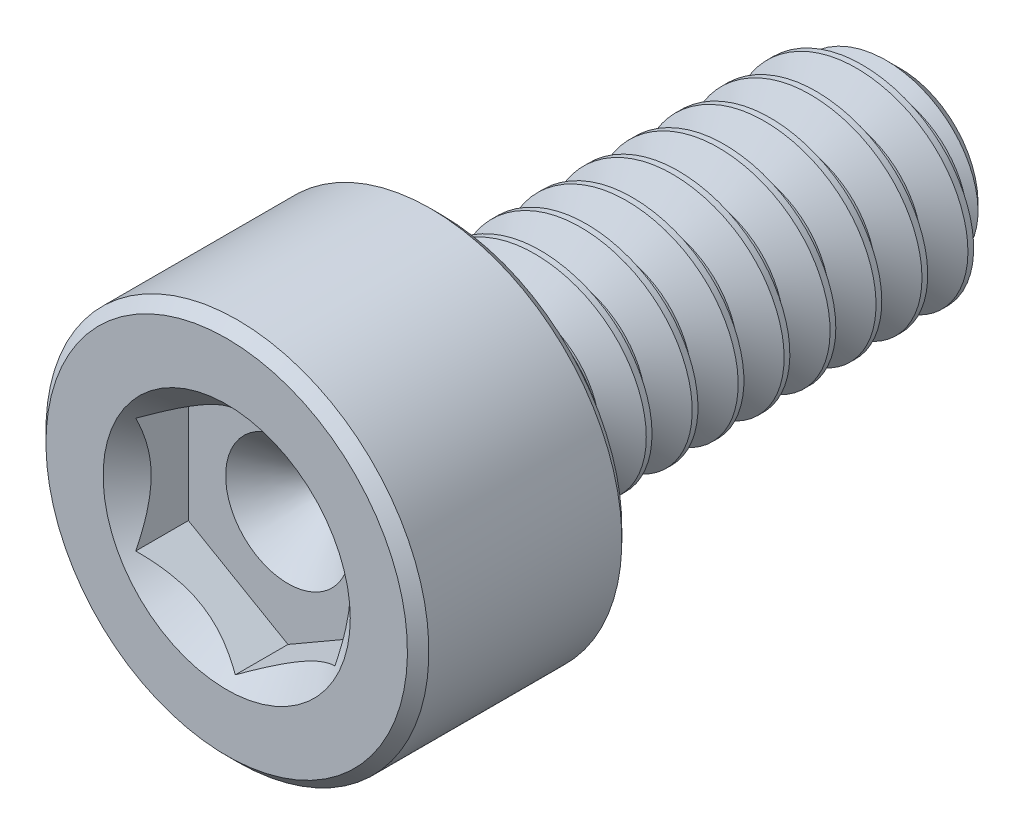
ISO-10303-21;
HEADER;
FILE_DESCRIPTION(('STEP AP214'),'2;1');
FILE_NAME('part.step','',(''),(''),'','','');
FILE_SCHEMA(('AUTOMOTIVE_DESIGN { 1 0 10303 214 1 1 1 1 }'));
ENDSEC;
DATA;
#1=APPLICATION_CONTEXT('core data for automotive mechanical design processes');
#2=APPLICATION_PROTOCOL_DEFINITION('international standard','automotive_design',2000,#1);
#3=PRODUCT_CONTEXT('',#1,'mechanical');
#4=PRODUCT('Part','Part','',(#3));
#5=PRODUCT_RELATED_PRODUCT_CATEGORY('part','',(#4));
#6=PRODUCT_DEFINITION_FORMATION('','',#4);
#7=PRODUCT_DEFINITION_CONTEXT('part definition',#1,'design');
#8=PRODUCT_DEFINITION('design','',#6,#7);
#9=PRODUCT_DEFINITION_SHAPE('','',#8);
#10=(LENGTH_UNIT() NAMED_UNIT(*) SI_UNIT(.MILLI.,.METRE.));
#11=(NAMED_UNIT(*) PLANE_ANGLE_UNIT() SI_UNIT($,.RADIAN.));
#12=(NAMED_UNIT(*) SI_UNIT($,.STERADIAN.) SOLID_ANGLE_UNIT());
#13=UNCERTAINTY_MEASURE_WITH_UNIT(LENGTH_MEASURE(1.E-05),#10,'distance_accuracy_value','');
#14=(GEOMETRIC_REPRESENTATION_CONTEXT(3) GLOBAL_UNCERTAINTY_ASSIGNED_CONTEXT((#13)) GLOBAL_UNIT_ASSIGNED_CONTEXT((#10,
#11,#12)) REPRESENTATION_CONTEXT('',''));
#15=CARTESIAN_POINT('',(0.,0.,0.));
#16=DIRECTION('',(0.,0.,1.));
#17=DIRECTION('',(1.,0.,0.));
#18=AXIS2_PLACEMENT_3D('',#15,#16,#17);
#19=CARTESIAN_POINT('',(0.,0.,0.729999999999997));
#20=DIRECTION('',(0.,0.,-1.));
#21=DIRECTION('',(0.,1.,0.));
#22=AXIS2_PLACEMENT_3D('',#19,#20,#21);
#23=TOROIDAL_SURFACE('',#22,0.770000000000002,0.0700000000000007);
#24=CARTESIAN_POINT('',(0.,0.,0.799999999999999));
#25=DIRECTION('',(0.,0.,-1.));
#26=DIRECTION('',(0.,1.,0.));
#27=AXIS2_PLACEMENT_3D('',#24,#25,#26);
#28=CIRCLE('',#27,0.770000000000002);
#29=CARTESIAN_POINT('',(0.,0.770000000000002,0.799999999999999));
#30=VERTEX_POINT('',#29);
#31=EDGE_CURVE('E173',#30,#30,#28,.T.);
#32=ORIENTED_EDGE('',*,*,#31,.T.);
#33=EDGE_LOOP('',(#32));
#34=FACE_BOUND('',#33,.T.);
#35=CARTESIAN_POINT('',(0.,0.,0.729999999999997));
#36=DIRECTION('',(0.,0.,-1.));
#37=DIRECTION('',(0.,1.,0.));
#38=AXIS2_PLACEMENT_3D('',#35,#36,#37);
#39=CIRCLE('',#38,0.700000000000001);
#40=CARTESIAN_POINT('',(0.696491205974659,0.0699999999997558,0.729999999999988));
#41=VERTEX_POINT('',#40);
#42=CARTESIAN_POINT('',(0.540038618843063,-0.445374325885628,0.729999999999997));
#43=VERTEX_POINT('',#42);
#44=EDGE_CURVE('E174',#41,#43,#39,.T.);
#45=ORIENTED_EDGE('',*,*,#44,.F.);
#46=EDGE_CURVE('E160',#43,#41,#39,.T.);
#47=ORIENTED_EDGE('',*,*,#46,.F.);
#48=EDGE_LOOP('',(#45,#47));
#49=FACE_BOUND('',#48,.T.);
#50=ADVANCED_FACE('F37',(#34,#49),#23,.F.);
#51=CARTESIAN_POINT('',(0.,1.18,0.799999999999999));
#52=DIRECTION('',(0.,0.,-1.));
#53=DIRECTION('',(0.,1.,0.));
#54=AXIS2_PLACEMENT_3D('',#51,#52,#53);
#55=PLANE('',#54);
#56=CARTESIAN_POINT('',(0.,0.,0.799999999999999));
#57=DIRECTION('',(0.,0.,-1.));
#58=DIRECTION('',(0.,1.,0.));
#59=AXIS2_PLACEMENT_3D('',#56,#57,#58);
#60=CIRCLE('',#59,1.18);
#61=CARTESIAN_POINT('',(0.,1.18,0.799999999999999));
#62=VERTEX_POINT('',#61);
#63=EDGE_CURVE('E550',#62,#62,#60,.T.);
#64=ORIENTED_EDGE('',*,*,#63,.T.);
#65=EDGE_LOOP('',(#64));
#66=FACE_BOUND('',#65,.T.);
#67=ORIENTED_EDGE('',*,*,#31,.F.);
#68=EDGE_LOOP('',(#67));
#69=FACE_BOUND('',#68,.T.);
#70=ADVANCED_FACE('F252',(#66,#69),#55,.T.);
#71=CARTESIAN_POINT('',(0.,0.,0.799999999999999));
#72=DIRECTION('',(0.,0.,1.));
#73=DIRECTION('',(0.,-1.,0.));
#74=AXIS2_PLACEMENT_3D('',#71,#72,#73);
#75=CONICAL_SURFACE('',#74,1.18,0.78539816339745);
#76=CARTESIAN_POINT('',(0.,0.,0.869999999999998));
#77=DIRECTION('',(0.,0.,-1.));
#78=DIRECTION('',(0.,1.,0.));
#79=AXIS2_PLACEMENT_3D('',#76,#77,#78);
#80=CIRCLE('',#79,1.25);
#81=CARTESIAN_POINT('',(0.,1.25,0.869999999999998));
#82=VERTEX_POINT('',#81);
#83=EDGE_CURVE('E548',#82,#82,#80,.T.);
#84=ORIENTED_EDGE('',*,*,#83,.T.);
#85=EDGE_LOOP('',(#84));
#86=FACE_BOUND('',#85,.T.);
#87=ORIENTED_EDGE('',*,*,#63,.F.);
#88=EDGE_LOOP('',(#87));
#89=FACE_BOUND('',#88,.T.);
#90=ADVANCED_FACE('F258',(#86,#89),#75,.T.);
#91=CARTESIAN_POINT('',(0.,0.,-2.2));
#92=DIRECTION('',(0.,0.,-1.));
#93=DIRECTION('',(0.,1.,0.));
#94=AXIS2_PLACEMENT_3D('',#91,#92,#93);
#95=CYLINDRICAL_SURFACE('',#94,1.25);
#96=CARTESIAN_POINT('',(0.,0.,2.13));
#97=DIRECTION('',(0.,0.,-1.));
#98=DIRECTION('',(0.,1.,0.));
#99=AXIS2_PLACEMENT_3D('',#96,#97,#98);
#100=CIRCLE('',#99,1.25);
#101=CARTESIAN_POINT('',(0.,1.25,2.13));
#102=VERTEX_POINT('',#101);
#103=EDGE_CURVE('E310',#102,#102,#100,.T.);
#104=ORIENTED_EDGE('',*,*,#103,.T.);
#105=EDGE_LOOP('',(#104));
#106=FACE_BOUND('',#105,.T.);
#107=ORIENTED_EDGE('',*,*,#83,.F.);
#108=EDGE_LOOP('',(#107));
#109=FACE_BOUND('',#108,.T.);
#110=ADVANCED_FACE('F269',(#106,#109),#95,.T.);
#111=CARTESIAN_POINT('',(0.,0.,2.13));
#112=DIRECTION('',(0.,0.,-1.));
#113=DIRECTION('',(0.,1.,0.));
#114=AXIS2_PLACEMENT_3D('',#111,#112,#113);
#115=CONICAL_SURFACE('',#114,1.25,0.785398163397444);
#116=CARTESIAN_POINT('',(0.,0.,2.2));
#117=DIRECTION('',(0.,0.,-1.));
#118=DIRECTION('',(0.,1.,0.));
#119=AXIS2_PLACEMENT_3D('',#116,#117,#118);
#120=CIRCLE('',#119,1.18);
#121=CARTESIAN_POINT('',(0.,1.18,2.2));
#122=VERTEX_POINT('',#121);
#123=EDGE_CURVE('E307',#122,#122,#120,.T.);
#124=ORIENTED_EDGE('',*,*,#123,.T.);
#125=EDGE_LOOP('',(#124));
#126=FACE_BOUND('',#125,.T.);
#127=ORIENTED_EDGE('',*,*,#103,.F.);
#128=EDGE_LOOP('',(#127));
#129=FACE_BOUND('',#128,.T.);
#130=ADVANCED_FACE('F273',(#126,#129),#115,.T.);
#131=CARTESIAN_POINT('',(0.,0.,2.2));
#132=DIRECTION('',(0.,0.,1.));
#133=DIRECTION('',(0.,-1.,0.));
#134=AXIS2_PLACEMENT_3D('',#131,#132,#133);
#135=PLANE('',#134);
#136=CARTESIAN_POINT('',(0.,0.,2.2));
#137=DIRECTION('',(0.,0.,1.));
#138=DIRECTION('',(1.,0.,0.));
#139=AXIS2_PLACEMENT_3D('',#136,#137,#138);
#140=CIRCLE('',#139,0.806847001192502);
#141=CARTESIAN_POINT('',(0.806847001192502,0.,2.2));
#142=VERTEX_POINT('',#141);
#143=EDGE_CURVE('E344',#142,#142,#140,.T.);
#144=ORIENTED_EDGE('',*,*,#143,.F.);
#145=EDGE_LOOP('',(#144));
#146=FACE_BOUND('',#145,.T.);
#147=ORIENTED_EDGE('',*,*,#123,.F.);
#148=EDGE_LOOP('',(#147));
#149=FACE_BOUND('',#148,.T.);
#150=ADVANCED_FACE('F277',(#146,#149),#135,.T.);
#151=CARTESIAN_POINT('',(0.,0.,2.2));
#152=DIRECTION('',(0.,0.,1.));
#153=DIRECTION('',(1.,0.,0.));
#154=AXIS2_PLACEMENT_3D('',#151,#152,#153);
#155=CONICAL_SURFACE('',#154,0.806847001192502,0.78539816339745);
#156=ORIENTED_EDGE('',*,*,#143,.T.);
#157=EDGE_LOOP('',(#156));
#158=FACE_BOUND('',#157,.T.);
#159=CARTESIAN_POINT('',(-0.000199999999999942,-0.750670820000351,2.14382384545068));
#160=CARTESIAN_POINT('',(0.0221538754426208,-0.737764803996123,2.13092571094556));
#161=CARTESIAN_POINT('',(0.0448801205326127,-0.724643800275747,2.11878350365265));
#162=CARTESIAN_POINT('',(0.0912219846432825,-0.697888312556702,2.09655059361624));
#163=CARTESIAN_POINT('',(0.114842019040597,-0.684251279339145,2.08647227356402));
#164=CARTESIAN_POINT('',(0.162473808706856,-0.656751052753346,2.06920986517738));
#165=CARTESIAN_POINT('',(0.186473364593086,-0.642894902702,2.06198230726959));
#166=CARTESIAN_POINT('',(0.234989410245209,-0.61488415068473,2.05083755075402));
#167=CARTESIAN_POINT('',(0.259504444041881,-0.600730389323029,2.04691205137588));
#168=CARTESIAN_POINT('',(0.31938440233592,-0.566158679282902,2.04193178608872));
#169=CARTESIAN_POINT('',(0.354889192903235,-0.545659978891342,2.04283283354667));
#170=CARTESIAN_POINT('',(0.425154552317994,-0.505092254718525,2.05211691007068));
#171=CARTESIAN_POINT('',(0.459913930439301,-0.485023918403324,2.06051111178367));
#172=CARTESIAN_POINT('',(0.520958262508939,-0.449779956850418,2.08075402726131));
#173=CARTESIAN_POINT('',(0.547523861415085,-0.434442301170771,2.09154677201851));
#174=CARTESIAN_POINT('',(0.599614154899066,-0.404367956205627,2.11586028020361));
#175=CARTESIAN_POINT('',(0.625141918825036,-0.38962949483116,2.1293721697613));
#176=CARTESIAN_POINT('',(0.6502,-0.375162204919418,2.14382384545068));
#177=B_SPLINE_CURVE_WITH_KNOTS('',3,(#159,#160,#161,#162,#163,#164,#165,#166,#167,#168,#169,
#170,#171,#172,#173,#174,#175,#176),.UNSPECIFIED.,.F.,.F.,(4,2,2,2,2,2,2,2,4),(0.,
0.0866236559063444,0.173752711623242,0.259496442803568,0.345023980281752,0.467267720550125,
0.589694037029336,0.68711130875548,0.784215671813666),.UNSPECIFIED.);
#178=CARTESIAN_POINT('',(0.,-0.750555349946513,2.14370834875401));
#179=VERTEX_POINT('',#178);
#180=CARTESIAN_POINT('',(0.65,-0.375277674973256,2.14370834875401));
#181=VERTEX_POINT('',#180);
#182=EDGE_CURVE('E161',#179,#181,#177,.T.);
#183=ORIENTED_EDGE('',*,*,#182,.F.);
#184=CARTESIAN_POINT('',(-0.6502,-0.375162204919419,2.14382384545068));
#185=CARTESIAN_POINT('',(-0.627846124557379,-0.388068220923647,2.13092571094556));
#186=CARTESIAN_POINT('',(-0.605119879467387,-0.401189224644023,2.11878350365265));
#187=CARTESIAN_POINT('',(-0.558778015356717,-0.427944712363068,2.09655059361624));
#188=CARTESIAN_POINT('',(-0.535157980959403,-0.441581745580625,2.08647227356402));
#189=CARTESIAN_POINT('',(-0.487526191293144,-0.469081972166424,2.06920986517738));
#190=CARTESIAN_POINT('',(-0.463526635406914,-0.48293812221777,2.06198230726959));
#191=CARTESIAN_POINT('',(-0.415010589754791,-0.51094887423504,2.05083755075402));
#192=CARTESIAN_POINT('',(-0.390495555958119,-0.525102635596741,2.04691205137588));
#193=CARTESIAN_POINT('',(-0.33061559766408,-0.559674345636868,2.04193178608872));
#194=CARTESIAN_POINT('',(-0.295110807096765,-0.580173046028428,2.04283283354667));
#195=CARTESIAN_POINT('',(-0.224845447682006,-0.620740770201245,2.05211691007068));
#196=CARTESIAN_POINT('',(-0.190086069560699,-0.640809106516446,2.06051111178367));
#197=CARTESIAN_POINT('',(-0.129041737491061,-0.676053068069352,2.08075402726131));
#198=CARTESIAN_POINT('',(-0.102476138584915,-0.691390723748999,2.09154677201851));
#199=CARTESIAN_POINT('',(-0.0503858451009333,-0.721465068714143,2.11586028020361));
#200=CARTESIAN_POINT('',(-0.0248580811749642,-0.73620353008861,2.1293721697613));
#201=CARTESIAN_POINT('',(0.000199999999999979,-0.750670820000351,2.14382384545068));
#202=B_SPLINE_CURVE_WITH_KNOTS('',3,(#184,#185,#186,#187,#188,#189,#190,#191,#192,#193,#194,
#195,#196,#197,#198,#199,#200,#201),.UNSPECIFIED.,.F.,.F.,(4,2,2,2,2,2,2,2,4),(0.,
0.0866236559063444,0.173752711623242,0.259496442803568,0.345023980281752,0.467267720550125,
0.589694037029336,0.687111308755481,0.784215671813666),.UNSPECIFIED.);
#203=CARTESIAN_POINT('',(-0.65,-0.375277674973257,2.14370834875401));
#204=VERTEX_POINT('',#203);
#205=EDGE_CURVE('E191',#204,#179,#202,.T.);
#206=ORIENTED_EDGE('',*,*,#205,.F.);
#207=CARTESIAN_POINT('',(-0.65,-0.78848754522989,2.41502021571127));
#208=CARTESIAN_POINT('',(-0.65,-0.76945809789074,2.40033897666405));
#209=CARTESIAN_POINT('',(-0.65,-0.750327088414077,2.38578977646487));
#210=CARTESIAN_POINT('',(-0.65,-0.711819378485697,2.35701112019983));
#211=CARTESIAN_POINT('',(-0.65,-0.6924426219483,2.34278173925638));
#212=CARTESIAN_POINT('',(-0.65,-0.633596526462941,2.30045364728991));
#213=CARTESIAN_POINT('',(-0.65,-0.593699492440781,2.27294004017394));
#214=CARTESIAN_POINT('',(-0.65,-0.50976682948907,2.21854434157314));
#215=CARTESIAN_POINT('',(-0.65,-0.465630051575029,2.19181664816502));
#216=CARTESIAN_POINT('',(-0.65,-0.375106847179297,2.14266199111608));
#217=CARTESIAN_POINT('',(-0.65,-0.328728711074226,2.12022050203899));
#218=CARTESIAN_POINT('',(-0.65,-0.259478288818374,2.09275695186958));
#219=CARTESIAN_POINT('',(-0.65,-0.237721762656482,2.08494661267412));
#220=CARTESIAN_POINT('',(-0.65,-0.193661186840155,2.0710641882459));
#221=CARTESIAN_POINT('',(-0.65,-0.171357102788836,2.06499221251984));
#222=CARTESIAN_POINT('',(-0.65,-0.104599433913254,2.05012127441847));
#223=CARTESIAN_POINT('',(-0.65,-0.0594095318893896,2.04428813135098));
#224=CARTESIAN_POINT('',(-0.65,0.0291554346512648,2.04236822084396));
#225=CARTESIAN_POINT('',(-0.65,0.0725208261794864,2.04585537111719));
#226=CARTESIAN_POINT('',(-0.65,0.136835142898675,2.05704753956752));
#227=CARTESIAN_POINT('',(-0.65,0.158350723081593,2.06184649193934));
#228=CARTESIAN_POINT('',(-0.65,0.200915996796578,2.07318949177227));
#229=CARTESIAN_POINT('',(-0.65,0.221965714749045,2.07973344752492));
#230=CARTESIAN_POINT('',(-0.65,0.286531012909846,2.10231535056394));
#231=CARTESIAN_POINT('',(-0.65,0.329166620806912,2.12085330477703));
#232=CARTESIAN_POINT('',(-0.65,0.412449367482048,2.16211372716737));
#233=CARTESIAN_POINT('',(-0.65,0.453088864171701,2.18485089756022));
#234=CARTESIAN_POINT('',(-0.65,0.530777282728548,2.2317895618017));
#235=CARTESIAN_POINT('',(-0.65,0.567904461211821,2.25586373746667));
#236=CARTESIAN_POINT('',(-0.65,0.640727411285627,2.30548887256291));
#237=CARTESIAN_POINT('',(-0.65,0.676432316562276,2.33102634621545));
#238=CARTESIAN_POINT('',(-0.65,0.711742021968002,2.35703925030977));
#239=B_SPLINE_CURVE_WITH_KNOTS('',3,(#207,#208,#209,#210,#211,#212,#213,#214,#215,#216,#217,
#218,#219,#220,#221,#222,#223,#224,#225,#226,#227,#228,#229,#230,#231,#232,#233,#234,#235,#236,
#237,#238),.UNSPECIFIED.,.F.,.F.,(4,2,2,2,2,2,2,2,2,2,2,2,2,2,2,4),(0.,0.0721019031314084,
0.144220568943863,0.289554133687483,0.444233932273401,0.598379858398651,0.667663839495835,
0.736952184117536,0.87266255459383,1.00227614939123,1.06834435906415,1.13440909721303,
1.27348228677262,1.41305195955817,1.54574594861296,1.67736907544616),.UNSPECIFIED.);
#240=CARTESIAN_POINT('',(-0.65,0.375277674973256,2.14370834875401));
#241=VERTEX_POINT('',#240);
#242=EDGE_CURVE('E199',#241,#204,#239,.F.);
#243=ORIENTED_EDGE('',*,*,#242,.F.);
#244=CARTESIAN_POINT('',(0.00019999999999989,0.750670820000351,2.14382384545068));
#245=CARTESIAN_POINT('',(-0.0221538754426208,0.737764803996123,2.13092571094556));
#246=CARTESIAN_POINT('',(-0.0448801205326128,0.724643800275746,2.11878350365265));
#247=CARTESIAN_POINT('',(-0.0912219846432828,0.697888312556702,2.09655059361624));
#248=CARTESIAN_POINT('',(-0.114842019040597,0.684251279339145,2.08647227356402));
#249=CARTESIAN_POINT('',(-0.162473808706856,0.656751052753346,2.06920986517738));
#250=CARTESIAN_POINT('',(-0.186473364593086,0.642894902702,2.06198230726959));
#251=CARTESIAN_POINT('',(-0.23498941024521,0.61488415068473,2.05083755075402));
#252=CARTESIAN_POINT('',(-0.259504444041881,0.600730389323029,2.04691205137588));
#253=CARTESIAN_POINT('',(-0.31938440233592,0.566158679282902,2.04193178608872));
#254=CARTESIAN_POINT('',(-0.354889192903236,0.545659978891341,2.04283283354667));
#255=CARTESIAN_POINT('',(-0.425154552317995,0.505092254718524,2.05211691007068));
#256=CARTESIAN_POINT('',(-0.459913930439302,0.485023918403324,2.06051111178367));
#257=CARTESIAN_POINT('',(-0.52095826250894,0.449779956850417,2.08075402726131));
#258=CARTESIAN_POINT('',(-0.547523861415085,0.43444230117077,2.09154677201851));
#259=CARTESIAN_POINT('',(-0.599614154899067,0.404367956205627,2.11586028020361));
#260=CARTESIAN_POINT('',(-0.625141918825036,0.389629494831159,2.1293721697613));
#261=CARTESIAN_POINT('',(-0.6502,0.375162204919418,2.14382384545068));
#262=B_SPLINE_CURVE_WITH_KNOTS('',3,(#244,#245,#246,#247,#248,#249,#250,#251,#252,#253,#254,
#255,#256,#257,#258,#259,#260,#261),.UNSPECIFIED.,.F.,.F.,(4,2,2,2,2,2,2,2,4),(0.,
0.0866236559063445,0.173752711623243,0.259496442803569,0.345023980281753,0.467267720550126,
0.589694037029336,0.687111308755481,0.784215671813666),.UNSPECIFIED.);
#263=CARTESIAN_POINT('',(0.,0.750555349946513,2.14370834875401));
#264=VERTEX_POINT('',#263);
#265=EDGE_CURVE('E206',#264,#241,#262,.T.);
#266=ORIENTED_EDGE('',*,*,#265,.F.);
#267=CARTESIAN_POINT('',(0.6502,0.375162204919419,2.14382384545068));
#268=CARTESIAN_POINT('',(0.627846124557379,0.388068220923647,2.13092571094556));
#269=CARTESIAN_POINT('',(0.605119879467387,0.401189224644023,2.11878350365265));
#270=CARTESIAN_POINT('',(0.558778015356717,0.427944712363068,2.09655059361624));
#271=CARTESIAN_POINT('',(0.535157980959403,0.441581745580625,2.08647227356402));
#272=CARTESIAN_POINT('',(0.487526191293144,0.469081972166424,2.06920986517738));
#273=CARTESIAN_POINT('',(0.463526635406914,0.48293812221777,2.06198230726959));
#274=CARTESIAN_POINT('',(0.41501058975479,0.51094887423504,2.05083755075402));
#275=CARTESIAN_POINT('',(0.390495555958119,0.525102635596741,2.04691205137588));
#276=CARTESIAN_POINT('',(0.33061559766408,0.559674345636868,2.04193178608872));
#277=CARTESIAN_POINT('',(0.295110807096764,0.580173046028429,2.04283283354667));
#278=CARTESIAN_POINT('',(0.224845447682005,0.620740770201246,2.05211691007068));
#279=CARTESIAN_POINT('',(0.190086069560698,0.640809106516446,2.06051111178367));
#280=CARTESIAN_POINT('',(0.12904173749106,0.676053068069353,2.08075402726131));
#281=CARTESIAN_POINT('',(0.102476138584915,0.691390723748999,2.09154677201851));
#282=CARTESIAN_POINT('',(0.0503858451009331,0.721465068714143,2.11586028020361));
#283=CARTESIAN_POINT('',(0.0248580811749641,0.73620353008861,2.1293721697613));
#284=CARTESIAN_POINT('',(-0.000200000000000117,0.750670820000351,2.14382384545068));
#285=B_SPLINE_CURVE_WITH_KNOTS('',3,(#267,#268,#269,#270,#271,#272,#273,#274,#275,#276,#277,
#278,#279,#280,#281,#282,#283,#284),.UNSPECIFIED.,.F.,.F.,(4,2,2,2,2,2,2,2,4),(0.,
0.0866236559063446,0.173752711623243,0.259496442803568,0.345023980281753,0.467267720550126,
0.589694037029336,0.687111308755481,0.784215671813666),.UNSPECIFIED.);
#286=CARTESIAN_POINT('',(0.65,0.375277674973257,2.14370834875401));
#287=VERTEX_POINT('',#286);
#288=EDGE_CURVE('E213',#287,#264,#285,.T.);
#289=ORIENTED_EDGE('',*,*,#288,.F.);
#290=CARTESIAN_POINT('',(0.65,-0.78848754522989,2.41502021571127));
#291=CARTESIAN_POINT('',(0.65,-0.769458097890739,2.40033897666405));
#292=CARTESIAN_POINT('',(0.65,-0.750327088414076,2.38578977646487));
#293=CARTESIAN_POINT('',(0.65,-0.711819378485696,2.35701112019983));
#294=CARTESIAN_POINT('',(0.65,-0.692442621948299,2.34278173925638));
#295=CARTESIAN_POINT('',(0.65,-0.633596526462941,2.30045364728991));
#296=CARTESIAN_POINT('',(0.65,-0.59369949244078,2.27294004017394));
#297=CARTESIAN_POINT('',(0.65,-0.509766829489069,2.21854434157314));
#298=CARTESIAN_POINT('',(0.65,-0.465630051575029,2.19181664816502));
#299=CARTESIAN_POINT('',(0.65,-0.375106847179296,2.14266199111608));
#300=CARTESIAN_POINT('',(0.65,-0.328728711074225,2.12022050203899));
#301=CARTESIAN_POINT('',(0.65,-0.259478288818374,2.09275695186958));
#302=CARTESIAN_POINT('',(0.65,-0.237721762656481,2.08494661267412));
#303=CARTESIAN_POINT('',(0.65,-0.193661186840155,2.0710641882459));
#304=CARTESIAN_POINT('',(0.65,-0.171357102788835,2.06499221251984));
#305=CARTESIAN_POINT('',(0.65,-0.104599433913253,2.05012127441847));
#306=CARTESIAN_POINT('',(0.65,-0.0594095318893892,2.04428813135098));
#307=CARTESIAN_POINT('',(0.65,0.0291554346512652,2.04236822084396));
#308=CARTESIAN_POINT('',(0.65,0.0725208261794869,2.04585537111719));
#309=CARTESIAN_POINT('',(0.65,0.136835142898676,2.05704753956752));
#310=CARTESIAN_POINT('',(0.65,0.158350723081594,2.06184649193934));
#311=CARTESIAN_POINT('',(0.65,0.200915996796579,2.07318949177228));
#312=CARTESIAN_POINT('',(0.65,0.221965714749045,2.07973344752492));
#313=CARTESIAN_POINT('',(0.65,0.286531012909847,2.10231535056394));
#314=CARTESIAN_POINT('',(0.65,0.329166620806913,2.12085330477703));
#315=CARTESIAN_POINT('',(0.65,0.412449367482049,2.16211372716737));
#316=CARTESIAN_POINT('',(0.65,0.453088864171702,2.18485089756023));
#317=CARTESIAN_POINT('',(0.65,0.530777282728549,2.2317895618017));
#318=CARTESIAN_POINT('',(0.65,0.567904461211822,2.25586373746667));
#319=CARTESIAN_POINT('',(0.65,0.640727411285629,2.30548887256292));
#320=CARTESIAN_POINT('',(0.65,0.676432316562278,2.33102634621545));
#321=CARTESIAN_POINT('',(0.65,0.711742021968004,2.35703925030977));
#322=B_SPLINE_CURVE_WITH_KNOTS('',3,(#290,#291,#292,#293,#294,#295,#296,#297,#298,#299,#300,
#301,#302,#303,#304,#305,#306,#307,#308,#309,#310,#311,#312,#313,#314,#315,#316,#317,#318,#319,
#320,#321),.UNSPECIFIED.,.F.,.F.,(4,2,2,2,2,2,2,2,2,2,2,2,2,2,2,4),(0.,0.0721019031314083,
0.144220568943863,0.289554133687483,0.444233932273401,0.598379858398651,0.667663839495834,
0.736952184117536,0.87266255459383,1.00227614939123,1.06834435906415,1.13440909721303,
1.27348228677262,1.41305195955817,1.54574594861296,1.67736907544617),.UNSPECIFIED.);
#323=EDGE_CURVE('E220',#181,#287,#322,.T.);
#324=ORIENTED_EDGE('',*,*,#323,.F.);
#325=EDGE_LOOP('',(#183,#206,#243,#266,#289,#324));
#326=FACE_BOUND('',#325,.T.);
#327=ADVANCED_FACE('F184',(#158,#326),#155,.F.);
#328=CARTESIAN_POINT('',(0.,-0.750555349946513,-1.18578280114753));
#329=DIRECTION('',(0.5,-0.866025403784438,0.));
#330=DIRECTION('',(0.866025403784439,0.5,0.));
#331=AXIS2_PLACEMENT_3D('',#328,#329,#330);
#332=PLANE('',#331);
#333=DIRECTION('',(0.,0.,1.));
#334=VECTOR('',#333,1.);
#335=CARTESIAN_POINT('',(0.,-0.750555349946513,-1.18578280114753));
#336=LINE('',#335,#334);
#337=CARTESIAN_POINT('',(0.,-0.750555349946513,1.8));
#338=VERTEX_POINT('',#337);
#339=EDGE_CURVE('E302',#338,#179,#336,.T.);
#340=ORIENTED_EDGE('',*,*,#339,.T.);
#341=ORIENTED_EDGE('',*,*,#182,.T.);
#342=DIRECTION('',(0.,0.,1.));
#343=VECTOR('',#342,1.);
#344=CARTESIAN_POINT('',(0.65,-0.375277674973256,-1.18578280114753));
#345=LINE('',#344,#343);
#346=CARTESIAN_POINT('',(0.65,-0.375277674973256,1.8));
#347=VERTEX_POINT('',#346);
#348=EDGE_CURVE('E303',#347,#181,#345,.T.);
#349=ORIENTED_EDGE('',*,*,#348,.F.);
#350=DIRECTION('',(0.866025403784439,0.5,0.));
#351=VECTOR('',#350,1.);
#352=CARTESIAN_POINT('',(0.,-0.750555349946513,1.8));
#353=LINE('',#352,#351);
#354=EDGE_CURVE('E294',#338,#347,#353,.T.);
#355=ORIENTED_EDGE('',*,*,#354,.F.);
#356=EDGE_LOOP('',(#340,#341,#349,#355));
#357=FACE_BOUND('',#356,.T.);
#358=ADVANCED_FACE('F176',(#357),#332,.F.);
#359=CARTESIAN_POINT('',(-0.65,-0.375277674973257,-1.18578280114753));
#360=DIRECTION('',(-0.5,-0.866025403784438,0.));
#361=DIRECTION('',(0.866025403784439,-0.5,0.));
#362=AXIS2_PLACEMENT_3D('',#359,#360,#361);
#363=PLANE('',#362);
#364=DIRECTION('',(0.,0.,1.));
#365=VECTOR('',#364,1.);
#366=CARTESIAN_POINT('',(-0.65,-0.375277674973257,-1.18578280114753));
#367=LINE('',#366,#365);
#368=CARTESIAN_POINT('',(-0.65,-0.375277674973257,1.8));
#369=VERTEX_POINT('',#368);
#370=EDGE_CURVE('E326',#369,#204,#367,.T.);
#371=ORIENTED_EDGE('',*,*,#370,.T.);
#372=ORIENTED_EDGE('',*,*,#205,.T.);
#373=ORIENTED_EDGE('',*,*,#339,.F.);
#374=DIRECTION('',(0.866025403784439,-0.5,0.));
#375=VECTOR('',#374,1.);
#376=CARTESIAN_POINT('',(-0.65,-0.375277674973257,1.8));
#377=LINE('',#376,#375);
#378=EDGE_CURVE('E299',#369,#338,#377,.T.);
#379=ORIENTED_EDGE('',*,*,#378,.F.);
#380=EDGE_LOOP('',(#371,#372,#373,#379));
#381=FACE_BOUND('',#380,.T.);
#382=ADVANCED_FACE('F241',(#381),#363,.F.);
#383=CARTESIAN_POINT('',(-0.65,0.375277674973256,-1.18578280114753));
#384=DIRECTION('',(-1.,0.,0.));
#385=DIRECTION('',(0.,-1.,0.));
#386=AXIS2_PLACEMENT_3D('',#383,#384,#385);
#387=PLANE('',#386);
#388=DIRECTION('',(0.,0.,1.));
#389=VECTOR('',#388,1.);
#390=CARTESIAN_POINT('',(-0.65,0.375277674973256,-1.18578280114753));
#391=LINE('',#390,#389);
#392=CARTESIAN_POINT('',(-0.65,0.375277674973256,1.8));
#393=VERTEX_POINT('',#392);
#394=EDGE_CURVE('E322',#393,#241,#391,.T.);
#395=ORIENTED_EDGE('',*,*,#394,.T.);
#396=ORIENTED_EDGE('',*,*,#242,.T.);
#397=ORIENTED_EDGE('',*,*,#370,.F.);
#398=DIRECTION('',(0.,-1.,0.));
#399=VECTOR('',#398,1.);
#400=CARTESIAN_POINT('',(-0.65,0.375277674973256,1.8));
#401=LINE('',#400,#399);
#402=EDGE_CURVE('E325',#393,#369,#401,.T.);
#403=ORIENTED_EDGE('',*,*,#402,.F.);
#404=EDGE_LOOP('',(#395,#396,#397,#403));
#405=FACE_BOUND('',#404,.T.);
#406=ADVANCED_FACE('F237',(#405),#387,.F.);
#407=CARTESIAN_POINT('',(0.,0.750555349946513,-1.18578280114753));
#408=DIRECTION('',(-0.5,0.866025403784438,0.));
#409=DIRECTION('',(-0.866025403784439,-0.5,0.));
#410=AXIS2_PLACEMENT_3D('',#407,#408,#409);
#411=PLANE('',#410);
#412=DIRECTION('',(0.,0.,1.));
#413=VECTOR('',#412,1.);
#414=CARTESIAN_POINT('',(0.,0.750555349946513,-1.18578280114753));
#415=LINE('',#414,#413);
#416=CARTESIAN_POINT('',(0.,0.750555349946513,1.8));
#417=VERTEX_POINT('',#416);
#418=EDGE_CURVE('E318',#417,#264,#415,.T.);
#419=ORIENTED_EDGE('',*,*,#418,.T.);
#420=ORIENTED_EDGE('',*,*,#265,.T.);
#421=ORIENTED_EDGE('',*,*,#394,.F.);
#422=DIRECTION('',(-0.866025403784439,-0.5,0.));
#423=VECTOR('',#422,1.);
#424=CARTESIAN_POINT('',(0.,0.750555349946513,1.8));
#425=LINE('',#424,#423);
#426=EDGE_CURVE('E321',#417,#393,#425,.T.);
#427=ORIENTED_EDGE('',*,*,#426,.F.);
#428=EDGE_LOOP('',(#419,#420,#421,#427));
#429=FACE_BOUND('',#428,.T.);
#430=ADVANCED_FACE('F231',(#429),#411,.F.);
#431=CARTESIAN_POINT('',(0.65,0.375277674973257,-1.18578280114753));
#432=DIRECTION('',(0.5,0.866025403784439,0.));
#433=DIRECTION('',(-0.866025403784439,0.5,0.));
#434=AXIS2_PLACEMENT_3D('',#431,#432,#433);
#435=PLANE('',#434);
#436=DIRECTION('',(0.,0.,1.));
#437=VECTOR('',#436,1.);
#438=CARTESIAN_POINT('',(0.65,0.375277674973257,-1.18578280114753));
#439=LINE('',#438,#437);
#440=CARTESIAN_POINT('',(0.65,0.375277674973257,1.8));
#441=VERTEX_POINT('',#440);
#442=EDGE_CURVE('E314',#441,#287,#439,.T.);
#443=ORIENTED_EDGE('',*,*,#442,.T.);
#444=ORIENTED_EDGE('',*,*,#288,.T.);
#445=ORIENTED_EDGE('',*,*,#418,.F.);
#446=DIRECTION('',(-0.866025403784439,0.5,0.));
#447=VECTOR('',#446,1.);
#448=CARTESIAN_POINT('',(0.65,0.375277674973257,1.8));
#449=LINE('',#448,#447);
#450=EDGE_CURVE('E317',#441,#417,#449,.T.);
#451=ORIENTED_EDGE('',*,*,#450,.F.);
#452=EDGE_LOOP('',(#443,#444,#445,#451));
#453=FACE_BOUND('',#452,.T.);
#454=ADVANCED_FACE('F227',(#453),#435,.F.);
#455=CARTESIAN_POINT('',(0.65,-0.375277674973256,-1.18578280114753));
#456=DIRECTION('',(1.,0.,0.));
#457=DIRECTION('',(0.,0.,-1.));
#458=AXIS2_PLACEMENT_3D('',#455,#456,#457);
#459=PLANE('',#458);
#460=ORIENTED_EDGE('',*,*,#348,.T.);
#461=ORIENTED_EDGE('',*,*,#323,.T.);
#462=ORIENTED_EDGE('',*,*,#442,.F.);
#463=DIRECTION('',(0.,1.,0.));
#464=VECTOR('',#463,1.);
#465=CARTESIAN_POINT('',(0.65,-0.375277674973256,1.8));
#466=LINE('',#465,#464);
#467=EDGE_CURVE('E297',#347,#441,#466,.T.);
#468=ORIENTED_EDGE('',*,*,#467,.F.);
#469=EDGE_LOOP('',(#460,#461,#462,#468));
#470=FACE_BOUND('',#469,.T.);
#471=ADVANCED_FACE('F230',(#470),#459,.F.);
#472=CARTESIAN_POINT('',(0.,1.18,1.8));
#473=DIRECTION('',(0.,0.,-1.));
#474=DIRECTION('',(0.,1.,0.));
#475=AXIS2_PLACEMENT_3D('',#472,#473,#474);
#476=PLANE('',#475);
#477=CARTESIAN_POINT('',(0.,0.,1.8));
#478=DIRECTION('',(0.,0.,-1.));
#479=DIRECTION('',(0.,1.,0.));
#480=AXIS2_PLACEMENT_3D('',#477,#478,#479);
#481=CIRCLE('',#480,0.4068470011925);
#482=CARTESIAN_POINT('',(0.4068470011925,0.,1.8));
#483=VERTEX_POINT('',#482);
#484=EDGE_CURVE('E290',#483,#483,#481,.T.);
#485=ORIENTED_EDGE('',*,*,#484,.T.);
#486=EDGE_LOOP('',(#485));
#487=FACE_BOUND('',#486,.T.);
#488=ORIENTED_EDGE('',*,*,#354,.T.);
#489=ORIENTED_EDGE('',*,*,#467,.T.);
#490=ORIENTED_EDGE('',*,*,#450,.T.);
#491=ORIENTED_EDGE('',*,*,#426,.T.);
#492=ORIENTED_EDGE('',*,*,#402,.T.);
#493=ORIENTED_EDGE('',*,*,#378,.T.);
#494=EDGE_LOOP('',(#488,#489,#490,#491,#492,#493));
#495=FACE_BOUND('',#494,.T.);
#496=ADVANCED_FACE('F182',(#487,#495),#476,.F.);
#497=CARTESIAN_POINT('',(0.,0.,1.5));
#498=DIRECTION('',(0.,0.,1.));
#499=DIRECTION('',(1.,0.,0.));
#500=AXIS2_PLACEMENT_3D('',#497,#498,#499);
#501=CIRCLE('',#500,0.106847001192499);
#502=CARTESIAN_POINT('',(0.106847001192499,0.,1.5));
#503=VERTEX_POINT('',#502);
#504=EDGE_CURVE('E342',#503,#503,#501,.T.);
#505=CARTESIAN_POINT('',(0.106847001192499,0.,1.5));
#506=CARTESIAN_POINT('',(0.109972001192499,0.,1.503125));
#507=CARTESIAN_POINT('',(0.113097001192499,0.,1.50625));
#508=CARTESIAN_POINT('',(0.119347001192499,0.,1.5125));
#509=CARTESIAN_POINT('',(0.122472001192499,0.,1.515625));
#510=CARTESIAN_POINT('',(0.128722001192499,0.,1.521875));
#511=CARTESIAN_POINT('',(0.131847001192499,0.,1.525));
#512=CARTESIAN_POINT('',(0.138097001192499,0.,1.53125));
#513=CARTESIAN_POINT('',(0.141222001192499,0.,1.534375));
#514=CARTESIAN_POINT('',(0.147472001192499,0.,1.540625));
#515=CARTESIAN_POINT('',(0.150597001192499,0.,1.54375));
#516=CARTESIAN_POINT('',(0.156847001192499,0.,1.55));
#517=CARTESIAN_POINT('',(0.159972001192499,0.,1.553125));
#518=CARTESIAN_POINT('',(0.166222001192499,0.,1.559375));
#519=CARTESIAN_POINT('',(0.169347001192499,0.,1.5625));
#520=CARTESIAN_POINT('',(0.175597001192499,0.,1.56875));
#521=CARTESIAN_POINT('',(0.1787220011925,0.,1.571875));
#522=CARTESIAN_POINT('',(0.1849720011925,0.,1.578125));
#523=CARTESIAN_POINT('',(0.1880970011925,0.,1.58125));
#524=CARTESIAN_POINT('',(0.1943470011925,0.,1.5875));
#525=CARTESIAN_POINT('',(0.1974720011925,0.,1.590625));
#526=CARTESIAN_POINT('',(0.2037220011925,0.,1.596875));
#527=CARTESIAN_POINT('',(0.206847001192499,0.,1.6));
#528=CARTESIAN_POINT('',(0.2130970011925,0.,1.60625));
#529=CARTESIAN_POINT('',(0.2162220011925,0.,1.609375));
#530=CARTESIAN_POINT('',(0.2224720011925,0.,1.615625));
#531=CARTESIAN_POINT('',(0.2255970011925,0.,1.61875));
#532=CARTESIAN_POINT('',(0.2318470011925,0.,1.625));
#533=CARTESIAN_POINT('',(0.2349720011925,0.,1.628125));
#534=CARTESIAN_POINT('',(0.2412220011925,0.,1.634375));
#535=CARTESIAN_POINT('',(0.2443470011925,0.,1.6375));
#536=CARTESIAN_POINT('',(0.2505970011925,0.,1.64375));
#537=CARTESIAN_POINT('',(0.2537220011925,0.,1.646875));
#538=CARTESIAN_POINT('',(0.2599720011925,0.,1.653125));
#539=CARTESIAN_POINT('',(0.2630970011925,0.,1.65625));
#540=CARTESIAN_POINT('',(0.2693470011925,0.,1.6625));
#541=CARTESIAN_POINT('',(0.2724720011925,0.,1.665625));
#542=CARTESIAN_POINT('',(0.2787220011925,0.,1.671875));
#543=CARTESIAN_POINT('',(0.2818470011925,0.,1.675));
#544=CARTESIAN_POINT('',(0.2880970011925,0.,1.68125));
#545=CARTESIAN_POINT('',(0.2912220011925,0.,1.684375));
#546=CARTESIAN_POINT('',(0.2974720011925,0.,1.690625));
#547=CARTESIAN_POINT('',(0.3005970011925,0.,1.69375));
#548=CARTESIAN_POINT('',(0.3068470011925,0.,1.7));
#549=CARTESIAN_POINT('',(0.3099720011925,0.,1.703125));
#550=CARTESIAN_POINT('',(0.3162220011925,0.,1.709375));
#551=CARTESIAN_POINT('',(0.3193470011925,0.,1.7125));
#552=CARTESIAN_POINT('',(0.3255970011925,0.,1.71875));
#553=CARTESIAN_POINT('',(0.3287220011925,0.,1.721875));
#554=CARTESIAN_POINT('',(0.3349720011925,0.,1.728125));
#555=CARTESIAN_POINT('',(0.3380970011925,0.,1.73125));
#556=CARTESIAN_POINT('',(0.3443470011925,0.,1.7375));
#557=CARTESIAN_POINT('',(0.3474720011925,0.,1.740625));
#558=CARTESIAN_POINT('',(0.3537220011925,0.,1.746875));
#559=CARTESIAN_POINT('',(0.3568470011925,0.,1.75));
#560=CARTESIAN_POINT('',(0.3630970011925,0.,1.75625));
#561=CARTESIAN_POINT('',(0.3662220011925,0.,1.759375));
#562=CARTESIAN_POINT('',(0.3724720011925,0.,1.765625));
#563=CARTESIAN_POINT('',(0.3755970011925,0.,1.76875));
#564=CARTESIAN_POINT('',(0.3818470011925,0.,1.775));
#565=CARTESIAN_POINT('',(0.3849720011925,0.,1.778125));
#566=CARTESIAN_POINT('',(0.3912220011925,0.,1.784375));
#567=CARTESIAN_POINT('',(0.3943470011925,0.,1.7875));
#568=CARTESIAN_POINT('',(0.4005970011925,0.,1.79375));
#569=CARTESIAN_POINT('',(0.4037220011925,0.,1.796875));
#570=CARTESIAN_POINT('',(0.4068470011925,0.,1.8));
#571=B_SPLINE_CURVE_WITH_KNOTS('',3,(#505,#506,#507,#508,#509,#510,#511,#512,#513,#514,#515,
#516,#517,#518,#519,#520,#521,#522,#523,#524,#525,#526,#527,#528,#529,#530,#531,#532,#533,#534,
#535,#536,#537,#538,#539,#540,#541,#542,#543,#544,#545,#546,#547,#548,#549,#550,#551,#552,#553,
#554,#555,#556,#557,#558,#559,#560,#561,#562,#563,#564,#565,#566,#567,#568,#569,#570),
.UNSPECIFIED.,.F.,.F.,(4,2,2,2,2,2,2,2,2,2,2,2,2,2,2,2,2,2,2,2,2,2,2,2,2,2,2,2,2,2,2,2,4),(0.,
0.0132582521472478,0.0265165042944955,0.0397747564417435,0.0530330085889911,0.066291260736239,
0.0795495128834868,0.0928077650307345,0.106066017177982,0.11932426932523,0.132582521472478,
0.145840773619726,0.159099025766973,0.172357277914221,0.185615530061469,0.198873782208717,
0.212132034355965,0.225390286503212,0.23864853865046,0.251906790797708,0.265165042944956,
0.278423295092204,0.291681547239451,0.304939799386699,0.318198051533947,0.331456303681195,
0.344714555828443,0.35797280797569,0.371231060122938,0.384489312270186,0.397747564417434,
0.411005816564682,0.424264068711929),.UNSPECIFIED.);
#572=EDGE_CURVE('BSEAM179',#503,#483,#571,.T.);
#573=ORIENTED_EDGE('',*,*,#504,.F.);
#574=ORIENTED_EDGE('',*,*,#484,.F.);
#575=ORIENTED_EDGE('',*,*,#572,.T.);
#576=ORIENTED_EDGE('',*,*,#572,.F.);
#577=EDGE_LOOP('',(#573,#575,#574,#576));
#578=FACE_BOUND('',#577,.T.);
#579=ADVANCED_FACE('F179',(#578),#155,.F.);
#580=CARTESIAN_POINT('',(0.,0.,1.5));
#581=DIRECTION('',(0.,0.,1.));
#582=DIRECTION('',(1.,0.,0.));
#583=AXIS2_PLACEMENT_3D('',#580,#581,#582);
#584=PLANE('',#583);
#585=ORIENTED_EDGE('',*,*,#504,.T.);
#586=EDGE_LOOP('',(#585));
#587=FACE_BOUND('',#586,.T.);
#588=ADVANCED_FACE('F39',(#587),#584,.T.);
#589=CARTESIAN_POINT('',(0.,0.,0.325854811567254));
#590=DIRECTION('',(0.,0.,1.));
#591=DIRECTION('',(0.,-1.,0.));
#592=AXIS2_PLACEMENT_3D('',#589,#590,#591);
#593=CONICAL_SURFACE('',#592,0.,1.04719755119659);
#594=CARTESIAN_POINT('',(0.540038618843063,-0.445374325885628,0.729999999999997));
#595=CARTESIAN_POINT('',(0.513883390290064,-0.473638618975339,0.728714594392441));
#596=CARTESIAN_POINT('',(0.485304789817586,-0.499641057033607,0.72738247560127));
#597=CARTESIAN_POINT('',(0.424244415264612,-0.546462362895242,0.724662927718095));
#598=CARTESIAN_POINT('',(0.391768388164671,-0.56728872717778,0.723275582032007));
#599=CARTESIAN_POINT('',(0.323760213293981,-0.603191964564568,0.720479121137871));
#600=CARTESIAN_POINT('',(0.288226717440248,-0.618266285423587,0.719069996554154));
#601=CARTESIAN_POINT('',(0.215124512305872,-0.642238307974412,0.716270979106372));
#602=CARTESIAN_POINT('',(0.177555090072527,-0.651133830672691,0.714881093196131));
#603=CARTESIAN_POINT('',(0.10142433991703,-0.662481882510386,0.712159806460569));
#604=CARTESIAN_POINT('',(0.0628627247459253,-0.664932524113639,0.710828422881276));
#605=CARTESIAN_POINT('',(0.00515893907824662,-0.663739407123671,0.708915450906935));
#606=CARTESIAN_POINT('',(-0.0140581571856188,-0.662529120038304,0.708291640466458));
#607=CARTESIAN_POINT('',(-0.0523016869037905,-0.658375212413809,0.707004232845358));
#608=CARTESIAN_POINT('',(-0.0713281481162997,-0.65543184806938,0.706340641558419));
#609=CARTESIAN_POINT('',(-0.127008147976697,-0.644228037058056,0.704342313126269));
#610=CARTESIAN_POINT('',(-0.163206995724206,-0.633573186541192,0.702969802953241));
#611=CARTESIAN_POINT('',(-0.233155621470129,-0.606093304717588,0.700155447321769));
#612=CARTESIAN_POINT('',(-0.266905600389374,-0.589268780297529,0.698713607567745));
#613=CARTESIAN_POINT('',(-0.329626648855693,-0.550775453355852,0.69586190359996));
#614=CARTESIAN_POINT('',(-0.358736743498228,-0.52933300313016,0.694453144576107));
#615=CARTESIAN_POINT('',(-0.412949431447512,-0.481858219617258,0.691651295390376));
#616=CARTESIAN_POINT('',(-0.438050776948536,-0.455824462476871,0.690258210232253));
#617=CARTESIAN_POINT('',(-0.483523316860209,-0.399881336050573,0.687521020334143));
#618=CARTESIAN_POINT('',(-0.503893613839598,-0.369971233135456,0.686176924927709));
#619=CARTESIAN_POINT('',(-0.530479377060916,-0.322906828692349,0.684255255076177));
#620=CARTESIAN_POINT('',(-0.538681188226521,-0.306848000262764,0.683630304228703));
#621=CARTESIAN_POINT('',(-0.553602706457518,-0.27405842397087,0.68234733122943));
#622=CARTESIAN_POINT('',(-0.560322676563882,-0.2573277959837,0.681689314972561));
#623=CARTESIAN_POINT('',(-0.577909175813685,-0.207066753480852,0.679701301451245));
#624=CARTESIAN_POINT('',(-0.586607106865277,-0.172750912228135,0.678329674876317));
#625=CARTESIAN_POINT('',(-0.597815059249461,-0.10314547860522,0.675513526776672));
#626=CARTESIAN_POINT('',(-0.600325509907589,-0.0678559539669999,0.674069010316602));
#627=CARTESIAN_POINT('',(-0.599118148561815,0.000963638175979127,0.671215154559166));
#628=CARTESIAN_POINT('',(-0.595685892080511,0.0344988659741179,0.669807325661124));
#629=CARTESIAN_POINT('',(-0.583236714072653,0.100525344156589,0.667003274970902));
#630=CARTESIAN_POINT('',(-0.574218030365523,0.133016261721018,0.665607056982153));
#631=CARTESIAN_POINT('',(-0.550825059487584,0.196026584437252,0.662857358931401));
#632=CARTESIAN_POINT('',(-0.536450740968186,0.226545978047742,0.661503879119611));
#633=CARTESIAN_POINT('',(-0.511252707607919,0.270184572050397,0.659569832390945));
#634=CARTESIAN_POINT('',(-0.502244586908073,0.284377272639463,0.658941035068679));
#635=CARTESIAN_POINT('',(-0.482995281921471,0.311897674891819,0.657659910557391));
#636=CARTESIAN_POINT('',(-0.472754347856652,0.325225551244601,0.657007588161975));
#637=CARTESIAN_POINT('',(-0.440707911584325,0.363207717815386,0.655029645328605));
#638=CARTESIAN_POINT('',(-0.417224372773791,0.386477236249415,0.65365783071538));
#639=CARTESIAN_POINT('',(-0.366521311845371,0.428466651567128,0.650838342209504));
#640=CARTESIAN_POINT('',(-0.339302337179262,0.447187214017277,0.649390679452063));
#641=CARTESIAN_POINT('',(-0.283501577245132,0.478642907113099,0.646535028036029));
#642=CARTESIAN_POINT('',(-0.255068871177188,0.491643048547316,0.645129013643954));
#643=CARTESIAN_POINT('',(-0.196408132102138,0.512684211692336,0.642322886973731));
#644=CARTESIAN_POINT('',(-0.166179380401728,0.520723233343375,0.640922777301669));
#645=CARTESIAN_POINT('',(-0.10481049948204,0.531596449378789,0.638165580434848));
#646=CARTESIAN_POINT('',(-0.0736705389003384,0.534431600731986,0.63680848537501));
#647=CARTESIAN_POINT('',(-0.011352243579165,0.534854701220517,0.634202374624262));
#648=CARTESIAN_POINT('',(0.0198260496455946,0.532446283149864,0.632953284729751));
#649=CARTESIAN_POINT('',(0.0806537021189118,0.522047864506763,0.630326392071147));
#650=CARTESIAN_POINT('',(0.110320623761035,0.514161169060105,0.62895137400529));
#651=CARTESIAN_POINT('',(0.167763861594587,0.493223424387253,0.626125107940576));
#652=CARTESIAN_POINT('',(0.19554084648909,0.480174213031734,0.624673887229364));
#653=CARTESIAN_POINT('',(0.23877288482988,0.454901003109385,0.622259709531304));
#654=CARTESIAN_POINT('',(0.255061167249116,0.44407419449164,0.621309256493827));
#655=CARTESIAN_POINT('',(0.286265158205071,0.420647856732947,0.619404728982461));
#656=CARTESIAN_POINT('',(0.301183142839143,0.408051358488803,0.618450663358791));
#657=CARTESIAN_POINT('',(0.315334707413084,0.394632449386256,0.617500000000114));
#658=B_SPLINE_CURVE_WITH_KNOTS('',3,(#594,#595,#596,#597,#598,#599,#600,#601,#602,#603,#604,
#605,#606,#607,#608,#609,#610,#611,#612,#613,#614,#615,#616,#617,#618,#619,#620,#621,#622,#623,
#624,#625,#626,#627,#628,#629,#630,#631,#632,#633,#634,#635,#636,#637,#638,#639,#640,#641,#642,
#643,#644,#645,#646,#647,#648,#649,#650,#651,#652,#653,#654,#655,#656,#657),.UNSPECIFIED.,.F.,
.F.,(4,2,2,2,2,2,2,2,2,2,2,2,2,2,2,2,2,2,2,2,2,2,2,2,2,2,2,2,2,2,2,4),(0.,0.115438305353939,
0.230708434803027,0.346029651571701,0.461391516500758,0.5767871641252,0.634518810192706,
0.692241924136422,0.80489232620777,0.917533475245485,1.02556620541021,1.1336324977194,
1.24171927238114,1.29578883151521,1.34984878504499,1.45553463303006,1.56121314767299,
1.66195346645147,1.76272557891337,1.86349828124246,1.9139096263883,1.96431075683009,
2.06300904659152,2.16169288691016,2.25513737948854,2.34861951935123,2.44208446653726,
2.53548468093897,2.6271698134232,2.71882233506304,2.77744693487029,2.83597232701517),.UNSPECIFIED.);
#659=CARTESIAN_POINT('',(0.315334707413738,0.394632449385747,0.617499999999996));
#660=VERTEX_POINT('',#659);
#661=EDGE_CURVE('E11',#43,#660,#658,.T.);
#662=ORIENTED_EDGE('',*,*,#661,.F.);
#663=ORIENTED_EDGE('',*,*,#46,.T.);
#664=CARTESIAN_POINT('',(0.502612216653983,0.0505144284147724,0.617499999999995));
#665=CARTESIAN_POINT('',(0.522050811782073,0.0524680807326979,0.628779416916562));
#666=CARTESIAN_POINT('',(0.541489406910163,0.0544217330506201,0.640058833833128));
#667=CARTESIAN_POINT('',(0.580366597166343,0.0583290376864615,0.662617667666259));
#668=CARTESIAN_POINT('',(0.599805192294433,0.0602826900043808,0.673897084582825));
#669=CARTESIAN_POINT('',(0.644992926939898,0.0648242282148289,0.700117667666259));
#670=CARTESIAN_POINT('',(0.670742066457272,0.067412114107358,0.715058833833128));
#671=CARTESIAN_POINT('',(0.696491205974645,0.0699999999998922,0.729999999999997));
#672=B_SPLINE_CURVE_WITH_KNOTS('',3,(#664,#665,#666,#667,#668,#669,#670,#671),.UNSPECIFIED.,.F.,
.F.,(4,2,2,4),(0.,0.0676765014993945,0.135353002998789,0.225000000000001),.UNSPECIFIED.);
#673=CARTESIAN_POINT('',(0.502612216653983,0.0505144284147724,0.617499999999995));
#674=VERTEX_POINT('',#673);
#675=EDGE_CURVE('E61',#674,#41,#672,.T.);
#676=ORIENTED_EDGE('',*,*,#675,.F.);
#677=CARTESIAN_POINT('',(0.315334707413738,0.394632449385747,0.617499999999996));
#678=CARTESIAN_POINT('',(0.325134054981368,0.386801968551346,0.617500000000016));
#679=CARTESIAN_POINT('',(0.334637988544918,0.378609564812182,0.617500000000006));
#680=CARTESIAN_POINT('',(0.353019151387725,0.36153275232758,0.617499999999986));
#681=CARTESIAN_POINT('',(0.361895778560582,0.352647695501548,0.617499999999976));
#682=CARTESIAN_POINT('',(0.387668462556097,0.324847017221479,0.617500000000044));
#683=CARTESIAN_POINT('',(0.403516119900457,0.304938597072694,0.617500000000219));
#684=CARTESIAN_POINT('',(0.432058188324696,0.262950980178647,0.617499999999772));
#685=CARTESIAN_POINT('',(0.44474816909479,0.240868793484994,0.61749999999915));
#686=CARTESIAN_POINT('',(0.468261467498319,0.191692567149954,0.617499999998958));
#687=CARTESIAN_POINT('',(0.478542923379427,0.164337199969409,0.617499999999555));
#688=CARTESIAN_POINT('',(0.494278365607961,0.108246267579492,0.617500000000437));
#689=CARTESIAN_POINT('',(0.499727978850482,0.079509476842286,0.617500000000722));
#690=CARTESIAN_POINT('',(0.502612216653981,0.0505144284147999,0.617499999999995));
#691=B_SPLINE_CURVE_WITH_KNOTS('',3,(#677,#678,#679,#680,#681,#682,#683,#684,#685,#686,#687,
#688,#689,#690),.UNSPECIFIED.,.F.,.F.,(4,2,2,2,2,2,4),(0.,0.0376126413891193,0.0752609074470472,
0.151284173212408,0.227413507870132,0.314641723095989,0.401948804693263),.UNSPECIFIED.);
#692=EDGE_CURVE('E51',#660,#674,#691,.T.);
#693=ORIENTED_EDGE('',*,*,#692,.F.);
#694=EDGE_LOOP('',(#662,#663,#676,#693));
#695=FACE_BOUND('',#694,.T.);
#696=ADVANCED_FACE('F263',(#695),#593,.T.);
#697=CARTESIAN_POINT('',(0.,0.,-2.2));
#698=DIRECTION('',(0.,0.,1.));
#699=DIRECTION('',(0.,-1.,0.));
#700=AXIS2_PLACEMENT_3D('',#697,#698,#699);
#701=CONICAL_SURFACE('',#700,0.505144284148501,0.785398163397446);
#702=CARTESIAN_POINT('',(0.,0.,-2.0051442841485));
#703=DIRECTION('',(0.,0.,-1.));
#704=DIRECTION('',(0.,1.,0.));
#705=AXIS2_PLACEMENT_3D('',#702,#703,#704);
#706=CIRCLE('',#705,0.7);
#707=CARTESIAN_POINT('',(0.561956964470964,-0.417377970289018,-2.0051442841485));
#708=VERTEX_POINT('',#707);
#709=CARTESIAN_POINT('',(0.113557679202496,-0.690727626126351,-2.0051442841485));
#710=VERTEX_POINT('',#709);
#711=EDGE_CURVE('E142',#708,#710,#706,.T.);
#712=ORIENTED_EDGE('',*,*,#711,.T.);
#713=CARTESIAN_POINT('',(0.113557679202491,-0.690727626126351,-2.0051442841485));
#714=CARTESIAN_POINT('',(0.093852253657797,-0.693102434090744,-2.00599988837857));
#715=CARTESIAN_POINT('',(0.0740450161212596,-0.694670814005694,-2.00682056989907));
#716=CARTESIAN_POINT('',(0.0343627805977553,-0.696146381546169,-2.00843225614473));
#717=CARTESIAN_POINT('',(0.0144877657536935,-0.696053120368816,-2.00922325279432));
#718=CARTESIAN_POINT('',(-0.0251750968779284,-0.694156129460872,-2.0108149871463));
#719=CARTESIAN_POINT('',(-0.0449629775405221,-0.692353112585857,-2.01161572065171));
#720=CARTESIAN_POINT('',(-0.0842938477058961,-0.687016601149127,-2.01326022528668));
#721=CARTESIAN_POINT('',(-0.10383687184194,-0.683483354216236,-2.01410399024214));
#722=CARTESIAN_POINT('',(-0.161315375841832,-0.670462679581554,-2.016652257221));
#723=CARTESIAN_POINT('',(-0.198724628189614,-0.658523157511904,-2.01839861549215));
#724=CARTESIAN_POINT('',(-0.270889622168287,-0.628401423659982,-2.02195841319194));
#725=CARTESIAN_POINT('',(-0.305646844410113,-0.610222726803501,-2.02377181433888));
#726=CARTESIAN_POINT('',(-0.37077673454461,-0.56864303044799,-2.0273726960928));
#727=CARTESIAN_POINT('',(-0.401230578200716,-0.54536899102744,-2.02915983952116));
#728=CARTESIAN_POINT('',(-0.457820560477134,-0.494003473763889,-2.03269853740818));
#729=CARTESIAN_POINT('',(-0.483954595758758,-0.465909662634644,-2.03445007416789));
#730=CARTESIAN_POINT('',(-0.519321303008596,-0.420800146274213,-2.0370118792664));
#731=CARTESIAN_POINT('',(-0.530477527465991,-0.40525707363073,-2.03785545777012));
#732=CARTESIAN_POINT('',(-0.551447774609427,-0.373283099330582,-2.03950882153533));
#733=CARTESIAN_POINT('',(-0.561261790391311,-0.356852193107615,-2.04031860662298));
#734=CARTESIAN_POINT('',(-0.579447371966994,-0.32321708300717,-2.04192191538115));
#735=CARTESIAN_POINT('',(-0.5878195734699,-0.306013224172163,-2.04271544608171));
#736=CARTESIAN_POINT('',(-0.602995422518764,-0.270935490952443,-2.0443534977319));
#737=CARTESIAN_POINT('',(-0.609799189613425,-0.253061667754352,-2.04519801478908));
#738=CARTESIAN_POINT('',(-0.627547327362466,-0.199395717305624,-2.04773979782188));
#739=CARTESIAN_POINT('',(-0.636223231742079,-0.162825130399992,-2.04947971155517));
#740=CARTESIAN_POINT('',(-0.647123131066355,-0.0887550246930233,-2.05303576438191));
#741=CARTESIAN_POINT('',(-0.649346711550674,-0.051255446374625,-2.05485190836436));
#742=CARTESIAN_POINT('',(-0.647315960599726,0.0225620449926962,-2.05845695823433));
#743=CARTESIAN_POINT('',(-0.643233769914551,0.0588846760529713,-2.06024528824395));
#744=CARTESIAN_POINT('',(-0.629023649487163,0.130331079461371,-2.06379231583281));
#745=CARTESIAN_POINT('',(-0.618894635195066,0.165454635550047,-2.06555100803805));
#746=CARTESIAN_POINT('',(-0.592858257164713,0.233534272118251,-2.06898788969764));
#747=CARTESIAN_POINT('',(-0.576948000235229,0.266489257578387,-2.07066603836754));
#748=CARTESIAN_POINT('',(-0.54912065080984,0.313537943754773,-2.07307867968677));
#749=CARTESIAN_POINT('',(-0.539181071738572,0.328827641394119,-2.07386567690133));
#750=CARTESIAN_POINT('',(-0.517980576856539,0.358457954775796,-2.07548980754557));
#751=CARTESIAN_POINT('',(-0.506719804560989,0.372798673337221,-2.07632693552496));
#752=CARTESIAN_POINT('',(-0.471542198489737,0.413715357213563,-2.07885322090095));
#753=CARTESIAN_POINT('',(-0.445861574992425,0.438806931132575,-2.08058814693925));
#754=CARTESIAN_POINT('',(-0.390552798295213,0.484139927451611,-2.08414034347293));
#755=CARTESIAN_POINT('',(-0.360924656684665,0.504381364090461,-2.08595761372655));
#756=CARTESIAN_POINT('',(-0.299573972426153,0.538878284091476,-2.08956463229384));
#757=CARTESIAN_POINT('',(-0.267944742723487,0.553299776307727,-2.09135348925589));
#758=CARTESIAN_POINT('',(-0.202708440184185,0.576626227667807,-2.09490599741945));
#759=CARTESIAN_POINT('',(-0.169100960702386,0.585530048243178,-2.09666964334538));
#760=CARTESIAN_POINT('',(-0.100833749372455,0.597554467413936,-2.10013068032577));
#761=CARTESIAN_POINT('',(-0.0661735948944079,0.600672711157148,-2.10182804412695));
#762=CARTESIAN_POINT('',(-0.014190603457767,0.600974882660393,-2.10425207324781));
#763=CARTESIAN_POINT('',(0.00314097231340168,0.600345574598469,-2.10503996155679));
#764=CARTESIAN_POINT('',(0.0376772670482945,0.597551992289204,-2.10665580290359));
#765=CARTESIAN_POINT('',(0.0548820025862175,0.595387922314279,-2.10748375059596));
#766=CARTESIAN_POINT('',(0.105530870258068,0.586706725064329,-2.10999175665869));
#767=CARTESIAN_POINT('',(0.138623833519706,0.578004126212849,-2.11172306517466));
#768=CARTESIAN_POINT('',(0.202765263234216,0.554972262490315,-2.11527263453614));
#769=CARTESIAN_POINT('',(0.233813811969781,0.540643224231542,-2.11709089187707));
#770=CARTESIAN_POINT('',(0.291890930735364,0.507398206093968,-2.12069827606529));
#771=CARTESIAN_POINT('',(0.319022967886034,0.488662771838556,-2.122486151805));
#772=CARTESIAN_POINT('',(0.369758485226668,0.4468910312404,-2.12604477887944));
#773=CARTESIAN_POINT('',(0.393361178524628,0.423853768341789,-2.12781552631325));
#774=CARTESIAN_POINT('',(0.436363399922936,0.374130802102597,-2.13129006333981));
#775=CARTESIAN_POINT('',(0.455761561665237,0.347443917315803,-2.13299383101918));
#776=CARTESIAN_POINT('',(0.489802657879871,0.291185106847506,-2.13626944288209));
#777=CARTESIAN_POINT('',(0.50444765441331,0.261614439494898,-2.1378413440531));
#778=CARTESIAN_POINT('',(0.528039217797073,0.200774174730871,-2.14115055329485));
#779=CARTESIAN_POINT('',(0.537065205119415,0.169535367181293,-2.14288513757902));
#780=CARTESIAN_POINT('',(0.549517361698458,0.105971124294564,-2.14643710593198));
#781=CARTESIAN_POINT('',(0.552943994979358,0.0736457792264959,-2.1482544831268));
#782=CARTESIAN_POINT('',(0.554058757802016,0.0102038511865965,-2.15186103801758));
#783=CARTESIAN_POINT('',(0.551972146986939,-0.0209090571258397,-2.15364841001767));
#784=CARTESIAN_POINT('',(0.542598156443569,-0.0823521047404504,-2.15720984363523));
#785=CARTESIAN_POINT('',(0.535309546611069,-0.112682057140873,-2.15898390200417));
#786=CARTESIAN_POINT('',(0.515727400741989,-0.171687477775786,-2.16247745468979));
#787=CARTESIAN_POINT('',(0.503432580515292,-0.200362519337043,-2.16419693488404));
#788=CARTESIAN_POINT('',(0.474216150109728,-0.255258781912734,-2.16748706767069));
#789=CARTESIAN_POINT('',(0.457296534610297,-0.28148105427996,-2.16905778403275));
#790=CARTESIAN_POINT('',(0.419271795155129,-0.330171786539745,-2.1723570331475));
#791=CARTESIAN_POINT('',(0.398220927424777,-0.352682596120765,-2.17408337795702));
#792=CARTESIAN_POINT('',(0.352495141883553,-0.393646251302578,-2.17763003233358));
#793=CARTESIAN_POINT('',(0.327820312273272,-0.412099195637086,-2.17945033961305));
#794=CARTESIAN_POINT('',(0.276793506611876,-0.443638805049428,-2.18305794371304));
#795=CARTESIAN_POINT('',(0.250567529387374,-0.456930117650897,-2.18484302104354));
#796=CARTESIAN_POINT('',(0.196255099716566,-0.478910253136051,-2.18840762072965));
#797=CARTESIAN_POINT('',(0.168169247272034,-0.487600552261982,-2.19018714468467));
#798=CARTESIAN_POINT('',(0.116686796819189,-0.498876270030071,-2.19333695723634));
#799=CARTESIAN_POINT('',(0.0934780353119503,-0.502335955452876,-2.19471780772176));
#800=CARTESIAN_POINT('',(0.0468210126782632,-0.5061078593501,-2.19741421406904));
#801=CARTESIAN_POINT('',(0.0233729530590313,-0.506422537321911,-2.19872982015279));
#802=CARTESIAN_POINT('',(0.,-0.5051442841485,-2.19999999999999));
#803=B_SPLINE_CURVE_WITH_KNOTS('',3,(#713,#714,#715,#716,#717,#718,#719,#720,#721,#722,#723,
#724,#725,#726,#727,#728,#729,#730,#731,#732,#733,#734,#735,#736,#737,#738,#739,#740,#741,#742,
#743,#744,#745,#746,#747,#748,#749,#750,#751,#752,#753,#754,#755,#756,#757,#758,#759,#760,#761,
#762,#763,#764,#765,#766,#767,#768,#769,#770,#771,#772,#773,#774,#775,#776,#777,#778,#779,#780,
#781,#782,#783,#784,#785,#786,#787,#788,#789,#790,#791,#792,#793,#794,#795,#796,#797,#798,#799,
#800,#801,#802),.UNSPECIFIED.,.F.,.F.,(4,2,2,2,2,2,2,2,2,2,2,2,2,2,2,2,2,2,2,2,2,2,2,2,2,2,2,2,
2,2,2,2,2,2,2,2,2,2,2,2,2,2,2,2,4),(0.,0.059587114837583,0.119190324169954,0.178768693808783,
0.238338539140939,0.355626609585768,0.472848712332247,0.587428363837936,0.702063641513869,
0.759460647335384,0.816857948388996,0.874229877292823,0.931597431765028,1.04386444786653,
1.15613867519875,1.2654016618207,1.37468425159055,1.4840216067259,1.53872212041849,
1.59341669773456,1.70066744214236,1.80791787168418,1.91184588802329,2.01579534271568,
2.11978709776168,2.17181372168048,2.22383342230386,2.32605430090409,2.4282710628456,
2.52686549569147,2.62548187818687,2.724130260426,2.82273578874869,2.91991392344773,
3.01708400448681,3.11034590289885,3.20362986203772,3.29693776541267,3.39020548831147,
3.48232166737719,3.57443560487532,3.6623911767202,3.75031851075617,3.82063015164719,
3.89088680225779),.UNSPECIFIED.);
#804=CARTESIAN_POINT('',(0.,-0.505144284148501,-2.2));
#805=VERTEX_POINT('',#804);
#806=EDGE_CURVE('E127',#710,#805,#803,.T.);
#807=ORIENTED_EDGE('',*,*,#806,.T.);
#808=CARTESIAN_POINT('',(0.,0.,-2.2));
#809=DIRECTION('',(0.,0.,-1.));
#810=DIRECTION('',(0.,1.,0.));
#811=AXIS2_PLACEMENT_3D('',#808,#809,#810);
#812=CIRCLE('',#811,0.505144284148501);
#813=CARTESIAN_POINT('',(-0.353918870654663,-0.360433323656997,-2.2));
#814=VERTEX_POINT('',#813);
#815=EDGE_CURVE('E139',#814,#805,#812,.T.);
#816=ORIENTED_EDGE('',*,*,#815,.F.);
#817=CARTESIAN_POINT('',(-0.353918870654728,-0.360433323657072,-2.19999999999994));
#818=CARTESIAN_POINT('',(-0.337691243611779,-0.385708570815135,-2.19335207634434));
#819=CARTESIAN_POINT('',(-0.319250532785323,-0.409542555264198,-2.18670187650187));
#820=CARTESIAN_POINT('',(-0.278537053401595,-0.453736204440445,-2.17353897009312));
#821=CARTESIAN_POINT('',(-0.256263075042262,-0.474094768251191,-2.16702630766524));
#822=CARTESIAN_POINT('',(-0.208474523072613,-0.510739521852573,-2.15428126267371));
#823=CARTESIAN_POINT('',(-0.182958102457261,-0.527023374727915,-2.14804904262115));
#824=CARTESIAN_POINT('',(-0.142874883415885,-0.548012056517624,-2.13900702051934));
#825=CARTESIAN_POINT('',(-0.129214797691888,-0.554434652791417,-2.13604453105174));
#826=CARTESIAN_POINT('',(-0.101375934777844,-0.566096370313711,-2.13023273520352));
#827=CARTESIAN_POINT('',(-0.0871972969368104,-0.571335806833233,-2.12738339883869));
#828=CARTESIAN_POINT('',(-0.0584582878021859,-0.580593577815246,-2.12180359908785));
#829=CARTESIAN_POINT('',(-0.0438988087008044,-0.584614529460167,-2.11907289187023));
#830=CARTESIAN_POINT('',(-0.0144559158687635,-0.5913784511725,-2.11377575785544));
#831=CARTESIAN_POINT('',(0.000427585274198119,-0.594121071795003,-2.11120937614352));
#832=CARTESIAN_POINT('',(0.0303586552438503,-0.598548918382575,-2.10601192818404));
#833=CARTESIAN_POINT('',(0.0454064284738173,-0.600232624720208,-2.1033807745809));
#834=CARTESIAN_POINT('',(0.075570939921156,-0.602539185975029,-2.09806721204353));
#835=CARTESIAN_POINT('',(0.0906876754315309,-0.603162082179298,-2.09538480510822));
#836=CARTESIAN_POINT('',(0.139533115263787,-0.603446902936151,-2.08666369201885));
#837=CARTESIAN_POINT('',(0.173288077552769,-0.600984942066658,-2.08055431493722));
#838=CARTESIAN_POINT('',(0.239961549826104,-0.590799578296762,-2.06833598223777));
#839=CARTESIAN_POINT('',(0.272880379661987,-0.583078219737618,-2.06222702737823));
#840=CARTESIAN_POINT('',(0.33998463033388,-0.561650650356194,-2.04960125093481));
#841=CARTESIAN_POINT('',(0.374022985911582,-0.547473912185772,-2.04309637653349));
#842=CARTESIAN_POINT('',(0.439222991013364,-0.513503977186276,-2.03038887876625));
#843=CARTESIAN_POINT('',(0.470386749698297,-0.493714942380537,-2.02418603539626));
#844=CARTESIAN_POINT('',(0.510593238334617,-0.463094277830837,-2.01595898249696));
#845=CARTESIAN_POINT('',(0.521278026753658,-0.454403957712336,-2.01374828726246));
#846=CARTESIAN_POINT('',(0.542059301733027,-0.436373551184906,-2.00939542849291));
#847=CARTESIAN_POINT('',(0.552156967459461,-0.427034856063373,-2.0072531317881));
#848=CARTESIAN_POINT('',(0.561956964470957,-0.417377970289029,-2.0051442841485));
#849=B_SPLINE_CURVE_WITH_KNOTS('',3,(#817,#818,#819,#820,#821,#822,#823,#824,#825,#826,#827,
#828,#829,#830,#831,#832,#833,#834,#835,#836,#837,#838,#839,#840,#841,#842,#843,#844,#845,#846,
#847,#848),.UNSPECIFIED.,.F.,.F.,(4,2,2,2,2,2,2,2,2,2,2,2,2,2,2,4),(0.,0.0921540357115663,
0.184337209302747,0.276573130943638,0.32267578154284,0.368766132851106,0.414756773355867,
0.460759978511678,0.506829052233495,0.552896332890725,0.65561732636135,0.758298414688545,
0.870096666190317,0.981812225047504,1.02363767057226,1.06537598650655),.UNSPECIFIED.);
#850=EDGE_CURVE('E117',#814,#708,#849,.T.);
#851=ORIENTED_EDGE('',*,*,#850,.T.);
#852=EDGE_LOOP('',(#712,#807,#816,#851));
#853=FACE_BOUND('',#852,.T.);
#854=ADVANCED_FACE('F140',(#853),#701,.T.);
#855=CARTESIAN_POINT('',(0.,0.,-2.2));
#856=DIRECTION('',(0.,0.,-1.));
#857=DIRECTION('',(0.,1.,0.));
#858=AXIS2_PLACEMENT_3D('',#855,#856,#857);
#859=CYLINDRICAL_SURFACE('',#858,0.7);
#860=ORIENTED_EDGE('',*,*,#44,.T.);
#861=CARTESIAN_POINT('',(0.,0.7,-2.4625));
#862=CARTESIAN_POINT('',(-0.404145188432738,0.7,-2.4375));
#863=CARTESIAN_POINT('',(-0.606217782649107,0.35,-2.4125));
#864=CARTESIAN_POINT('',(-0.808290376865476,0.,-2.3875));
#865=CARTESIAN_POINT('',(-0.606217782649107,-0.35,-2.3625));
#866=CARTESIAN_POINT('',(-0.404145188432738,-0.7,-2.3375));
#867=CARTESIAN_POINT('',(0.,-0.7,-2.3125));
#868=CARTESIAN_POINT('',(0.404145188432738,-0.700000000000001,-2.2875));
#869=CARTESIAN_POINT('',(0.606217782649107,-0.350000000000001,-2.2625));
#870=CARTESIAN_POINT('',(0.808290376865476,0.,-2.2375));
#871=CARTESIAN_POINT('',(0.606217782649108,0.35,-2.2125));
#872=CARTESIAN_POINT('',(0.404145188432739,0.7,-2.1875));
#873=CARTESIAN_POINT('',(0.,0.7,-2.1625));
#874=CARTESIAN_POINT('',(-0.404145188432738,0.7,-2.1375));
#875=CARTESIAN_POINT('',(-0.606217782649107,0.35,-2.1125));
#876=CARTESIAN_POINT('',(-0.808290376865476,0.,-2.0875));
#877=CARTESIAN_POINT('',(-0.606217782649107,-0.35,-2.0625));
#878=CARTESIAN_POINT('',(-0.404145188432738,-0.7,-2.0375));
#879=CARTESIAN_POINT('',(0.,-0.7,-2.0125));
#880=CARTESIAN_POINT('',(0.404145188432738,-0.700000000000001,-1.9875));
#881=CARTESIAN_POINT('',(0.606217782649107,-0.350000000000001,-1.9625));
#882=CARTESIAN_POINT('',(0.808290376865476,0.,-1.9375));
#883=CARTESIAN_POINT('',(0.606217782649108,0.35,-1.9125));
#884=CARTESIAN_POINT('',(0.404145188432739,0.7,-1.8875));
#885=CARTESIAN_POINT('',(0.,0.7,-1.8625));
#886=CARTESIAN_POINT('',(-0.404145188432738,0.7,-1.8375));
#887=CARTESIAN_POINT('',(-0.606217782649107,0.35,-1.8125));
#888=CARTESIAN_POINT('',(-0.808290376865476,0.,-1.7875));
#889=CARTESIAN_POINT('',(-0.606217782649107,-0.35,-1.7625));
#890=CARTESIAN_POINT('',(-0.404145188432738,-0.7,-1.7375));
#891=CARTESIAN_POINT('',(0.,-0.7,-1.7125));
#892=CARTESIAN_POINT('',(0.404145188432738,-0.700000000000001,-1.6875));
#893=CARTESIAN_POINT('',(0.606217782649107,-0.350000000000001,-1.6625));
#894=CARTESIAN_POINT('',(0.808290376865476,0.,-1.6375));
#895=CARTESIAN_POINT('',(0.606217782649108,0.35,-1.6125));
#896=CARTESIAN_POINT('',(0.404145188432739,0.7,-1.5875));
#897=CARTESIAN_POINT('',(0.,0.7,-1.5625));
#898=CARTESIAN_POINT('',(-0.404145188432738,0.7,-1.5375));
#899=CARTESIAN_POINT('',(-0.606217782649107,0.35,-1.5125));
#900=CARTESIAN_POINT('',(-0.808290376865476,0.,-1.4875));
#901=CARTESIAN_POINT('',(-0.606217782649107,-0.35,-1.4625));
#902=CARTESIAN_POINT('',(-0.404145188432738,-0.7,-1.4375));
#903=CARTESIAN_POINT('',(0.,-0.7,-1.4125));
#904=CARTESIAN_POINT('',(0.404145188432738,-0.700000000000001,-1.3875));
#905=CARTESIAN_POINT('',(0.606217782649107,-0.350000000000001,-1.3625));
#906=CARTESIAN_POINT('',(0.808290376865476,0.,-1.3375));
#907=CARTESIAN_POINT('',(0.606217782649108,0.35,-1.3125));
#908=CARTESIAN_POINT('',(0.404145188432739,0.7,-1.2875));
#909=CARTESIAN_POINT('',(0.,0.7,-1.2625));
#910=CARTESIAN_POINT('',(-0.404145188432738,0.7,-1.2375));
#911=CARTESIAN_POINT('',(-0.606217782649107,0.35,-1.2125));
#912=CARTESIAN_POINT('',(-0.808290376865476,0.,-1.1875));
#913=CARTESIAN_POINT('',(-0.606217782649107,-0.35,-1.1625));
#914=CARTESIAN_POINT('',(-0.404145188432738,-0.7,-1.1375));
#915=CARTESIAN_POINT('',(0.,-0.7,-1.1125));
#916=CARTESIAN_POINT('',(0.404145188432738,-0.700000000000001,-1.0875));
#917=CARTESIAN_POINT('',(0.606217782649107,-0.350000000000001,-1.0625));
#918=CARTESIAN_POINT('',(0.808290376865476,0.,-1.0375));
#919=CARTESIAN_POINT('',(0.606217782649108,0.35,-1.0125));
#920=CARTESIAN_POINT('',(0.404145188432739,0.7,-0.987499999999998));
#921=CARTESIAN_POINT('',(0.,0.7,-0.962499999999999));
#922=CARTESIAN_POINT('',(-0.404145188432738,0.7,-0.937499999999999));
#923=CARTESIAN_POINT('',(-0.606217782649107,0.35,-0.912499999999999));
#924=CARTESIAN_POINT('',(-0.808290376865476,0.,-0.887499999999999));
#925=CARTESIAN_POINT('',(-0.606217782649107,-0.35,-0.862499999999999));
#926=CARTESIAN_POINT('',(-0.404145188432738,-0.7,-0.837499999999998));
#927=CARTESIAN_POINT('',(0.,-0.7,-0.812499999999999));
#928=CARTESIAN_POINT('',(0.404145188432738,-0.700000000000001,-0.787499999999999));
#929=CARTESIAN_POINT('',(0.606217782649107,-0.350000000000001,-0.762499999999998));
#930=CARTESIAN_POINT('',(0.808290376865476,0.,-0.737499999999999));
#931=CARTESIAN_POINT('',(0.606217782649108,0.35,-0.712499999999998));
#932=CARTESIAN_POINT('',(0.404145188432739,0.7,-0.687499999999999));
#933=CARTESIAN_POINT('',(0.,0.7,-0.662499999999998));
#934=CARTESIAN_POINT('',(-0.404145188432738,0.7,-0.637499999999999));
#935=CARTESIAN_POINT('',(-0.606217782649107,0.35,-0.612499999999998));
#936=CARTESIAN_POINT('',(-0.808290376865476,0.,-0.587499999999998));
#937=CARTESIAN_POINT('',(-0.606217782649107,-0.35,-0.562499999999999));
#938=CARTESIAN_POINT('',(-0.404145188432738,-0.7,-0.537499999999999));
#939=CARTESIAN_POINT('',(0.,-0.7,-0.512499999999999));
#940=CARTESIAN_POINT('',(0.404145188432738,-0.700000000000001,-0.487499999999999));
#941=CARTESIAN_POINT('',(0.606217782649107,-0.350000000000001,-0.462499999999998));
#942=CARTESIAN_POINT('',(0.808290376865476,0.,-0.437499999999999));
#943=CARTESIAN_POINT('',(0.606217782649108,0.35,-0.412499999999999));
#944=CARTESIAN_POINT('',(0.404145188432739,0.7,-0.387499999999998));
#945=CARTESIAN_POINT('',(0.,0.7,-0.362499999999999));
#946=CARTESIAN_POINT('',(-0.404145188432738,0.7,-0.337499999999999));
#947=CARTESIAN_POINT('',(-0.606217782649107,0.35,-0.312499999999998));
#948=CARTESIAN_POINT('',(-0.808290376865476,0.,-0.287499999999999));
#949=CARTESIAN_POINT('',(-0.606217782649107,-0.35,-0.262499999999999));
#950=CARTESIAN_POINT('',(-0.404145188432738,-0.7,-0.237499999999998));
#951=CARTESIAN_POINT('',(0.,-0.7,-0.212499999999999));
#952=CARTESIAN_POINT('',(0.404145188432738,-0.700000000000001,-0.187499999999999));
#953=CARTESIAN_POINT('',(0.606217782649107,-0.350000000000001,-0.162499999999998));
#954=CARTESIAN_POINT('',(0.808290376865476,0.,-0.137499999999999));
#955=CARTESIAN_POINT('',(0.606217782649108,0.35,-0.112499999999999));
#956=CARTESIAN_POINT('',(0.404145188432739,0.7,-0.0874999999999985));
#957=CARTESIAN_POINT('',(0.,0.7,-0.0624999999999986));
#958=CARTESIAN_POINT('',(-0.404145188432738,0.7,-0.0374999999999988));
#959=CARTESIAN_POINT('',(-0.606217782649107,0.35,-0.0124999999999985));
#960=CARTESIAN_POINT('',(-0.808290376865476,0.,0.0125000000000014));
#961=CARTESIAN_POINT('',(-0.606217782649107,-0.35,0.0375000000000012));
#962=CARTESIAN_POINT('',(-0.404145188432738,-0.7,0.0625000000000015));
#963=CARTESIAN_POINT('',(0.,-0.7,0.0875000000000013));
#964=CARTESIAN_POINT('',(0.404145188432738,-0.700000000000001,0.112500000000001));
#965=CARTESIAN_POINT('',(0.606217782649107,-0.350000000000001,0.137500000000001));
#966=CARTESIAN_POINT('',(0.808290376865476,0.,0.162500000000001));
#967=CARTESIAN_POINT('',(0.606217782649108,0.35,0.187500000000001));
#968=CARTESIAN_POINT('',(0.404145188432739,0.7,0.212500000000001));
#969=CARTESIAN_POINT('',(0.,0.7,0.237500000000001));
#970=CARTESIAN_POINT('',(-0.404145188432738,0.7,0.262500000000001));
#971=CARTESIAN_POINT('',(-0.606217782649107,0.35,0.287500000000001));
#972=CARTESIAN_POINT('',(-0.808290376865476,0.,0.312500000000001));
#973=CARTESIAN_POINT('',(-0.606217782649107,-0.35,0.337500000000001));
#974=CARTESIAN_POINT('',(-0.404145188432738,-0.7,0.362500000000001));
#975=CARTESIAN_POINT('',(0.,-0.7,0.387500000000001));
#976=CARTESIAN_POINT('',(0.404145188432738,-0.700000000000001,0.412500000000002));
#977=CARTESIAN_POINT('',(0.606217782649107,-0.350000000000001,0.437500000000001));
#978=CARTESIAN_POINT('',(0.808290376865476,0.,0.462500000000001));
#979=CARTESIAN_POINT('',(0.606217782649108,0.35,0.487500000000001));
#980=CARTESIAN_POINT('',(0.404145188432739,0.7,0.512500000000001));
#981=CARTESIAN_POINT('',(0.,0.7,0.537500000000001));
#982=CARTESIAN_POINT('',(-0.404145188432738,0.7,0.562500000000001));
#983=CARTESIAN_POINT('',(-0.606217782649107,0.35,0.587500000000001));
#984=CARTESIAN_POINT('',(-0.808290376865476,0.,0.612500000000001));
#985=CARTESIAN_POINT('',(-0.606217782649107,-0.35,0.637500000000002));
#986=CARTESIAN_POINT('',(-0.404145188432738,-0.7,0.662500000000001));
#987=CARTESIAN_POINT('',(0.,-0.7,0.687500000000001));
#988=CARTESIAN_POINT('',(0.404145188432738,-0.700000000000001,0.712500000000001));
#989=CARTESIAN_POINT('',(0.606217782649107,-0.350000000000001,0.737500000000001));
#990=CARTESIAN_POINT('',(0.808290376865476,0.,0.762500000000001));
#991=CARTESIAN_POINT('',(0.606217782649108,0.35,0.787500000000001));
#992=CARTESIAN_POINT('',(0.404145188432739,0.7,0.812500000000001));
#993=CARTESIAN_POINT('',(0.,0.7,0.837500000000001));
#994=(BOUNDED_CURVE() B_SPLINE_CURVE(2,(#861,#862,#863,#864,#865,#866,#867,#868,#869,#870,#871,
#872,#873,#874,#875,#876,#877,#878,#879,#880,#881,#882,#883,#884,#885,#886,#887,#888,#889,#890,
#891,#892,#893,#894,#895,#896,#897,#898,#899,#900,#901,#902,#903,#904,#905,#906,#907,#908,#909,
#910,#911,#912,#913,#914,#915,#916,#917,#918,#919,#920,#921,#922,#923,#924,#925,#926,#927,#928,
#929,#930,#931,#932,#933,#934,#935,#936,#937,#938,#939,#940,#941,#942,#943,#944,#945,#946,#947,
#948,#949,#950,#951,#952,#953,#954,#955,#956,#957,#958,#959,#960,#961,#962,#963,#964,#965,#966,
#967,#968,#969,#970,#971,#972,#973,#974,#975,#976,#977,#978,#979,#980,#981,#982,#983,#984,#985,
#986,#987,#988,#989,#990,#991,#992,#993),.UNSPECIFIED.,.F.,.F.) B_SPLINE_CURVE_WITH_KNOTS((3,2,
2,2,2,2,2,2,2,2,2,2,2,2,2,2,2,2,2,2,2,2,2,2,2,2,2,2,2,2,2,2,2,2,2,2,2,2,2,2,2,2,2,2,2,2,2,2,2,2,
2,2,2,2,2,2,2,2,2,2,2,2,2,2,2,2,3),(0.,0.0151515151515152,0.0303030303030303,0.0454545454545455,
0.0606060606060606,0.0757575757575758,0.0909090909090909,0.106060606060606,0.121212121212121,
0.136363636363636,0.151515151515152,0.166666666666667,0.181818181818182,0.196969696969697,
0.212121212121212,0.227272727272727,0.242424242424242,0.257575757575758,0.272727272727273,
0.287878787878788,0.303030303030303,0.318181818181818,0.333333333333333,0.348484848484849,
0.363636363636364,0.378787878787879,0.393939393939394,0.409090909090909,0.424242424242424,
0.439393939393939,0.454545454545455,0.46969696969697,0.484848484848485,0.5,0.515151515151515,
0.53030303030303,0.545454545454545,0.560606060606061,0.575757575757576,0.590909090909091,
0.606060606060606,0.621212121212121,0.636363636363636,0.651515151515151,0.666666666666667,
0.681818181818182,0.696969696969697,0.712121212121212,0.727272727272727,0.742424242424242,
0.757575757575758,0.772727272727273,0.787878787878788,0.803030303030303,0.818181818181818,
0.833333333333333,0.848484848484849,0.863636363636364,0.878787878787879,0.893939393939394,
0.909090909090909,0.924242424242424,0.939393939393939,0.954545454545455,0.96969696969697,
0.984848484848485,1.),
.UNSPECIFIED.) CURVE() GEOMETRIC_REPRESENTATION_ITEM() RATIONAL_B_SPLINE_CURVE((1.,
0.866025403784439,1.,0.866025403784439,1.,0.866025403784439,1.,0.866025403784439,1.,
0.866025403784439,1.,0.866025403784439,1.,0.866025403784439,1.,0.866025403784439,1.,
0.866025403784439,1.,0.866025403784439,1.,0.866025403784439,1.,0.866025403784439,1.,
0.866025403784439,1.,0.866025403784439,1.,0.866025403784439,1.,0.866025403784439,1.,
0.866025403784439,1.,0.866025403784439,1.,0.866025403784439,1.,0.866025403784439,1.,
0.866025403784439,1.,0.866025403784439,1.,0.866025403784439,1.,0.866025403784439,1.,
0.866025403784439,1.,0.866025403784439,1.,0.866025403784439,1.,0.866025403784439,1.,
0.866025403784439,1.,0.866025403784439,1.,0.866025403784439,1.,0.866025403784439,1.,
0.866025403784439,1.,0.866025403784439,1.,0.866025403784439,1.,0.866025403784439,1.,
0.866025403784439,1.,0.866025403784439,1.,0.866025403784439,1.,0.866025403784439,1.,
0.866025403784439,1.,0.866025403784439,1.,0.866025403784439,1.,0.866025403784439,1.,
0.866025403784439,1.,0.866025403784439,1.,0.866025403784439,1.,0.866025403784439,1.,
0.866025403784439,1.,0.866025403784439,1.,0.866025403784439,1.,0.866025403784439,1.,
0.866025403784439,1.,0.866025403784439,1.,0.866025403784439,1.,0.866025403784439,1.,
0.866025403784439,1.,0.866025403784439,1.,0.866025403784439,1.,0.866025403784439,1.,
0.866025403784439,1.,0.866025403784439,1.,0.866025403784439,1.,0.866025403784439,1.,
0.866025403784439,1.,0.866025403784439,1.)) REPRESENTATION_ITEM(''));
#995=EDGE_CURVE('E145',#43,#710,#994,.F.);
#996=ORIENTED_EDGE('',*,*,#995,.T.);
#997=ORIENTED_EDGE('',*,*,#711,.F.);
#998=CARTESIAN_POINT('',(0.,0.7,-2.19999999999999));
#999=CARTESIAN_POINT('',(-0.404145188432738,0.700000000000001,-2.17499999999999));
#1000=CARTESIAN_POINT('',(-0.606217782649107,0.35,-2.14999999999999));
#1001=CARTESIAN_POINT('',(-0.808290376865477,0.,-2.12499999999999));
#1002=CARTESIAN_POINT('',(-0.606217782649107,-0.35,-2.09999999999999));
#1003=CARTESIAN_POINT('',(-0.404145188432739,-0.7,-2.07499999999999));
#1004=CARTESIAN_POINT('',(0.,-0.7,-2.04999999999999));
#1005=CARTESIAN_POINT('',(0.404145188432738,-0.700000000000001,-2.025));
#1006=CARTESIAN_POINT('',(0.606217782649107,-0.35,-1.99999999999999));
#1007=CARTESIAN_POINT('',(0.808290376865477,0.,-1.97499999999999));
#1008=CARTESIAN_POINT('',(0.606217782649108,0.35,-1.94999999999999));
#1009=CARTESIAN_POINT('',(0.404145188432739,0.7,-1.92499999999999));
#1010=CARTESIAN_POINT('',(0.,0.7,-1.89999999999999));
#1011=CARTESIAN_POINT('',(-0.404145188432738,0.700000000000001,-1.87499999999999));
#1012=CARTESIAN_POINT('',(-0.606217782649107,0.35,-1.84999999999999));
#1013=CARTESIAN_POINT('',(-0.808290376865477,0.,-1.825));
#1014=CARTESIAN_POINT('',(-0.606217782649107,-0.35,-1.79999999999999));
#1015=CARTESIAN_POINT('',(-0.404145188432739,-0.7,-1.77499999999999));
#1016=CARTESIAN_POINT('',(0.,-0.7,-1.74999999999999));
#1017=CARTESIAN_POINT('',(0.404145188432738,-0.700000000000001,-1.72499999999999));
#1018=CARTESIAN_POINT('',(0.606217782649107,-0.35,-1.69999999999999));
#1019=CARTESIAN_POINT('',(0.808290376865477,0.,-1.675));
#1020=CARTESIAN_POINT('',(0.606217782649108,0.35,-1.64999999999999));
#1021=CARTESIAN_POINT('',(0.404145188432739,0.7,-1.62499999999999));
#1022=CARTESIAN_POINT('',(0.,0.7,-1.59999999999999));
#1023=CARTESIAN_POINT('',(-0.404145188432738,0.700000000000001,-1.57499999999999));
#1024=CARTESIAN_POINT('',(-0.606217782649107,0.35,-1.54999999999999));
#1025=CARTESIAN_POINT('',(-0.808290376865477,0.,-1.525));
#1026=CARTESIAN_POINT('',(-0.606217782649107,-0.35,-1.49999999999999));
#1027=CARTESIAN_POINT('',(-0.404145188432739,-0.7,-1.47499999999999));
#1028=CARTESIAN_POINT('',(0.,-0.7,-1.44999999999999));
#1029=CARTESIAN_POINT('',(0.404145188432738,-0.700000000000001,-1.42499999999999));
#1030=CARTESIAN_POINT('',(0.606217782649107,-0.35,-1.39999999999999));
#1031=CARTESIAN_POINT('',(0.808290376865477,0.,-1.37499999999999));
#1032=CARTESIAN_POINT('',(0.606217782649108,0.35,-1.34999999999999));
#1033=CARTESIAN_POINT('',(0.404145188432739,0.7,-1.325));
#1034=CARTESIAN_POINT('',(0.,0.7,-1.29999999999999));
#1035=CARTESIAN_POINT('',(-0.404145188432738,0.700000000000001,-1.27499999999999));
#1036=CARTESIAN_POINT('',(-0.606217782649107,0.35,-1.24999999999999));
#1037=CARTESIAN_POINT('',(-0.808290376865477,0.,-1.22499999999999));
#1038=CARTESIAN_POINT('',(-0.606217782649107,-0.35,-1.19999999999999));
#1039=CARTESIAN_POINT('',(-0.404145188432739,-0.7,-1.17499999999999));
#1040=CARTESIAN_POINT('',(0.,-0.7,-1.14999999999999));
#1041=CARTESIAN_POINT('',(0.404145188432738,-0.700000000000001,-1.12499999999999));
#1042=CARTESIAN_POINT('',(0.606217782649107,-0.35,-1.09999999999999));
#1043=CARTESIAN_POINT('',(0.808290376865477,0.,-1.07499999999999));
#1044=CARTESIAN_POINT('',(0.606217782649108,0.35,-1.04999999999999));
#1045=CARTESIAN_POINT('',(0.404145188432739,0.7,-1.02499999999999));
#1046=CARTESIAN_POINT('',(0.,0.7,-0.999999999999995));
#1047=CARTESIAN_POINT('',(-0.404145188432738,0.700000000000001,-0.974999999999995));
#1048=CARTESIAN_POINT('',(-0.606217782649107,0.35,-0.949999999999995));
#1049=CARTESIAN_POINT('',(-0.808290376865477,0.,-0.924999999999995));
#1050=CARTESIAN_POINT('',(-0.606217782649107,-0.35,-0.899999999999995));
#1051=CARTESIAN_POINT('',(-0.404145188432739,-0.7,-0.874999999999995));
#1052=CARTESIAN_POINT('',(0.,-0.7,-0.849999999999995));
#1053=CARTESIAN_POINT('',(0.404145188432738,-0.700000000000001,-0.824999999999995));
#1054=CARTESIAN_POINT('',(0.606217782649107,-0.35,-0.799999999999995));
#1055=CARTESIAN_POINT('',(0.808290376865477,0.,-0.774999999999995));
#1056=CARTESIAN_POINT('',(0.606217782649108,0.35,-0.749999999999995));
#1057=CARTESIAN_POINT('',(0.404145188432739,0.7,-0.724999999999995));
#1058=CARTESIAN_POINT('',(0.,0.7,-0.699999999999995));
#1059=CARTESIAN_POINT('',(-0.404145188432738,0.700000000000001,-0.674999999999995));
#1060=CARTESIAN_POINT('',(-0.606217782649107,0.35,-0.649999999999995));
#1061=CARTESIAN_POINT('',(-0.808290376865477,0.,-0.624999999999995));
#1062=CARTESIAN_POINT('',(-0.606217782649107,-0.35,-0.599999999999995));
#1063=CARTESIAN_POINT('',(-0.404145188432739,-0.7,-0.574999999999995));
#1064=CARTESIAN_POINT('',(0.,-0.7,-0.549999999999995));
#1065=CARTESIAN_POINT('',(0.404145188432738,-0.700000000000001,-0.524999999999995));
#1066=CARTESIAN_POINT('',(0.606217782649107,-0.35,-0.499999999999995));
#1067=CARTESIAN_POINT('',(0.808290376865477,0.,-0.474999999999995));
#1068=CARTESIAN_POINT('',(0.606217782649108,0.35,-0.449999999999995));
#1069=CARTESIAN_POINT('',(0.404145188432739,0.7,-0.424999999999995));
#1070=CARTESIAN_POINT('',(0.,0.7,-0.399999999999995));
#1071=CARTESIAN_POINT('',(-0.404145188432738,0.700000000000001,-0.374999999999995));
#1072=CARTESIAN_POINT('',(-0.606217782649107,0.35,-0.349999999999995));
#1073=CARTESIAN_POINT('',(-0.808290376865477,0.,-0.324999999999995));
#1074=CARTESIAN_POINT('',(-0.606217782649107,-0.35,-0.299999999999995));
#1075=CARTESIAN_POINT('',(-0.404145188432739,-0.7,-0.274999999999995));
#1076=CARTESIAN_POINT('',(0.,-0.7,-0.249999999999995));
#1077=CARTESIAN_POINT('',(0.404145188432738,-0.700000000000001,-0.224999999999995));
#1078=CARTESIAN_POINT('',(0.606217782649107,-0.35,-0.199999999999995));
#1079=CARTESIAN_POINT('',(0.808290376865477,0.,-0.174999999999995));
#1080=CARTESIAN_POINT('',(0.606217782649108,0.35,-0.149999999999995));
#1081=CARTESIAN_POINT('',(0.404145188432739,0.7,-0.124999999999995));
#1082=CARTESIAN_POINT('',(0.,0.7,-0.0999999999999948));
#1083=CARTESIAN_POINT('',(-0.404145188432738,0.700000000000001,-0.0749999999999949));
#1084=CARTESIAN_POINT('',(-0.606217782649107,0.35,-0.0499999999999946));
#1085=CARTESIAN_POINT('',(-0.808290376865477,0.,-0.0249999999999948));
#1086=CARTESIAN_POINT('',(-0.606217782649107,-0.35,0.));
#1087=CARTESIAN_POINT('',(-0.404145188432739,-0.7,0.0250000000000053));
#1088=CARTESIAN_POINT('',(0.,-0.7,0.0500000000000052));
#1089=CARTESIAN_POINT('',(0.404145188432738,-0.700000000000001,0.075000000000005));
#1090=CARTESIAN_POINT('',(0.606217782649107,-0.35,0.100000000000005));
#1091=CARTESIAN_POINT('',(0.808290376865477,0.,0.125000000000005));
#1092=CARTESIAN_POINT('',(0.606217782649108,0.35,0.150000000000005));
#1093=CARTESIAN_POINT('',(0.404145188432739,0.7,0.175000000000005));
#1094=CARTESIAN_POINT('',(0.,0.7,0.200000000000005));
#1095=CARTESIAN_POINT('',(-0.404145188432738,0.700000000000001,0.225000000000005));
#1096=CARTESIAN_POINT('',(-0.606217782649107,0.35,0.250000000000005));
#1097=CARTESIAN_POINT('',(-0.808290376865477,0.,0.275000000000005));
#1098=CARTESIAN_POINT('',(-0.606217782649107,-0.35,0.300000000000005));
#1099=CARTESIAN_POINT('',(-0.404145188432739,-0.7,0.325000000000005));
#1100=CARTESIAN_POINT('',(0.,-0.7,0.350000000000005));
#1101=CARTESIAN_POINT('',(0.404145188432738,-0.700000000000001,0.375000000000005));
#1102=CARTESIAN_POINT('',(0.606217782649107,-0.35,0.400000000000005));
#1103=CARTESIAN_POINT('',(0.808290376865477,0.,0.425000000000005));
#1104=CARTESIAN_POINT('',(0.606217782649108,0.35,0.450000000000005));
#1105=CARTESIAN_POINT('',(0.404145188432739,0.7,0.475000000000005));
#1106=CARTESIAN_POINT('',(0.,0.7,0.500000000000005));
#1107=CARTESIAN_POINT('',(-0.404145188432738,0.700000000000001,0.525000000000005));
#1108=CARTESIAN_POINT('',(-0.606217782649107,0.35,0.550000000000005));
#1109=CARTESIAN_POINT('',(-0.808290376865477,0.,0.575000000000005));
#1110=CARTESIAN_POINT('',(-0.606217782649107,-0.35,0.600000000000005));
#1111=CARTESIAN_POINT('',(-0.404145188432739,-0.7,0.625000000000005));
#1112=CARTESIAN_POINT('',(0.,-0.7,0.650000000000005));
#1113=CARTESIAN_POINT('',(0.404145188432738,-0.700000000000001,0.675000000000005));
#1114=CARTESIAN_POINT('',(0.606217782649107,-0.35,0.700000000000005));
#1115=CARTESIAN_POINT('',(0.808290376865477,0.,0.725000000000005));
#1116=CARTESIAN_POINT('',(0.606217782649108,0.35,0.750000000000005));
#1117=CARTESIAN_POINT('',(0.404145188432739,0.7,0.775000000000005));
#1118=CARTESIAN_POINT('',(0.,0.7,0.800000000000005));
#1119=CARTESIAN_POINT('',(-0.404145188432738,0.700000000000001,0.825000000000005));
#1120=CARTESIAN_POINT('',(-0.606217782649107,0.35,0.850000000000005));
#1121=CARTESIAN_POINT('',(-0.808290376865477,0.,0.875000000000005));
#1122=CARTESIAN_POINT('',(-0.606217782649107,-0.35,0.900000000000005));
#1123=CARTESIAN_POINT('',(-0.404145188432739,-0.7,0.925000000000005));
#1124=CARTESIAN_POINT('',(0.,-0.7,0.950000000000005));
#1125=CARTESIAN_POINT('',(0.404145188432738,-0.700000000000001,0.975000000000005));
#1126=CARTESIAN_POINT('',(0.606217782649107,-0.35,1.00000000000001));
#1127=CARTESIAN_POINT('',(0.808290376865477,0.,1.02500000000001));
#1128=CARTESIAN_POINT('',(0.606217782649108,0.35,1.05000000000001));
#1129=CARTESIAN_POINT('',(0.404145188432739,0.7,1.07500000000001));
#1130=CARTESIAN_POINT('',(0.,0.7,1.1));
#1131=(BOUNDED_CURVE() B_SPLINE_CURVE(2,(#998,#999,#1000,#1001,#1002,#1003,#1004,#1005,#1006,
#1007,#1008,#1009,#1010,#1011,#1012,#1013,#1014,#1015,#1016,#1017,#1018,#1019,#1020,#1021,#1022,
#1023,#1024,#1025,#1026,#1027,#1028,#1029,#1030,#1031,#1032,#1033,#1034,#1035,#1036,#1037,#1038,
#1039,#1040,#1041,#1042,#1043,#1044,#1045,#1046,#1047,#1048,#1049,#1050,#1051,#1052,#1053,#1054,
#1055,#1056,#1057,#1058,#1059,#1060,#1061,#1062,#1063,#1064,#1065,#1066,#1067,#1068,#1069,#1070,
#1071,#1072,#1073,#1074,#1075,#1076,#1077,#1078,#1079,#1080,#1081,#1082,#1083,#1084,#1085,#1086,
#1087,#1088,#1089,#1090,#1091,#1092,#1093,#1094,#1095,#1096,#1097,#1098,#1099,#1100,#1101,#1102,
#1103,#1104,#1105,#1106,#1107,#1108,#1109,#1110,#1111,#1112,#1113,#1114,#1115,#1116,#1117,#1118,
#1119,#1120,#1121,#1122,#1123,#1124,#1125,#1126,#1127,#1128,#1129,#1130),.UNSPECIFIED.,.F.,
.F.) B_SPLINE_CURVE_WITH_KNOTS((3,2,2,2,2,2,2,2,2,2,2,2,2,2,2,2,2,2,2,2,2,2,2,2,2,2,2,2,2,2,2,2,
2,2,2,2,2,2,2,2,2,2,2,2,2,2,2,2,2,2,2,2,2,2,2,2,2,2,2,2,2,2,2,2,2,2,3),(0.,0.0151515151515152,
0.0303030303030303,0.0454545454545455,0.0606060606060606,0.0757575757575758,0.0909090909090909,
0.106060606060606,0.121212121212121,0.136363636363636,0.151515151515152,0.166666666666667,
0.181818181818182,0.196969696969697,0.212121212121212,0.227272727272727,0.242424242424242,
0.257575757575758,0.272727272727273,0.287878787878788,0.303030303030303,0.318181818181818,
0.333333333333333,0.348484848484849,0.363636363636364,0.378787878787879,0.393939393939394,
0.409090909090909,0.424242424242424,0.439393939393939,0.454545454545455,0.46969696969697,
0.484848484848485,0.5,0.515151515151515,0.53030303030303,0.545454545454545,0.560606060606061,
0.575757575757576,0.590909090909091,0.606060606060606,0.621212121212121,0.636363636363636,
0.651515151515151,0.666666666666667,0.681818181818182,0.696969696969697,0.712121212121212,
0.727272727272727,0.742424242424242,0.757575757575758,0.772727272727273,0.787878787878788,
0.803030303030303,0.818181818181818,0.833333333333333,0.848484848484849,0.863636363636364,
0.878787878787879,0.893939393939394,0.909090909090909,0.924242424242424,0.939393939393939,
0.954545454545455,0.96969696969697,0.984848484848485,1.),
.UNSPECIFIED.) CURVE() GEOMETRIC_REPRESENTATION_ITEM() RATIONAL_B_SPLINE_CURVE((1.,
0.866025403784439,1.,0.866025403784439,1.,0.866025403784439,1.,0.866025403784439,1.,
0.866025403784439,1.,0.866025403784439,1.,0.866025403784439,1.,0.866025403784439,1.,
0.866025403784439,1.,0.866025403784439,1.,0.866025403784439,1.,0.866025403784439,1.,
0.866025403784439,1.,0.866025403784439,1.,0.866025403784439,1.,0.866025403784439,1.,
0.866025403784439,1.,0.866025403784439,1.,0.866025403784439,1.,0.866025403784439,1.,
0.866025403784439,1.,0.866025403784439,1.,0.866025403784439,1.,0.866025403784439,1.,
0.866025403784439,1.,0.866025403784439,1.,0.866025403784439,1.,0.866025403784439,1.,
0.866025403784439,1.,0.866025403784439,1.,0.866025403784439,1.,0.866025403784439,1.,
0.866025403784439,1.,0.866025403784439,1.,0.866025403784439,1.,0.866025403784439,1.,
0.866025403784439,1.,0.866025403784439,1.,0.866025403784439,1.,0.866025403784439,1.,
0.866025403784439,1.,0.866025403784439,1.,0.866025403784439,1.,0.866025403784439,1.,
0.866025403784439,1.,0.866025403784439,1.,0.866025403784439,1.,0.866025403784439,1.,
0.866025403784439,1.,0.866025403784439,1.,0.866025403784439,1.,0.866025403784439,1.,
0.866025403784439,1.,0.866025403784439,1.,0.866025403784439,1.,0.866025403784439,1.,
0.866025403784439,1.,0.866025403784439,1.,0.866025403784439,1.,0.866025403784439,1.,
0.866025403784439,1.,0.866025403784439,1.,0.866025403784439,1.,0.866025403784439,1.,
0.866025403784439,1.,0.866025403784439,1.)) REPRESENTATION_ITEM(''));
#1132=EDGE_CURVE('E122',#708,#41,#1131,.T.);
#1133=ORIENTED_EDGE('',*,*,#1132,.T.);
#1134=EDGE_LOOP('',(#860,#996,#997,#1133));
#1135=FACE_BOUND('',#1134,.T.);
#1136=ADVANCED_FACE('F392',(#1135),#859,.T.);
#1137=CARTESIAN_POINT('',(0.,0.505144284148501,-2.2));
#1138=DIRECTION('',(0.,0.,-1.));
#1139=DIRECTION('',(0.,1.,0.));
#1140=AXIS2_PLACEMENT_3D('',#1137,#1138,#1139);
#1141=PLANE('',#1140);
#1142=EDGE_CURVE('E134',#805,#814,#812,.T.);
#1143=ORIENTED_EDGE('',*,*,#1142,.T.);
#1144=ORIENTED_EDGE('',*,*,#815,.T.);
#1145=EDGE_LOOP('',(#1143,#1144));
#1146=FACE_BOUND('',#1145,.T.);
#1147=ADVANCED_FACE('F144',(#1146),#1141,.T.);
#1148=CARTESIAN_POINT('',(0.,0.505144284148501,-2.3125));
#1149=CARTESIAN_POINT('',(-0.291645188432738,0.505144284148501,-2.2875));
#1150=CARTESIAN_POINT('',(-0.437467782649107,0.252572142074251,-2.2625));
#1151=CARTESIAN_POINT('',(-0.583290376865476,0.,-2.2375));
#1152=CARTESIAN_POINT('',(-0.437467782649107,-0.252572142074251,-2.2125));
#1153=CARTESIAN_POINT('',(-0.291645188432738,-0.505144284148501,-2.1875));
#1154=CARTESIAN_POINT('',(0.,-0.505144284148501,-2.1625));
#1155=CARTESIAN_POINT('',(0.291645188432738,-0.505144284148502,-2.1375));
#1156=CARTESIAN_POINT('',(0.437467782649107,-0.252572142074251,-2.1125));
#1157=CARTESIAN_POINT('',(0.583290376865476,0.,-2.0875));
#1158=CARTESIAN_POINT('',(0.437467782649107,0.25257214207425,-2.0625));
#1159=CARTESIAN_POINT('',(0.291645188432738,0.505144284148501,-2.0375));
#1160=CARTESIAN_POINT('',(0.,0.505144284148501,-2.0125));
#1161=CARTESIAN_POINT('',(-0.291645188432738,0.505144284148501,-1.9875));
#1162=CARTESIAN_POINT('',(-0.437467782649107,0.252572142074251,-1.9625));
#1163=CARTESIAN_POINT('',(-0.583290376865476,0.,-1.9375));
#1164=CARTESIAN_POINT('',(-0.437467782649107,-0.252572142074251,-1.9125));
#1165=CARTESIAN_POINT('',(-0.291645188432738,-0.505144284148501,-1.8875));
#1166=CARTESIAN_POINT('',(0.,-0.505144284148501,-1.8625));
#1167=CARTESIAN_POINT('',(0.291645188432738,-0.505144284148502,-1.8375));
#1168=CARTESIAN_POINT('',(0.437467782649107,-0.252572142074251,-1.8125));
#1169=CARTESIAN_POINT('',(0.583290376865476,0.,-1.7875));
#1170=CARTESIAN_POINT('',(0.437467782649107,0.25257214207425,-1.7625));
#1171=CARTESIAN_POINT('',(0.291645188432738,0.505144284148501,-1.7375));
#1172=CARTESIAN_POINT('',(0.,0.505144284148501,-1.7125));
#1173=CARTESIAN_POINT('',(-0.291645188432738,0.505144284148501,-1.6875));
#1174=CARTESIAN_POINT('',(-0.437467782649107,0.252572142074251,-1.6625));
#1175=CARTESIAN_POINT('',(-0.583290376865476,0.,-1.6375));
#1176=CARTESIAN_POINT('',(-0.437467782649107,-0.252572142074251,-1.6125));
#1177=CARTESIAN_POINT('',(-0.291645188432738,-0.505144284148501,-1.5875));
#1178=CARTESIAN_POINT('',(0.,-0.505144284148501,-1.5625));
#1179=CARTESIAN_POINT('',(0.291645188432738,-0.505144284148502,-1.5375));
#1180=CARTESIAN_POINT('',(0.437467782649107,-0.252572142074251,-1.5125));
#1181=CARTESIAN_POINT('',(0.583290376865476,0.,-1.4875));
#1182=CARTESIAN_POINT('',(0.437467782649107,0.25257214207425,-1.4625));
#1183=CARTESIAN_POINT('',(0.291645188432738,0.505144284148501,-1.4375));
#1184=CARTESIAN_POINT('',(0.,0.505144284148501,-1.4125));
#1185=CARTESIAN_POINT('',(-0.291645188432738,0.505144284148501,-1.3875));
#1186=CARTESIAN_POINT('',(-0.437467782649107,0.252572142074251,-1.3625));
#1187=CARTESIAN_POINT('',(-0.583290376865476,0.,-1.3375));
#1188=CARTESIAN_POINT('',(-0.437467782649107,-0.252572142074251,-1.3125));
#1189=CARTESIAN_POINT('',(-0.291645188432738,-0.505144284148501,-1.2875));
#1190=CARTESIAN_POINT('',(0.,-0.505144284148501,-1.2625));
#1191=CARTESIAN_POINT('',(0.291645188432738,-0.505144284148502,-1.2375));
#1192=CARTESIAN_POINT('',(0.437467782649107,-0.252572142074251,-1.2125));
#1193=CARTESIAN_POINT('',(0.583290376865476,0.,-1.1875));
#1194=CARTESIAN_POINT('',(0.437467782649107,0.25257214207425,-1.1625));
#1195=CARTESIAN_POINT('',(0.291645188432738,0.505144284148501,-1.1375));
#1196=CARTESIAN_POINT('',(0.,0.505144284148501,-1.1125));
#1197=CARTESIAN_POINT('',(-0.291645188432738,0.505144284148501,-1.0875));
#1198=CARTESIAN_POINT('',(-0.437467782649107,0.252572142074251,-1.0625));
#1199=CARTESIAN_POINT('',(-0.583290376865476,0.,-1.0375));
#1200=CARTESIAN_POINT('',(-0.437467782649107,-0.252572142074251,-1.0125));
#1201=CARTESIAN_POINT('',(-0.291645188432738,-0.505144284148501,-0.987499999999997));
#1202=CARTESIAN_POINT('',(0.,-0.505144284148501,-0.962499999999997));
#1203=CARTESIAN_POINT('',(0.291645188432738,-0.505144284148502,-0.937499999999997));
#1204=CARTESIAN_POINT('',(0.437467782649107,-0.252572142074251,-0.912499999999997));
#1205=CARTESIAN_POINT('',(0.583290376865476,0.,-0.887499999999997));
#1206=CARTESIAN_POINT('',(0.437467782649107,0.25257214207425,-0.862499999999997));
#1207=CARTESIAN_POINT('',(0.291645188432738,0.505144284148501,-0.837499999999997));
#1208=CARTESIAN_POINT('',(0.,0.505144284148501,-0.812499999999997));
#1209=CARTESIAN_POINT('',(-0.291645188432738,0.505144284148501,-0.787499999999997));
#1210=CARTESIAN_POINT('',(-0.437467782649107,0.252572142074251,-0.762499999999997));
#1211=CARTESIAN_POINT('',(-0.583290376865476,0.,-0.737499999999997));
#1212=CARTESIAN_POINT('',(-0.437467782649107,-0.252572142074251,-0.712499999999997));
#1213=CARTESIAN_POINT('',(-0.291645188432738,-0.505144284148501,-0.687499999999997));
#1214=CARTESIAN_POINT('',(0.,-0.505144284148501,-0.662499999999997));
#1215=CARTESIAN_POINT('',(0.291645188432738,-0.505144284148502,-0.637499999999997));
#1216=CARTESIAN_POINT('',(0.437467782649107,-0.252572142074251,-0.612499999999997));
#1217=CARTESIAN_POINT('',(0.583290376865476,0.,-0.587499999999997));
#1218=CARTESIAN_POINT('',(0.437467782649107,0.25257214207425,-0.562499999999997));
#1219=CARTESIAN_POINT('',(0.291645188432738,0.505144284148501,-0.537499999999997));
#1220=CARTESIAN_POINT('',(0.,0.505144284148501,-0.512499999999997));
#1221=CARTESIAN_POINT('',(-0.291645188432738,0.505144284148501,-0.487499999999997));
#1222=CARTESIAN_POINT('',(-0.437467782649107,0.252572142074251,-0.462499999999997));
#1223=CARTESIAN_POINT('',(-0.583290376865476,0.,-0.437499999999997));
#1224=CARTESIAN_POINT('',(-0.437467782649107,-0.252572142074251,-0.412499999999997));
#1225=CARTESIAN_POINT('',(-0.291645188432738,-0.505144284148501,-0.387499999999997));
#1226=CARTESIAN_POINT('',(0.,-0.505144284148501,-0.362499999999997));
#1227=CARTESIAN_POINT('',(0.291645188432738,-0.505144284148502,-0.337499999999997));
#1228=CARTESIAN_POINT('',(0.437467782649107,-0.252572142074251,-0.312499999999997));
#1229=CARTESIAN_POINT('',(0.583290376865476,0.,-0.287499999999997));
#1230=CARTESIAN_POINT('',(0.437467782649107,0.25257214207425,-0.262499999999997));
#1231=CARTESIAN_POINT('',(0.291645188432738,0.505144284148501,-0.237499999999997));
#1232=CARTESIAN_POINT('',(0.,0.505144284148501,-0.212499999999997));
#1233=CARTESIAN_POINT('',(-0.291645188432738,0.505144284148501,-0.187499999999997));
#1234=CARTESIAN_POINT('',(-0.437467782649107,0.252572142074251,-0.162499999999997));
#1235=CARTESIAN_POINT('',(-0.583290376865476,0.,-0.137499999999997));
#1236=CARTESIAN_POINT('',(-0.437467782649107,-0.252572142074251,-0.112499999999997));
#1237=CARTESIAN_POINT('',(-0.291645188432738,-0.505144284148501,-0.0874999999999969));
#1238=CARTESIAN_POINT('',(0.,-0.505144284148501,-0.062499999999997));
#1239=CARTESIAN_POINT('',(0.291645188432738,-0.505144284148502,-0.0374999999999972));
#1240=CARTESIAN_POINT('',(0.437467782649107,-0.252572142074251,-0.0124999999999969));
#1241=CARTESIAN_POINT('',(0.583290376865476,0.,0.012500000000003));
#1242=CARTESIAN_POINT('',(0.437467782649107,0.25257214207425,0.0375000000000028));
#1243=CARTESIAN_POINT('',(0.291645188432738,0.505144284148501,0.0625000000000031));
#1244=CARTESIAN_POINT('',(0.,0.505144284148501,0.0875000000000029));
#1245=CARTESIAN_POINT('',(-0.291645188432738,0.505144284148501,0.112500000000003));
#1246=CARTESIAN_POINT('',(-0.437467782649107,0.252572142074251,0.137500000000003));
#1247=CARTESIAN_POINT('',(-0.583290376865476,0.,0.162500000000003));
#1248=CARTESIAN_POINT('',(-0.437467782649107,-0.252572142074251,0.187500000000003));
#1249=CARTESIAN_POINT('',(-0.291645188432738,-0.505144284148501,0.212500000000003));
#1250=CARTESIAN_POINT('',(0.,-0.505144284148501,0.237500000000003));
#1251=CARTESIAN_POINT('',(0.291645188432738,-0.505144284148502,0.262500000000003));
#1252=CARTESIAN_POINT('',(0.437467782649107,-0.252572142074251,0.287500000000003));
#1253=CARTESIAN_POINT('',(0.583290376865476,0.,0.312500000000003));
#1254=CARTESIAN_POINT('',(0.437467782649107,0.25257214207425,0.337500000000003));
#1255=CARTESIAN_POINT('',(0.291645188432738,0.505144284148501,0.362500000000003));
#1256=CARTESIAN_POINT('',(0.,0.505144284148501,0.387500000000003));
#1257=CARTESIAN_POINT('',(-0.291645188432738,0.505144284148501,0.412500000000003));
#1258=CARTESIAN_POINT('',(-0.437467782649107,0.252572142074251,0.437500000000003));
#1259=CARTESIAN_POINT('',(-0.583290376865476,0.,0.462500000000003));
#1260=CARTESIAN_POINT('',(-0.437467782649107,-0.252572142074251,0.487500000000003));
#1261=CARTESIAN_POINT('',(-0.291645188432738,-0.505144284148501,0.512500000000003));
#1262=CARTESIAN_POINT('',(0.,-0.505144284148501,0.537500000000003));
#1263=CARTESIAN_POINT('',(0.291645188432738,-0.505144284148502,0.562500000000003));
#1264=CARTESIAN_POINT('',(0.437467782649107,-0.252572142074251,0.587500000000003));
#1265=CARTESIAN_POINT('',(0.583290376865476,0.,0.612500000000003));
#1266=CARTESIAN_POINT('',(0.437467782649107,0.25257214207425,0.637500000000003));
#1267=CARTESIAN_POINT('',(0.291645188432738,0.505144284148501,0.662500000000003));
#1268=CARTESIAN_POINT('',(0.,0.505144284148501,0.687500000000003));
#1269=CARTESIAN_POINT('',(-0.291645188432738,0.505144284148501,0.712500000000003));
#1270=CARTESIAN_POINT('',(-0.437467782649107,0.252572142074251,0.737500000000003));
#1271=CARTESIAN_POINT('',(-0.583290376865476,0.,0.762500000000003));
#1272=CARTESIAN_POINT('',(-0.437467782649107,-0.252572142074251,0.787500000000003));
#1273=CARTESIAN_POINT('',(-0.291645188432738,-0.505144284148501,0.812500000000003));
#1274=CARTESIAN_POINT('',(0.,-0.505144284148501,0.837500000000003));
#1275=CARTESIAN_POINT('',(0.291645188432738,-0.505144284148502,0.862500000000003));
#1276=CARTESIAN_POINT('',(0.437467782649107,-0.252572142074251,0.887500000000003));
#1277=CARTESIAN_POINT('',(0.583290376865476,0.,0.912500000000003));
#1278=CARTESIAN_POINT('',(0.437467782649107,0.25257214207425,0.937500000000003));
#1279=CARTESIAN_POINT('',(0.291645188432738,0.505144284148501,0.962500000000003));
#1280=CARTESIAN_POINT('',(0.,0.505144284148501,0.987500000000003));
#1281=CARTESIAN_POINT('',(0.,0.505144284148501,-2.35));
#1282=CARTESIAN_POINT('',(-0.291645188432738,0.505144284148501,-2.325));
#1283=CARTESIAN_POINT('',(-0.437467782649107,0.252572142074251,-2.3));
#1284=CARTESIAN_POINT('',(-0.583290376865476,0.,-2.275));
#1285=CARTESIAN_POINT('',(-0.437467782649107,-0.252572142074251,-2.25));
#1286=CARTESIAN_POINT('',(-0.291645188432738,-0.505144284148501,-2.225));
#1287=CARTESIAN_POINT('',(0.,-0.505144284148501,-2.2));
#1288=CARTESIAN_POINT('',(0.291645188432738,-0.505144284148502,-2.175));
#1289=CARTESIAN_POINT('',(0.437467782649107,-0.252572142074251,-2.15));
#1290=CARTESIAN_POINT('',(0.583290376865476,0.,-2.125));
#1291=CARTESIAN_POINT('',(0.437467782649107,0.25257214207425,-2.1));
#1292=CARTESIAN_POINT('',(0.291645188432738,0.505144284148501,-2.075));
#1293=CARTESIAN_POINT('',(0.,0.505144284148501,-2.05));
#1294=CARTESIAN_POINT('',(-0.291645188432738,0.505144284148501,-2.025));
#1295=CARTESIAN_POINT('',(-0.437467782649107,0.252572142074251,-2.));
#1296=CARTESIAN_POINT('',(-0.583290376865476,0.,-1.975));
#1297=CARTESIAN_POINT('',(-0.437467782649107,-0.252572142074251,-1.95));
#1298=CARTESIAN_POINT('',(-0.291645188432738,-0.505144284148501,-1.925));
#1299=CARTESIAN_POINT('',(0.,-0.505144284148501,-1.9));
#1300=CARTESIAN_POINT('',(0.291645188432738,-0.505144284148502,-1.875));
#1301=CARTESIAN_POINT('',(0.437467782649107,-0.252572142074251,-1.85));
#1302=CARTESIAN_POINT('',(0.583290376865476,0.,-1.825));
#1303=CARTESIAN_POINT('',(0.437467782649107,0.25257214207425,-1.8));
#1304=CARTESIAN_POINT('',(0.291645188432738,0.505144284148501,-1.775));
#1305=CARTESIAN_POINT('',(0.,0.505144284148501,-1.75));
#1306=CARTESIAN_POINT('',(-0.291645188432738,0.505144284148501,-1.725));
#1307=CARTESIAN_POINT('',(-0.437467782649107,0.252572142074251,-1.7));
#1308=CARTESIAN_POINT('',(-0.583290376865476,0.,-1.675));
#1309=CARTESIAN_POINT('',(-0.437467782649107,-0.252572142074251,-1.65));
#1310=CARTESIAN_POINT('',(-0.291645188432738,-0.505144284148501,-1.625));
#1311=CARTESIAN_POINT('',(0.,-0.505144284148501,-1.6));
#1312=CARTESIAN_POINT('',(0.291645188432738,-0.505144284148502,-1.575));
#1313=CARTESIAN_POINT('',(0.437467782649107,-0.252572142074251,-1.55));
#1314=CARTESIAN_POINT('',(0.583290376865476,0.,-1.525));
#1315=CARTESIAN_POINT('',(0.437467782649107,0.25257214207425,-1.5));
#1316=CARTESIAN_POINT('',(0.291645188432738,0.505144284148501,-1.475));
#1317=CARTESIAN_POINT('',(0.,0.505144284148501,-1.45));
#1318=CARTESIAN_POINT('',(-0.291645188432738,0.505144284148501,-1.425));
#1319=CARTESIAN_POINT('',(-0.437467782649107,0.252572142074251,-1.4));
#1320=CARTESIAN_POINT('',(-0.583290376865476,0.,-1.375));
#1321=CARTESIAN_POINT('',(-0.437467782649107,-0.252572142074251,-1.35));
#1322=CARTESIAN_POINT('',(-0.291645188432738,-0.505144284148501,-1.325));
#1323=CARTESIAN_POINT('',(0.,-0.505144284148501,-1.3));
#1324=CARTESIAN_POINT('',(0.291645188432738,-0.505144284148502,-1.275));
#1325=CARTESIAN_POINT('',(0.437467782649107,-0.252572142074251,-1.25));
#1326=CARTESIAN_POINT('',(0.583290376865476,0.,-1.225));
#1327=CARTESIAN_POINT('',(0.437467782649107,0.25257214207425,-1.2));
#1328=CARTESIAN_POINT('',(0.291645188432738,0.505144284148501,-1.175));
#1329=CARTESIAN_POINT('',(0.,0.505144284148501,-1.15));
#1330=CARTESIAN_POINT('',(-0.291645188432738,0.505144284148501,-1.125));
#1331=CARTESIAN_POINT('',(-0.437467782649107,0.252572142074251,-1.1));
#1332=CARTESIAN_POINT('',(-0.583290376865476,0.,-1.075));
#1333=CARTESIAN_POINT('',(-0.437467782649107,-0.252572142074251,-1.05));
#1334=CARTESIAN_POINT('',(-0.291645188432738,-0.505144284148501,-1.025));
#1335=CARTESIAN_POINT('',(0.,-0.505144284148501,-0.999999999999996));
#1336=CARTESIAN_POINT('',(0.291645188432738,-0.505144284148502,-0.974999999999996));
#1337=CARTESIAN_POINT('',(0.437467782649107,-0.252572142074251,-0.949999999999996));
#1338=CARTESIAN_POINT('',(0.583290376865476,0.,-0.924999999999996));
#1339=CARTESIAN_POINT('',(0.437467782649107,0.25257214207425,-0.899999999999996));
#1340=CARTESIAN_POINT('',(0.291645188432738,0.505144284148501,-0.874999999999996));
#1341=CARTESIAN_POINT('',(0.,0.505144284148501,-0.849999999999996));
#1342=CARTESIAN_POINT('',(-0.291645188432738,0.505144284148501,-0.824999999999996));
#1343=CARTESIAN_POINT('',(-0.437467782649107,0.252572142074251,-0.799999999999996));
#1344=CARTESIAN_POINT('',(-0.583290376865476,0.,-0.774999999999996));
#1345=CARTESIAN_POINT('',(-0.437467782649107,-0.252572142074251,-0.749999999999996));
#1346=CARTESIAN_POINT('',(-0.291645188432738,-0.505144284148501,-0.724999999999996));
#1347=CARTESIAN_POINT('',(0.,-0.505144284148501,-0.699999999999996));
#1348=CARTESIAN_POINT('',(0.291645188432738,-0.505144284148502,-0.674999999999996));
#1349=CARTESIAN_POINT('',(0.437467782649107,-0.252572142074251,-0.649999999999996));
#1350=CARTESIAN_POINT('',(0.583290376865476,0.,-0.624999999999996));
#1351=CARTESIAN_POINT('',(0.437467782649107,0.25257214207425,-0.599999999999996));
#1352=CARTESIAN_POINT('',(0.291645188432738,0.505144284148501,-0.574999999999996));
#1353=CARTESIAN_POINT('',(0.,0.505144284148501,-0.549999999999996));
#1354=CARTESIAN_POINT('',(-0.291645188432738,0.505144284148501,-0.524999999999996));
#1355=CARTESIAN_POINT('',(-0.437467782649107,0.252572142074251,-0.499999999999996));
#1356=CARTESIAN_POINT('',(-0.583290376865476,0.,-0.474999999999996));
#1357=CARTESIAN_POINT('',(-0.437467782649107,-0.252572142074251,-0.449999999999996));
#1358=CARTESIAN_POINT('',(-0.291645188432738,-0.505144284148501,-0.424999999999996));
#1359=CARTESIAN_POINT('',(0.,-0.505144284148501,-0.399999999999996));
#1360=CARTESIAN_POINT('',(0.291645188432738,-0.505144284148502,-0.374999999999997));
#1361=CARTESIAN_POINT('',(0.437467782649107,-0.252572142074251,-0.349999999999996));
#1362=CARTESIAN_POINT('',(0.583290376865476,0.,-0.324999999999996));
#1363=CARTESIAN_POINT('',(0.437467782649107,0.25257214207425,-0.299999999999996));
#1364=CARTESIAN_POINT('',(0.291645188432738,0.505144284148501,-0.274999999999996));
#1365=CARTESIAN_POINT('',(0.,0.505144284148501,-0.249999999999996));
#1366=CARTESIAN_POINT('',(-0.291645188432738,0.505144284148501,-0.224999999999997));
#1367=CARTESIAN_POINT('',(-0.437467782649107,0.252572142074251,-0.199999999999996));
#1368=CARTESIAN_POINT('',(-0.583290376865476,0.,-0.174999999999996));
#1369=CARTESIAN_POINT('',(-0.437467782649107,-0.252572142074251,-0.149999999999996));
#1370=CARTESIAN_POINT('',(-0.291645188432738,-0.505144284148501,-0.124999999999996));
#1371=CARTESIAN_POINT('',(0.,-0.505144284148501,-0.0999999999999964));
#1372=CARTESIAN_POINT('',(0.291645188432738,-0.505144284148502,-0.0749999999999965));
#1373=CARTESIAN_POINT('',(0.437467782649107,-0.252572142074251,-0.0499999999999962));
#1374=CARTESIAN_POINT('',(0.583290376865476,0.,-0.0249999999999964));
#1375=CARTESIAN_POINT('',(0.437467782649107,0.25257214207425,0.));
#1376=CARTESIAN_POINT('',(0.291645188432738,0.505144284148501,0.0250000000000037));
#1377=CARTESIAN_POINT('',(0.,0.505144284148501,0.0500000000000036));
#1378=CARTESIAN_POINT('',(-0.291645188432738,0.505144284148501,0.0750000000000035));
#1379=CARTESIAN_POINT('',(-0.437467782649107,0.252572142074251,0.100000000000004));
#1380=CARTESIAN_POINT('',(-0.583290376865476,0.,0.125000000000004));
#1381=CARTESIAN_POINT('',(-0.437467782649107,-0.252572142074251,0.150000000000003));
#1382=CARTESIAN_POINT('',(-0.291645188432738,-0.505144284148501,0.175000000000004));
#1383=CARTESIAN_POINT('',(0.,-0.505144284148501,0.200000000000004));
#1384=CARTESIAN_POINT('',(0.291645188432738,-0.505144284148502,0.225000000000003));
#1385=CARTESIAN_POINT('',(0.437467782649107,-0.252572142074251,0.250000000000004));
#1386=CARTESIAN_POINT('',(0.583290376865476,0.,0.275000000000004));
#1387=CARTESIAN_POINT('',(0.437467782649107,0.25257214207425,0.300000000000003));
#1388=CARTESIAN_POINT('',(0.291645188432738,0.505144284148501,0.325000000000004));
#1389=CARTESIAN_POINT('',(0.,0.505144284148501,0.350000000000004));
#1390=CARTESIAN_POINT('',(-0.291645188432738,0.505144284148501,0.375000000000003));
#1391=CARTESIAN_POINT('',(-0.437467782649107,0.252572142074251,0.400000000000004));
#1392=CARTESIAN_POINT('',(-0.583290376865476,0.,0.425000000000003));
#1393=CARTESIAN_POINT('',(-0.437467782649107,-0.252572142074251,0.450000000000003));
#1394=CARTESIAN_POINT('',(-0.291645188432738,-0.505144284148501,0.475000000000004));
#1395=CARTESIAN_POINT('',(0.,-0.505144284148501,0.500000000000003));
#1396=CARTESIAN_POINT('',(0.291645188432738,-0.505144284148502,0.525000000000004));
#1397=CARTESIAN_POINT('',(0.437467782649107,-0.252572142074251,0.550000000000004));
#1398=CARTESIAN_POINT('',(0.583290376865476,0.,0.575000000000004));
#1399=CARTESIAN_POINT('',(0.437467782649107,0.25257214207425,0.600000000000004));
#1400=CARTESIAN_POINT('',(0.291645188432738,0.505144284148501,0.625000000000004));
#1401=CARTESIAN_POINT('',(0.,0.505144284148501,0.650000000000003));
#1402=CARTESIAN_POINT('',(-0.291645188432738,0.505144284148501,0.675000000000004));
#1403=CARTESIAN_POINT('',(-0.437467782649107,0.252572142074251,0.700000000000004));
#1404=CARTESIAN_POINT('',(-0.583290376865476,0.,0.725000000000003));
#1405=CARTESIAN_POINT('',(-0.437467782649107,-0.252572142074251,0.750000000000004));
#1406=CARTESIAN_POINT('',(-0.291645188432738,-0.505144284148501,0.775000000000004));
#1407=CARTESIAN_POINT('',(0.,-0.505144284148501,0.800000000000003));
#1408=CARTESIAN_POINT('',(0.291645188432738,-0.505144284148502,0.825000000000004));
#1409=CARTESIAN_POINT('',(0.437467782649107,-0.252572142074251,0.850000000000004));
#1410=CARTESIAN_POINT('',(0.583290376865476,0.,0.875000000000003));
#1411=CARTESIAN_POINT('',(0.437467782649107,0.25257214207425,0.900000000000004));
#1412=CARTESIAN_POINT('',(0.291645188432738,0.505144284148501,0.925000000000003));
#1413=CARTESIAN_POINT('',(0.,0.505144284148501,0.950000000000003));
#1414=(BOUNDED_SURFACE() B_SPLINE_SURFACE(1,2,((#1148,#1149,#1150,#1151,#1152,#1153,#1154,#1155,
#1156,#1157,#1158,#1159,#1160,#1161,#1162,#1163,#1164,#1165,#1166,#1167,#1168,#1169,#1170,#1171,
#1172,#1173,#1174,#1175,#1176,#1177,#1178,#1179,#1180,#1181,#1182,#1183,#1184,#1185,#1186,#1187,
#1188,#1189,#1190,#1191,#1192,#1193,#1194,#1195,#1196,#1197,#1198,#1199,#1200,#1201,#1202,#1203,
#1204,#1205,#1206,#1207,#1208,#1209,#1210,#1211,#1212,#1213,#1214,#1215,#1216,#1217,#1218,#1219,
#1220,#1221,#1222,#1223,#1224,#1225,#1226,#1227,#1228,#1229,#1230,#1231,#1232,#1233,#1234,#1235,
#1236,#1237,#1238,#1239,#1240,#1241,#1242,#1243,#1244,#1245,#1246,#1247,#1248,#1249,#1250,#1251,
#1252,#1253,#1254,#1255,#1256,#1257,#1258,#1259,#1260,#1261,#1262,#1263,#1264,#1265,#1266,#1267,
#1268,#1269,#1270,#1271,#1272,#1273,#1274,#1275,#1276,#1277,#1278,#1279,#1280),(#1281,#1282,
#1283,#1284,#1285,#1286,#1287,#1288,#1289,#1290,#1291,#1292,#1293,#1294,#1295,#1296,#1297,#1298,
#1299,#1300,#1301,#1302,#1303,#1304,#1305,#1306,#1307,#1308,#1309,#1310,#1311,#1312,#1313,#1314,
#1315,#1316,#1317,#1318,#1319,#1320,#1321,#1322,#1323,#1324,#1325,#1326,#1327,#1328,#1329,#1330,
#1331,#1332,#1333,#1334,#1335,#1336,#1337,#1338,#1339,#1340,#1341,#1342,#1343,#1344,#1345,#1346,
#1347,#1348,#1349,#1350,#1351,#1352,#1353,#1354,#1355,#1356,#1357,#1358,#1359,#1360,#1361,#1362,
#1363,#1364,#1365,#1366,#1367,#1368,#1369,#1370,#1371,#1372,#1373,#1374,#1375,#1376,#1377,#1378,
#1379,#1380,#1381,#1382,#1383,#1384,#1385,#1386,#1387,#1388,#1389,#1390,#1391,#1392,#1393,#1394,
#1395,#1396,#1397,#1398,#1399,#1400,#1401,#1402,#1403,#1404,#1405,#1406,#1407,#1408,#1409,#1410,
#1411,#1412,#1413)),.UNSPECIFIED.,.F.,.F.,.F.) B_SPLINE_SURFACE_WITH_KNOTS((2,2),(3,2,2,2,2,2,2,
2,2,2,2,2,2,2,2,2,2,2,2,2,2,2,2,2,2,2,2,2,2,2,2,2,2,2,2,2,2,2,2,2,2,2,2,2,2,2,2,2,2,2,2,2,2,2,2,
2,2,2,2,2,2,2,2,2,2,2,3),(0.,1.),(0.,0.0151515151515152,0.0303030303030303,0.0454545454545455,
0.0606060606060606,0.0757575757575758,0.0909090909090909,0.106060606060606,0.121212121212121,
0.136363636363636,0.151515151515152,0.166666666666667,0.181818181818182,0.196969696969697,
0.212121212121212,0.227272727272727,0.242424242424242,0.257575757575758,0.272727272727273,
0.287878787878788,0.303030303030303,0.318181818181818,0.333333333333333,0.348484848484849,
0.363636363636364,0.378787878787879,0.393939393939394,0.409090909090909,0.424242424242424,
0.439393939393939,0.454545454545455,0.46969696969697,0.484848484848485,0.5,0.515151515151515,
0.53030303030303,0.545454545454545,0.560606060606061,0.575757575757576,0.590909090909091,
0.606060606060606,0.621212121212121,0.636363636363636,0.651515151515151,0.666666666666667,
0.681818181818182,0.696969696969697,0.712121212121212,0.727272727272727,0.742424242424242,
0.757575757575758,0.772727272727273,0.787878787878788,0.803030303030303,0.818181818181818,
0.833333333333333,0.848484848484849,0.863636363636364,0.878787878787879,0.893939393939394,
0.909090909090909,0.924242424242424,0.939393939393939,0.954545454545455,0.96969696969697,
0.984848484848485,1.),
.UNSPECIFIED.) GEOMETRIC_REPRESENTATION_ITEM() RATIONAL_B_SPLINE_SURFACE(((1.,0.866025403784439,
1.,0.866025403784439,1.,0.866025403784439,1.,0.866025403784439,1.,0.866025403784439,1.,
0.866025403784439,1.,0.866025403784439,1.,0.866025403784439,1.,0.866025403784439,1.,
0.866025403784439,1.,0.866025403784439,1.,0.866025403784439,1.,0.866025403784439,1.,
0.866025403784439,1.,0.866025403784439,1.,0.866025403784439,1.,0.866025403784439,1.,
0.866025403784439,1.,0.866025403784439,1.,0.866025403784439,1.,0.866025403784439,1.,
0.866025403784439,1.,0.866025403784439,1.,0.866025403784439,1.,0.866025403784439,1.,
0.866025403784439,1.,0.866025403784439,1.,0.866025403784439,1.,0.866025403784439,1.,
0.866025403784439,1.,0.866025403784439,1.,0.866025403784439,1.,0.866025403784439,1.,
0.866025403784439,1.,0.866025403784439,1.,0.866025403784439,1.,0.866025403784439,1.,
0.866025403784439,1.,0.866025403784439,1.,0.866025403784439,1.,0.866025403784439,1.,
0.866025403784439,1.,0.866025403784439,1.,0.866025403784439,1.,0.866025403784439,1.,
0.866025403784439,1.,0.866025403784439,1.,0.866025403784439,1.,0.866025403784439,1.,
0.866025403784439,1.,0.866025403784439,1.,0.866025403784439,1.,0.866025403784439,1.,
0.866025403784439,1.,0.866025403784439,1.,0.866025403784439,1.,0.866025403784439,1.,
0.866025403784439,1.,0.866025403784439,1.,0.866025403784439,1.,0.866025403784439,1.,
0.866025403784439,1.,0.866025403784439,1.,0.866025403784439,1.,0.866025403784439,1.,
0.866025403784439,1.),(1.,0.866025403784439,1.,0.866025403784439,1.,0.866025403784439,1.,
0.866025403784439,1.,0.866025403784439,1.,0.866025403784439,1.,0.866025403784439,1.,
0.866025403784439,1.,0.866025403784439,1.,0.866025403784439,1.,0.866025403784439,1.,
0.866025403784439,1.,0.866025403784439,1.,0.866025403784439,1.,0.866025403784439,1.,
0.866025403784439,1.,0.866025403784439,1.,0.866025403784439,1.,0.866025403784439,1.,
0.866025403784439,1.,0.866025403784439,1.,0.866025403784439,1.,0.866025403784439,1.,
0.866025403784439,1.,0.866025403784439,1.,0.866025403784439,1.,0.866025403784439,1.,
0.866025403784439,1.,0.866025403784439,1.,0.866025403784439,1.,0.866025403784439,1.,
0.866025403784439,1.,0.866025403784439,1.,0.866025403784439,1.,0.866025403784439,1.,
0.866025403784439,1.,0.866025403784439,1.,0.866025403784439,1.,0.866025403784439,1.,
0.866025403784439,1.,0.866025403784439,1.,0.866025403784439,1.,0.866025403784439,1.,
0.866025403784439,1.,0.866025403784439,1.,0.866025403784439,1.,0.866025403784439,1.,
0.866025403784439,1.,0.866025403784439,1.,0.866025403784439,1.,0.866025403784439,1.,
0.866025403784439,1.,0.866025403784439,1.,0.866025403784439,1.,0.866025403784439,1.,
0.866025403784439,1.,0.866025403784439,1.,0.866025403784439,1.,0.866025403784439,1.,
0.866025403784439,1.,0.866025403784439,1.,0.866025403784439,1.,0.866025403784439,1.,
0.866025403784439,1.,0.866025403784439,1.,0.866025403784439,1.))) REPRESENTATION_ITEM('') SURFACE());
#1415=CARTESIAN_POINT('',(0.,0.505144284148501,-2.35));
#1416=CARTESIAN_POINT('',(-0.291645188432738,0.505144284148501,-2.325));
#1417=CARTESIAN_POINT('',(-0.437467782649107,0.252572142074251,-2.3));
#1418=CARTESIAN_POINT('',(-0.583290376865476,0.,-2.275));
#1419=CARTESIAN_POINT('',(-0.437467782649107,-0.252572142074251,-2.25));
#1420=CARTESIAN_POINT('',(-0.291645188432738,-0.505144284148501,-2.225));
#1421=CARTESIAN_POINT('',(0.,-0.505144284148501,-2.2));
#1422=CARTESIAN_POINT('',(0.291645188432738,-0.505144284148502,-2.175));
#1423=CARTESIAN_POINT('',(0.437467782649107,-0.252572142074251,-2.15));
#1424=CARTESIAN_POINT('',(0.583290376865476,0.,-2.125));
#1425=CARTESIAN_POINT('',(0.437467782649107,0.25257214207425,-2.1));
#1426=CARTESIAN_POINT('',(0.291645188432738,0.505144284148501,-2.075));
#1427=CARTESIAN_POINT('',(0.,0.505144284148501,-2.05));
#1428=CARTESIAN_POINT('',(-0.291645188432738,0.505144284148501,-2.025));
#1429=CARTESIAN_POINT('',(-0.437467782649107,0.252572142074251,-2.));
#1430=CARTESIAN_POINT('',(-0.583290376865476,0.,-1.975));
#1431=CARTESIAN_POINT('',(-0.437467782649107,-0.252572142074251,-1.95));
#1432=CARTESIAN_POINT('',(-0.291645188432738,-0.505144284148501,-1.925));
#1433=CARTESIAN_POINT('',(0.,-0.505144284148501,-1.9));
#1434=CARTESIAN_POINT('',(0.291645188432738,-0.505144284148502,-1.875));
#1435=CARTESIAN_POINT('',(0.437467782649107,-0.252572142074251,-1.85));
#1436=CARTESIAN_POINT('',(0.583290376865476,0.,-1.825));
#1437=CARTESIAN_POINT('',(0.437467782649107,0.25257214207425,-1.8));
#1438=CARTESIAN_POINT('',(0.291645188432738,0.505144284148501,-1.775));
#1439=CARTESIAN_POINT('',(0.,0.505144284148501,-1.75));
#1440=CARTESIAN_POINT('',(-0.291645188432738,0.505144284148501,-1.725));
#1441=CARTESIAN_POINT('',(-0.437467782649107,0.252572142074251,-1.7));
#1442=CARTESIAN_POINT('',(-0.583290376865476,0.,-1.675));
#1443=CARTESIAN_POINT('',(-0.437467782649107,-0.252572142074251,-1.65));
#1444=CARTESIAN_POINT('',(-0.291645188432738,-0.505144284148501,-1.625));
#1445=CARTESIAN_POINT('',(0.,-0.505144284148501,-1.6));
#1446=CARTESIAN_POINT('',(0.291645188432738,-0.505144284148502,-1.575));
#1447=CARTESIAN_POINT('',(0.437467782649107,-0.252572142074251,-1.55));
#1448=CARTESIAN_POINT('',(0.583290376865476,0.,-1.525));
#1449=CARTESIAN_POINT('',(0.437467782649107,0.25257214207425,-1.5));
#1450=CARTESIAN_POINT('',(0.291645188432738,0.505144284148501,-1.475));
#1451=CARTESIAN_POINT('',(0.,0.505144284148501,-1.45));
#1452=CARTESIAN_POINT('',(-0.291645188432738,0.505144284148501,-1.425));
#1453=CARTESIAN_POINT('',(-0.437467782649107,0.252572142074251,-1.4));
#1454=CARTESIAN_POINT('',(-0.583290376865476,0.,-1.375));
#1455=CARTESIAN_POINT('',(-0.437467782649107,-0.252572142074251,-1.35));
#1456=CARTESIAN_POINT('',(-0.291645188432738,-0.505144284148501,-1.325));
#1457=CARTESIAN_POINT('',(0.,-0.505144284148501,-1.3));
#1458=CARTESIAN_POINT('',(0.291645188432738,-0.505144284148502,-1.275));
#1459=CARTESIAN_POINT('',(0.437467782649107,-0.252572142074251,-1.25));
#1460=CARTESIAN_POINT('',(0.583290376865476,0.,-1.225));
#1461=CARTESIAN_POINT('',(0.437467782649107,0.25257214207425,-1.2));
#1462=CARTESIAN_POINT('',(0.291645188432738,0.505144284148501,-1.175));
#1463=CARTESIAN_POINT('',(0.,0.505144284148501,-1.15));
#1464=CARTESIAN_POINT('',(-0.291645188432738,0.505144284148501,-1.125));
#1465=CARTESIAN_POINT('',(-0.437467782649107,0.252572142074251,-1.1));
#1466=CARTESIAN_POINT('',(-0.583290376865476,0.,-1.075));
#1467=CARTESIAN_POINT('',(-0.437467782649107,-0.252572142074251,-1.05));
#1468=CARTESIAN_POINT('',(-0.291645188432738,-0.505144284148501,-1.025));
#1469=CARTESIAN_POINT('',(0.,-0.505144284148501,-0.999999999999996));
#1470=CARTESIAN_POINT('',(0.291645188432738,-0.505144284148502,-0.974999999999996));
#1471=CARTESIAN_POINT('',(0.437467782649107,-0.252572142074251,-0.949999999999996));
#1472=CARTESIAN_POINT('',(0.583290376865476,0.,-0.924999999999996));
#1473=CARTESIAN_POINT('',(0.437467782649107,0.25257214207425,-0.899999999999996));
#1474=CARTESIAN_POINT('',(0.291645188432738,0.505144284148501,-0.874999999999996));
#1475=CARTESIAN_POINT('',(0.,0.505144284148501,-0.849999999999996));
#1476=CARTESIAN_POINT('',(-0.291645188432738,0.505144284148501,-0.824999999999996));
#1477=CARTESIAN_POINT('',(-0.437467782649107,0.252572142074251,-0.799999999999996));
#1478=CARTESIAN_POINT('',(-0.583290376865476,0.,-0.774999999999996));
#1479=CARTESIAN_POINT('',(-0.437467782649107,-0.252572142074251,-0.749999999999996));
#1480=CARTESIAN_POINT('',(-0.291645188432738,-0.505144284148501,-0.724999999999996));
#1481=CARTESIAN_POINT('',(0.,-0.505144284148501,-0.699999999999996));
#1482=CARTESIAN_POINT('',(0.291645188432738,-0.505144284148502,-0.674999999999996));
#1483=CARTESIAN_POINT('',(0.437467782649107,-0.252572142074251,-0.649999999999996));
#1484=CARTESIAN_POINT('',(0.583290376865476,0.,-0.624999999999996));
#1485=CARTESIAN_POINT('',(0.437467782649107,0.25257214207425,-0.599999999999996));
#1486=CARTESIAN_POINT('',(0.291645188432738,0.505144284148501,-0.574999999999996));
#1487=CARTESIAN_POINT('',(0.,0.505144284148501,-0.549999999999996));
#1488=CARTESIAN_POINT('',(-0.291645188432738,0.505144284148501,-0.524999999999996));
#1489=CARTESIAN_POINT('',(-0.437467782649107,0.252572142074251,-0.499999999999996));
#1490=CARTESIAN_POINT('',(-0.583290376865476,0.,-0.474999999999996));
#1491=CARTESIAN_POINT('',(-0.437467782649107,-0.252572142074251,-0.449999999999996));
#1492=CARTESIAN_POINT('',(-0.291645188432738,-0.505144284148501,-0.424999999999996));
#1493=CARTESIAN_POINT('',(0.,-0.505144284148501,-0.399999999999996));
#1494=CARTESIAN_POINT('',(0.291645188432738,-0.505144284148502,-0.374999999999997));
#1495=CARTESIAN_POINT('',(0.437467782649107,-0.252572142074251,-0.349999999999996));
#1496=CARTESIAN_POINT('',(0.583290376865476,0.,-0.324999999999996));
#1497=CARTESIAN_POINT('',(0.437467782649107,0.25257214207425,-0.299999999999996));
#1498=CARTESIAN_POINT('',(0.291645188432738,0.505144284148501,-0.274999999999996));
#1499=CARTESIAN_POINT('',(0.,0.505144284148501,-0.249999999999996));
#1500=CARTESIAN_POINT('',(-0.291645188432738,0.505144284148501,-0.224999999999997));
#1501=CARTESIAN_POINT('',(-0.437467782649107,0.252572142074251,-0.199999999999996));
#1502=CARTESIAN_POINT('',(-0.583290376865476,0.,-0.174999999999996));
#1503=CARTESIAN_POINT('',(-0.437467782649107,-0.252572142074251,-0.149999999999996));
#1504=CARTESIAN_POINT('',(-0.291645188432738,-0.505144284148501,-0.124999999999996));
#1505=CARTESIAN_POINT('',(0.,-0.505144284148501,-0.0999999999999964));
#1506=CARTESIAN_POINT('',(0.291645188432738,-0.505144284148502,-0.0749999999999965));
#1507=CARTESIAN_POINT('',(0.437467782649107,-0.252572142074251,-0.0499999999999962));
#1508=CARTESIAN_POINT('',(0.583290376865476,0.,-0.0249999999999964));
#1509=CARTESIAN_POINT('',(0.437467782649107,0.25257214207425,0.));
#1510=CARTESIAN_POINT('',(0.291645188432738,0.505144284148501,0.0250000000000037));
#1511=CARTESIAN_POINT('',(0.,0.505144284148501,0.0500000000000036));
#1512=CARTESIAN_POINT('',(-0.291645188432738,0.505144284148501,0.0750000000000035));
#1513=CARTESIAN_POINT('',(-0.437467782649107,0.252572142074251,0.100000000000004));
#1514=CARTESIAN_POINT('',(-0.583290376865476,0.,0.125000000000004));
#1515=CARTESIAN_POINT('',(-0.437467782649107,-0.252572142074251,0.150000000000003));
#1516=CARTESIAN_POINT('',(-0.291645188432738,-0.505144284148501,0.175000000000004));
#1517=CARTESIAN_POINT('',(0.,-0.505144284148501,0.200000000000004));
#1518=CARTESIAN_POINT('',(0.291645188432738,-0.505144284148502,0.225000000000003));
#1519=CARTESIAN_POINT('',(0.437467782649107,-0.252572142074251,0.250000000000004));
#1520=CARTESIAN_POINT('',(0.583290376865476,0.,0.275000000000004));
#1521=CARTESIAN_POINT('',(0.437467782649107,0.25257214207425,0.300000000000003));
#1522=CARTESIAN_POINT('',(0.291645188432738,0.505144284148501,0.325000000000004));
#1523=CARTESIAN_POINT('',(0.,0.505144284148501,0.350000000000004));
#1524=CARTESIAN_POINT('',(-0.291645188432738,0.505144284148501,0.375000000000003));
#1525=CARTESIAN_POINT('',(-0.437467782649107,0.252572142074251,0.400000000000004));
#1526=CARTESIAN_POINT('',(-0.583290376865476,0.,0.425000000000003));
#1527=CARTESIAN_POINT('',(-0.437467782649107,-0.252572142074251,0.450000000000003));
#1528=CARTESIAN_POINT('',(-0.291645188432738,-0.505144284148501,0.475000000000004));
#1529=CARTESIAN_POINT('',(0.,-0.505144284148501,0.500000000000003));
#1530=CARTESIAN_POINT('',(0.291645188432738,-0.505144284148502,0.525000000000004));
#1531=CARTESIAN_POINT('',(0.437467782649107,-0.252572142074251,0.550000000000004));
#1532=CARTESIAN_POINT('',(0.583290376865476,0.,0.575000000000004));
#1533=CARTESIAN_POINT('',(0.437467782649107,0.25257214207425,0.600000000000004));
#1534=CARTESIAN_POINT('',(0.291645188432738,0.505144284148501,0.625000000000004));
#1535=CARTESIAN_POINT('',(0.,0.505144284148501,0.650000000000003));
#1536=CARTESIAN_POINT('',(-0.291645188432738,0.505144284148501,0.675000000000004));
#1537=CARTESIAN_POINT('',(-0.437467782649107,0.252572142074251,0.700000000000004));
#1538=CARTESIAN_POINT('',(-0.583290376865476,0.,0.725000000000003));
#1539=CARTESIAN_POINT('',(-0.437467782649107,-0.252572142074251,0.750000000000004));
#1540=CARTESIAN_POINT('',(-0.291645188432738,-0.505144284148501,0.775000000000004));
#1541=CARTESIAN_POINT('',(0.,-0.505144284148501,0.800000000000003));
#1542=CARTESIAN_POINT('',(0.291645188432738,-0.505144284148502,0.825000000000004));
#1543=CARTESIAN_POINT('',(0.437467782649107,-0.252572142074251,0.850000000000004));
#1544=CARTESIAN_POINT('',(0.583290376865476,0.,0.875000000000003));
#1545=CARTESIAN_POINT('',(0.437467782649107,0.25257214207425,0.900000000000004));
#1546=CARTESIAN_POINT('',(0.291645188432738,0.505144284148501,0.925000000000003));
#1547=CARTESIAN_POINT('',(0.,0.505144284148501,0.950000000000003));
#1548=(BOUNDED_CURVE() B_SPLINE_CURVE(2,(#1415,#1416,#1417,#1418,#1419,#1420,#1421,#1422,#1423,
#1424,#1425,#1426,#1427,#1428,#1429,#1430,#1431,#1432,#1433,#1434,#1435,#1436,#1437,#1438,#1439,
#1440,#1441,#1442,#1443,#1444,#1445,#1446,#1447,#1448,#1449,#1450,#1451,#1452,#1453,#1454,#1455,
#1456,#1457,#1458,#1459,#1460,#1461,#1462,#1463,#1464,#1465,#1466,#1467,#1468,#1469,#1470,#1471,
#1472,#1473,#1474,#1475,#1476,#1477,#1478,#1479,#1480,#1481,#1482,#1483,#1484,#1485,#1486,#1487,
#1488,#1489,#1490,#1491,#1492,#1493,#1494,#1495,#1496,#1497,#1498,#1499,#1500,#1501,#1502,#1503,
#1504,#1505,#1506,#1507,#1508,#1509,#1510,#1511,#1512,#1513,#1514,#1515,#1516,#1517,#1518,#1519,
#1520,#1521,#1522,#1523,#1524,#1525,#1526,#1527,#1528,#1529,#1530,#1531,#1532,#1533,#1534,#1535,
#1536,#1537,#1538,#1539,#1540,#1541,#1542,#1543,#1544,#1545,#1546,#1547),.UNSPECIFIED.,.F.,
.F.) B_SPLINE_CURVE_WITH_KNOTS((3,2,2,2,2,2,2,2,2,2,2,2,2,2,2,2,2,2,2,2,2,2,2,2,2,2,2,2,2,2,2,2,
2,2,2,2,2,2,2,2,2,2,2,2,2,2,2,2,2,2,2,2,2,2,2,2,2,2,2,2,2,2,2,2,2,2,3),(0.,0.0151515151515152,
0.0303030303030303,0.0454545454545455,0.0606060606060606,0.0757575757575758,0.0909090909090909,
0.106060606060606,0.121212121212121,0.136363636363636,0.151515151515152,0.166666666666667,
0.181818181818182,0.196969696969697,0.212121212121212,0.227272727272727,0.242424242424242,
0.257575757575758,0.272727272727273,0.287878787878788,0.303030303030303,0.318181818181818,
0.333333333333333,0.348484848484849,0.363636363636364,0.378787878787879,0.393939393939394,
0.409090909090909,0.424242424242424,0.439393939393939,0.454545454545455,0.46969696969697,
0.484848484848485,0.5,0.515151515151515,0.53030303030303,0.545454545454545,0.560606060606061,
0.575757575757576,0.590909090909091,0.606060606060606,0.621212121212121,0.636363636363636,
0.651515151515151,0.666666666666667,0.681818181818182,0.696969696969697,0.712121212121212,
0.727272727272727,0.742424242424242,0.757575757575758,0.772727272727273,0.787878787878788,
0.803030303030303,0.818181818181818,0.833333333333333,0.848484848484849,0.863636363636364,
0.878787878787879,0.893939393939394,0.909090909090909,0.924242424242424,0.939393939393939,
0.954545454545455,0.96969696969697,0.984848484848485,1.),
.UNSPECIFIED.) CURVE() GEOMETRIC_REPRESENTATION_ITEM() RATIONAL_B_SPLINE_CURVE((1.,
0.866025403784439,1.,0.866025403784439,1.,0.866025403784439,1.,0.866025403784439,1.,
0.866025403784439,1.,0.866025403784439,1.,0.866025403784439,1.,0.866025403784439,1.,
0.866025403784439,1.,0.866025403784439,1.,0.866025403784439,1.,0.866025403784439,1.,
0.866025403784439,1.,0.866025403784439,1.,0.866025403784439,1.,0.866025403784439,1.,
0.866025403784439,1.,0.866025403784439,1.,0.866025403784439,1.,0.866025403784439,1.,
0.866025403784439,1.,0.866025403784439,1.,0.866025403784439,1.,0.866025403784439,1.,
0.866025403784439,1.,0.866025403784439,1.,0.866025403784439,1.,0.866025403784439,1.,
0.866025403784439,1.,0.866025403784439,1.,0.866025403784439,1.,0.866025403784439,1.,
0.866025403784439,1.,0.866025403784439,1.,0.866025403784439,1.,0.866025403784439,1.,
0.866025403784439,1.,0.866025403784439,1.,0.866025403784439,1.,0.866025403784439,1.,
0.866025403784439,1.,0.866025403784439,1.,0.866025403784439,1.,0.866025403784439,1.,
0.866025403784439,1.,0.866025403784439,1.,0.866025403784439,1.,0.866025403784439,1.,
0.866025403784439,1.,0.866025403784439,1.,0.866025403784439,1.,0.866025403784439,1.,
0.866025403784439,1.,0.866025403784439,1.,0.866025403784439,1.,0.866025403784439,1.,
0.866025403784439,1.,0.866025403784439,1.,0.866025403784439,1.,0.866025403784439,1.,
0.866025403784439,1.,0.866025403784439,1.,0.866025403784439,1.,0.866025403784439,1.,
0.866025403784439,1.,0.866025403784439,1.)) REPRESENTATION_ITEM(''));
#1549=EDGE_CURVE('E128',#805,#660,#1548,.T.);
#1550=CARTESIAN_POINT('',(0.,0.505144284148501,-2.3125));
#1551=CARTESIAN_POINT('',(-0.291645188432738,0.505144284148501,-2.2875));
#1552=CARTESIAN_POINT('',(-0.437467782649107,0.252572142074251,-2.2625));
#1553=CARTESIAN_POINT('',(-0.583290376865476,0.,-2.2375));
#1554=CARTESIAN_POINT('',(-0.437467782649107,-0.252572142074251,-2.2125));
#1555=CARTESIAN_POINT('',(-0.291645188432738,-0.505144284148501,-2.1875));
#1556=CARTESIAN_POINT('',(0.,-0.505144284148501,-2.1625));
#1557=CARTESIAN_POINT('',(0.291645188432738,-0.505144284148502,-2.1375));
#1558=CARTESIAN_POINT('',(0.437467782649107,-0.252572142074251,-2.1125));
#1559=CARTESIAN_POINT('',(0.583290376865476,0.,-2.0875));
#1560=CARTESIAN_POINT('',(0.437467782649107,0.25257214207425,-2.0625));
#1561=CARTESIAN_POINT('',(0.291645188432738,0.505144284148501,-2.0375));
#1562=CARTESIAN_POINT('',(0.,0.505144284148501,-2.0125));
#1563=CARTESIAN_POINT('',(-0.291645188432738,0.505144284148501,-1.9875));
#1564=CARTESIAN_POINT('',(-0.437467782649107,0.252572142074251,-1.9625));
#1565=CARTESIAN_POINT('',(-0.583290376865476,0.,-1.9375));
#1566=CARTESIAN_POINT('',(-0.437467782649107,-0.252572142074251,-1.9125));
#1567=CARTESIAN_POINT('',(-0.291645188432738,-0.505144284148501,-1.8875));
#1568=CARTESIAN_POINT('',(0.,-0.505144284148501,-1.8625));
#1569=CARTESIAN_POINT('',(0.291645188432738,-0.505144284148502,-1.8375));
#1570=CARTESIAN_POINT('',(0.437467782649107,-0.252572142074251,-1.8125));
#1571=CARTESIAN_POINT('',(0.583290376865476,0.,-1.7875));
#1572=CARTESIAN_POINT('',(0.437467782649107,0.25257214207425,-1.7625));
#1573=CARTESIAN_POINT('',(0.291645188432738,0.505144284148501,-1.7375));
#1574=CARTESIAN_POINT('',(0.,0.505144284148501,-1.7125));
#1575=CARTESIAN_POINT('',(-0.291645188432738,0.505144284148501,-1.6875));
#1576=CARTESIAN_POINT('',(-0.437467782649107,0.252572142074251,-1.6625));
#1577=CARTESIAN_POINT('',(-0.583290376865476,0.,-1.6375));
#1578=CARTESIAN_POINT('',(-0.437467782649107,-0.252572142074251,-1.6125));
#1579=CARTESIAN_POINT('',(-0.291645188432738,-0.505144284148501,-1.5875));
#1580=CARTESIAN_POINT('',(0.,-0.505144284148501,-1.5625));
#1581=CARTESIAN_POINT('',(0.291645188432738,-0.505144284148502,-1.5375));
#1582=CARTESIAN_POINT('',(0.437467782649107,-0.252572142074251,-1.5125));
#1583=CARTESIAN_POINT('',(0.583290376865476,0.,-1.4875));
#1584=CARTESIAN_POINT('',(0.437467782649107,0.25257214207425,-1.4625));
#1585=CARTESIAN_POINT('',(0.291645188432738,0.505144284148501,-1.4375));
#1586=CARTESIAN_POINT('',(0.,0.505144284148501,-1.4125));
#1587=CARTESIAN_POINT('',(-0.291645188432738,0.505144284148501,-1.3875));
#1588=CARTESIAN_POINT('',(-0.437467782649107,0.252572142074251,-1.3625));
#1589=CARTESIAN_POINT('',(-0.583290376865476,0.,-1.3375));
#1590=CARTESIAN_POINT('',(-0.437467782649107,-0.252572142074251,-1.3125));
#1591=CARTESIAN_POINT('',(-0.291645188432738,-0.505144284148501,-1.2875));
#1592=CARTESIAN_POINT('',(0.,-0.505144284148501,-1.2625));
#1593=CARTESIAN_POINT('',(0.291645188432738,-0.505144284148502,-1.2375));
#1594=CARTESIAN_POINT('',(0.437467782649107,-0.252572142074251,-1.2125));
#1595=CARTESIAN_POINT('',(0.583290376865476,0.,-1.1875));
#1596=CARTESIAN_POINT('',(0.437467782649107,0.25257214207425,-1.1625));
#1597=CARTESIAN_POINT('',(0.291645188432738,0.505144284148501,-1.1375));
#1598=CARTESIAN_POINT('',(0.,0.505144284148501,-1.1125));
#1599=CARTESIAN_POINT('',(-0.291645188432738,0.505144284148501,-1.0875));
#1600=CARTESIAN_POINT('',(-0.437467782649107,0.252572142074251,-1.0625));
#1601=CARTESIAN_POINT('',(-0.583290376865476,0.,-1.0375));
#1602=CARTESIAN_POINT('',(-0.437467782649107,-0.252572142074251,-1.0125));
#1603=CARTESIAN_POINT('',(-0.291645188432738,-0.505144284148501,-0.987499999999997));
#1604=CARTESIAN_POINT('',(0.,-0.505144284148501,-0.962499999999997));
#1605=CARTESIAN_POINT('',(0.291645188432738,-0.505144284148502,-0.937499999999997));
#1606=CARTESIAN_POINT('',(0.437467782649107,-0.252572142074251,-0.912499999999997));
#1607=CARTESIAN_POINT('',(0.583290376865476,0.,-0.887499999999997));
#1608=CARTESIAN_POINT('',(0.437467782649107,0.25257214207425,-0.862499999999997));
#1609=CARTESIAN_POINT('',(0.291645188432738,0.505144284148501,-0.837499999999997));
#1610=CARTESIAN_POINT('',(0.,0.505144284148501,-0.812499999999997));
#1611=CARTESIAN_POINT('',(-0.291645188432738,0.505144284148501,-0.787499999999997));
#1612=CARTESIAN_POINT('',(-0.437467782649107,0.252572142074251,-0.762499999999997));
#1613=CARTESIAN_POINT('',(-0.583290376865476,0.,-0.737499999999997));
#1614=CARTESIAN_POINT('',(-0.437467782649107,-0.252572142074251,-0.712499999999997));
#1615=CARTESIAN_POINT('',(-0.291645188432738,-0.505144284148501,-0.687499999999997));
#1616=CARTESIAN_POINT('',(0.,-0.505144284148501,-0.662499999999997));
#1617=CARTESIAN_POINT('',(0.291645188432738,-0.505144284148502,-0.637499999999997));
#1618=CARTESIAN_POINT('',(0.437467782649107,-0.252572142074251,-0.612499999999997));
#1619=CARTESIAN_POINT('',(0.583290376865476,0.,-0.587499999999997));
#1620=CARTESIAN_POINT('',(0.437467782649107,0.25257214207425,-0.562499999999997));
#1621=CARTESIAN_POINT('',(0.291645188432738,0.505144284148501,-0.537499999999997));
#1622=CARTESIAN_POINT('',(0.,0.505144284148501,-0.512499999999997));
#1623=CARTESIAN_POINT('',(-0.291645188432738,0.505144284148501,-0.487499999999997));
#1624=CARTESIAN_POINT('',(-0.437467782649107,0.252572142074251,-0.462499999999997));
#1625=CARTESIAN_POINT('',(-0.583290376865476,0.,-0.437499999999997));
#1626=CARTESIAN_POINT('',(-0.437467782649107,-0.252572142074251,-0.412499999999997));
#1627=CARTESIAN_POINT('',(-0.291645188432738,-0.505144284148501,-0.387499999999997));
#1628=CARTESIAN_POINT('',(0.,-0.505144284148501,-0.362499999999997));
#1629=CARTESIAN_POINT('',(0.291645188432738,-0.505144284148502,-0.337499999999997));
#1630=CARTESIAN_POINT('',(0.437467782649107,-0.252572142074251,-0.312499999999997));
#1631=CARTESIAN_POINT('',(0.583290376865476,0.,-0.287499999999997));
#1632=CARTESIAN_POINT('',(0.437467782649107,0.25257214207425,-0.262499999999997));
#1633=CARTESIAN_POINT('',(0.291645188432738,0.505144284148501,-0.237499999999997));
#1634=CARTESIAN_POINT('',(0.,0.505144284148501,-0.212499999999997));
#1635=CARTESIAN_POINT('',(-0.291645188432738,0.505144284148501,-0.187499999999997));
#1636=CARTESIAN_POINT('',(-0.437467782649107,0.252572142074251,-0.162499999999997));
#1637=CARTESIAN_POINT('',(-0.583290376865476,0.,-0.137499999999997));
#1638=CARTESIAN_POINT('',(-0.437467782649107,-0.252572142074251,-0.112499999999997));
#1639=CARTESIAN_POINT('',(-0.291645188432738,-0.505144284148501,-0.0874999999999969));
#1640=CARTESIAN_POINT('',(0.,-0.505144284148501,-0.062499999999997));
#1641=CARTESIAN_POINT('',(0.291645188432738,-0.505144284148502,-0.0374999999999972));
#1642=CARTESIAN_POINT('',(0.437467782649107,-0.252572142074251,-0.0124999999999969));
#1643=CARTESIAN_POINT('',(0.583290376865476,0.,0.012500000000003));
#1644=CARTESIAN_POINT('',(0.437467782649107,0.25257214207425,0.0375000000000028));
#1645=CARTESIAN_POINT('',(0.291645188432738,0.505144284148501,0.0625000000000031));
#1646=CARTESIAN_POINT('',(0.,0.505144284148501,0.0875000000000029));
#1647=CARTESIAN_POINT('',(-0.291645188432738,0.505144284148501,0.112500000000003));
#1648=CARTESIAN_POINT('',(-0.437467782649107,0.252572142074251,0.137500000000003));
#1649=CARTESIAN_POINT('',(-0.583290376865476,0.,0.162500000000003));
#1650=CARTESIAN_POINT('',(-0.437467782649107,-0.252572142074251,0.187500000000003));
#1651=CARTESIAN_POINT('',(-0.291645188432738,-0.505144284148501,0.212500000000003));
#1652=CARTESIAN_POINT('',(0.,-0.505144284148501,0.237500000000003));
#1653=CARTESIAN_POINT('',(0.291645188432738,-0.505144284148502,0.262500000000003));
#1654=CARTESIAN_POINT('',(0.437467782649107,-0.252572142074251,0.287500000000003));
#1655=CARTESIAN_POINT('',(0.583290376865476,0.,0.312500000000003));
#1656=CARTESIAN_POINT('',(0.437467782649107,0.25257214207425,0.337500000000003));
#1657=CARTESIAN_POINT('',(0.291645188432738,0.505144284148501,0.362500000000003));
#1658=CARTESIAN_POINT('',(0.,0.505144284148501,0.387500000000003));
#1659=CARTESIAN_POINT('',(-0.291645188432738,0.505144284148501,0.412500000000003));
#1660=CARTESIAN_POINT('',(-0.437467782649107,0.252572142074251,0.437500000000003));
#1661=CARTESIAN_POINT('',(-0.583290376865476,0.,0.462500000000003));
#1662=CARTESIAN_POINT('',(-0.437467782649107,-0.252572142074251,0.487500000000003));
#1663=CARTESIAN_POINT('',(-0.291645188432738,-0.505144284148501,0.512500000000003));
#1664=CARTESIAN_POINT('',(0.,-0.505144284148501,0.537500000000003));
#1665=CARTESIAN_POINT('',(0.291645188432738,-0.505144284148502,0.562500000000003));
#1666=CARTESIAN_POINT('',(0.437467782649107,-0.252572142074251,0.587500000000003));
#1667=CARTESIAN_POINT('',(0.583290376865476,0.,0.612500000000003));
#1668=CARTESIAN_POINT('',(0.437467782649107,0.25257214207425,0.637500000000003));
#1669=CARTESIAN_POINT('',(0.291645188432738,0.505144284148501,0.662500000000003));
#1670=CARTESIAN_POINT('',(0.,0.505144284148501,0.687500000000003));
#1671=CARTESIAN_POINT('',(-0.291645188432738,0.505144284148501,0.712500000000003));
#1672=CARTESIAN_POINT('',(-0.437467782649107,0.252572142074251,0.737500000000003));
#1673=CARTESIAN_POINT('',(-0.583290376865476,0.,0.762500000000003));
#1674=CARTESIAN_POINT('',(-0.437467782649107,-0.252572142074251,0.787500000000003));
#1675=CARTESIAN_POINT('',(-0.291645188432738,-0.505144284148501,0.812500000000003));
#1676=CARTESIAN_POINT('',(0.,-0.505144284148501,0.837500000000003));
#1677=CARTESIAN_POINT('',(0.291645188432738,-0.505144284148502,0.862500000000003));
#1678=CARTESIAN_POINT('',(0.437467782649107,-0.252572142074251,0.887500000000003));
#1679=CARTESIAN_POINT('',(0.583290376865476,0.,0.912500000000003));
#1680=CARTESIAN_POINT('',(0.437467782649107,0.25257214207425,0.937500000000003));
#1681=CARTESIAN_POINT('',(0.291645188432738,0.505144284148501,0.962500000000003));
#1682=CARTESIAN_POINT('',(0.,0.505144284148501,0.987500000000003));
#1683=(BOUNDED_CURVE() B_SPLINE_CURVE(2,(#1550,#1551,#1552,#1553,#1554,#1555,#1556,#1557,#1558,
#1559,#1560,#1561,#1562,#1563,#1564,#1565,#1566,#1567,#1568,#1569,#1570,#1571,#1572,#1573,#1574,
#1575,#1576,#1577,#1578,#1579,#1580,#1581,#1582,#1583,#1584,#1585,#1586,#1587,#1588,#1589,#1590,
#1591,#1592,#1593,#1594,#1595,#1596,#1597,#1598,#1599,#1600,#1601,#1602,#1603,#1604,#1605,#1606,
#1607,#1608,#1609,#1610,#1611,#1612,#1613,#1614,#1615,#1616,#1617,#1618,#1619,#1620,#1621,#1622,
#1623,#1624,#1625,#1626,#1627,#1628,#1629,#1630,#1631,#1632,#1633,#1634,#1635,#1636,#1637,#1638,
#1639,#1640,#1641,#1642,#1643,#1644,#1645,#1646,#1647,#1648,#1649,#1650,#1651,#1652,#1653,#1654,
#1655,#1656,#1657,#1658,#1659,#1660,#1661,#1662,#1663,#1664,#1665,#1666,#1667,#1668,#1669,#1670,
#1671,#1672,#1673,#1674,#1675,#1676,#1677,#1678,#1679,#1680,#1681,#1682),.UNSPECIFIED.,.F.,
.F.) B_SPLINE_CURVE_WITH_KNOTS((3,2,2,2,2,2,2,2,2,2,2,2,2,2,2,2,2,2,2,2,2,2,2,2,2,2,2,2,2,2,2,2,
2,2,2,2,2,2,2,2,2,2,2,2,2,2,2,2,2,2,2,2,2,2,2,2,2,2,2,2,2,2,2,2,2,2,3),(0.,0.0151515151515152,
0.0303030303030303,0.0454545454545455,0.0606060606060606,0.0757575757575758,0.0909090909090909,
0.106060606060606,0.121212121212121,0.136363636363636,0.151515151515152,0.166666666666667,
0.181818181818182,0.196969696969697,0.212121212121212,0.227272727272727,0.242424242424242,
0.257575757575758,0.272727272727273,0.287878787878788,0.303030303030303,0.318181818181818,
0.333333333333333,0.348484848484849,0.363636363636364,0.378787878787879,0.393939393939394,
0.409090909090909,0.424242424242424,0.439393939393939,0.454545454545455,0.46969696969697,
0.484848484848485,0.5,0.515151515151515,0.53030303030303,0.545454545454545,0.560606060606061,
0.575757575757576,0.590909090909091,0.606060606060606,0.621212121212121,0.636363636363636,
0.651515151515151,0.666666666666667,0.681818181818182,0.696969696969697,0.712121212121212,
0.727272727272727,0.742424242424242,0.757575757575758,0.772727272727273,0.787878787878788,
0.803030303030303,0.818181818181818,0.833333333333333,0.848484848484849,0.863636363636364,
0.878787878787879,0.893939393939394,0.909090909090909,0.924242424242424,0.939393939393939,
0.954545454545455,0.96969696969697,0.984848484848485,1.),
.UNSPECIFIED.) CURVE() GEOMETRIC_REPRESENTATION_ITEM() RATIONAL_B_SPLINE_CURVE((1.,
0.866025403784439,1.,0.866025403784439,1.,0.866025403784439,1.,0.866025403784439,1.,
0.866025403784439,1.,0.866025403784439,1.,0.866025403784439,1.,0.866025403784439,1.,
0.866025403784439,1.,0.866025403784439,1.,0.866025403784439,1.,0.866025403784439,1.,
0.866025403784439,1.,0.866025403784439,1.,0.866025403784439,1.,0.866025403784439,1.,
0.866025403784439,1.,0.866025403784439,1.,0.866025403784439,1.,0.866025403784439,1.,
0.866025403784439,1.,0.866025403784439,1.,0.866025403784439,1.,0.866025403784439,1.,
0.866025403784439,1.,0.866025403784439,1.,0.866025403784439,1.,0.866025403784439,1.,
0.866025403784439,1.,0.866025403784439,1.,0.866025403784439,1.,0.866025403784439,1.,
0.866025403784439,1.,0.866025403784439,1.,0.866025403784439,1.,0.866025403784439,1.,
0.866025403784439,1.,0.866025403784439,1.,0.866025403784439,1.,0.866025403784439,1.,
0.866025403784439,1.,0.866025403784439,1.,0.866025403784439,1.,0.866025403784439,1.,
0.866025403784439,1.,0.866025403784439,1.,0.866025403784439,1.,0.866025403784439,1.,
0.866025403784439,1.,0.866025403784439,1.,0.866025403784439,1.,0.866025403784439,1.,
0.866025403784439,1.,0.866025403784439,1.,0.866025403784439,1.,0.866025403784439,1.,
0.866025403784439,1.,0.866025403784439,1.,0.866025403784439,1.,0.866025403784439,1.,
0.866025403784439,1.,0.866025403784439,1.,0.866025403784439,1.,0.866025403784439,1.,
0.866025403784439,1.,0.866025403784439,1.)) REPRESENTATION_ITEM(''));
#1684=EDGE_CURVE('E120',#814,#674,#1683,.T.);
#1685=ORIENTED_EDGE('',*,*,#1549,.T.);
#1686=ORIENTED_EDGE('',*,*,#692,.T.);
#1687=ORIENTED_EDGE('',*,*,#1684,.F.);
#1688=ORIENTED_EDGE('',*,*,#1142,.F.);
#1689=EDGE_LOOP('',(#1685,#1686,#1687,#1688));
#1690=FACE_BOUND('',#1689,.T.);
#1691=ADVANCED_FACE('F132',(#1690),#1414,.T.);
#1692=CARTESIAN_POINT('',(0.,0.505144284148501,-2.35));
#1693=CARTESIAN_POINT('',(-0.291645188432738,0.505144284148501,-2.325));
#1694=CARTESIAN_POINT('',(-0.437467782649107,0.252572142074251,-2.3));
#1695=CARTESIAN_POINT('',(-0.583290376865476,0.,-2.275));
#1696=CARTESIAN_POINT('',(-0.437467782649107,-0.252572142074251,-2.25));
#1697=CARTESIAN_POINT('',(-0.291645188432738,-0.505144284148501,-2.225));
#1698=CARTESIAN_POINT('',(0.,-0.505144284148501,-2.2));
#1699=CARTESIAN_POINT('',(0.291645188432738,-0.505144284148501,-2.175));
#1700=CARTESIAN_POINT('',(0.437467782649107,-0.252572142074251,-2.15));
#1701=CARTESIAN_POINT('',(0.583290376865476,0.,-2.125));
#1702=CARTESIAN_POINT('',(0.437467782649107,0.25257214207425,-2.1));
#1703=CARTESIAN_POINT('',(0.291645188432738,0.505144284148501,-2.075));
#1704=CARTESIAN_POINT('',(0.,0.505144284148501,-2.05));
#1705=CARTESIAN_POINT('',(-0.291645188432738,0.505144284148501,-2.025));
#1706=CARTESIAN_POINT('',(-0.437467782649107,0.252572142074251,-2.));
#1707=CARTESIAN_POINT('',(-0.583290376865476,0.,-1.975));
#1708=CARTESIAN_POINT('',(-0.437467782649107,-0.252572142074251,-1.95));
#1709=CARTESIAN_POINT('',(-0.291645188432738,-0.505144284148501,-1.925));
#1710=CARTESIAN_POINT('',(0.,-0.505144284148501,-1.9));
#1711=CARTESIAN_POINT('',(0.291645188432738,-0.505144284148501,-1.875));
#1712=CARTESIAN_POINT('',(0.437467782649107,-0.252572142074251,-1.85));
#1713=CARTESIAN_POINT('',(0.583290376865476,0.,-1.825));
#1714=CARTESIAN_POINT('',(0.437467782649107,0.25257214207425,-1.8));
#1715=CARTESIAN_POINT('',(0.291645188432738,0.505144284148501,-1.775));
#1716=CARTESIAN_POINT('',(0.,0.505144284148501,-1.75));
#1717=CARTESIAN_POINT('',(-0.291645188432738,0.505144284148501,-1.725));
#1718=CARTESIAN_POINT('',(-0.437467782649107,0.252572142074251,-1.7));
#1719=CARTESIAN_POINT('',(-0.583290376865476,0.,-1.675));
#1720=CARTESIAN_POINT('',(-0.437467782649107,-0.252572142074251,-1.65));
#1721=CARTESIAN_POINT('',(-0.291645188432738,-0.505144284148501,-1.625));
#1722=CARTESIAN_POINT('',(0.,-0.505144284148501,-1.6));
#1723=CARTESIAN_POINT('',(0.291645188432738,-0.505144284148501,-1.575));
#1724=CARTESIAN_POINT('',(0.437467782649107,-0.252572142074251,-1.55));
#1725=CARTESIAN_POINT('',(0.583290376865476,0.,-1.525));
#1726=CARTESIAN_POINT('',(0.437467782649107,0.25257214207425,-1.5));
#1727=CARTESIAN_POINT('',(0.291645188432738,0.505144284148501,-1.475));
#1728=CARTESIAN_POINT('',(0.,0.505144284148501,-1.45));
#1729=CARTESIAN_POINT('',(-0.291645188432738,0.505144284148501,-1.425));
#1730=CARTESIAN_POINT('',(-0.437467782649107,0.252572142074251,-1.4));
#1731=CARTESIAN_POINT('',(-0.583290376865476,0.,-1.375));
#1732=CARTESIAN_POINT('',(-0.437467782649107,-0.252572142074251,-1.35));
#1733=CARTESIAN_POINT('',(-0.291645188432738,-0.505144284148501,-1.325));
#1734=CARTESIAN_POINT('',(0.,-0.505144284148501,-1.3));
#1735=CARTESIAN_POINT('',(0.291645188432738,-0.505144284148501,-1.275));
#1736=CARTESIAN_POINT('',(0.437467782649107,-0.252572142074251,-1.25));
#1737=CARTESIAN_POINT('',(0.583290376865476,0.,-1.225));
#1738=CARTESIAN_POINT('',(0.437467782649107,0.25257214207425,-1.2));
#1739=CARTESIAN_POINT('',(0.291645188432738,0.505144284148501,-1.175));
#1740=CARTESIAN_POINT('',(0.,0.505144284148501,-1.15));
#1741=CARTESIAN_POINT('',(-0.291645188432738,0.505144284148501,-1.125));
#1742=CARTESIAN_POINT('',(-0.437467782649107,0.252572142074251,-1.1));
#1743=CARTESIAN_POINT('',(-0.583290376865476,0.,-1.075));
#1744=CARTESIAN_POINT('',(-0.437467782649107,-0.252572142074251,-1.05));
#1745=CARTESIAN_POINT('',(-0.291645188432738,-0.505144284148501,-1.025));
#1746=CARTESIAN_POINT('',(0.,-0.505144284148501,-0.999999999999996));
#1747=CARTESIAN_POINT('',(0.291645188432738,-0.505144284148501,-0.974999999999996));
#1748=CARTESIAN_POINT('',(0.437467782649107,-0.252572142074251,-0.949999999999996));
#1749=CARTESIAN_POINT('',(0.583290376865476,0.,-0.924999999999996));
#1750=CARTESIAN_POINT('',(0.437467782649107,0.25257214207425,-0.899999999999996));
#1751=CARTESIAN_POINT('',(0.291645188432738,0.505144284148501,-0.874999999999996));
#1752=CARTESIAN_POINT('',(0.,0.505144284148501,-0.849999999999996));
#1753=CARTESIAN_POINT('',(-0.291645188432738,0.505144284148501,-0.824999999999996));
#1754=CARTESIAN_POINT('',(-0.437467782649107,0.252572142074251,-0.799999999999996));
#1755=CARTESIAN_POINT('',(-0.583290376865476,0.,-0.774999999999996));
#1756=CARTESIAN_POINT('',(-0.437467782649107,-0.252572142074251,-0.749999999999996));
#1757=CARTESIAN_POINT('',(-0.291645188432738,-0.505144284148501,-0.724999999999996));
#1758=CARTESIAN_POINT('',(0.,-0.505144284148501,-0.699999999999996));
#1759=CARTESIAN_POINT('',(0.291645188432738,-0.505144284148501,-0.674999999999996));
#1760=CARTESIAN_POINT('',(0.437467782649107,-0.252572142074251,-0.649999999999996));
#1761=CARTESIAN_POINT('',(0.583290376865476,0.,-0.624999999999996));
#1762=CARTESIAN_POINT('',(0.437467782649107,0.25257214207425,-0.599999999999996));
#1763=CARTESIAN_POINT('',(0.291645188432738,0.505144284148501,-0.574999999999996));
#1764=CARTESIAN_POINT('',(0.,0.505144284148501,-0.549999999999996));
#1765=CARTESIAN_POINT('',(-0.291645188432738,0.505144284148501,-0.524999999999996));
#1766=CARTESIAN_POINT('',(-0.437467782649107,0.252572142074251,-0.499999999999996));
#1767=CARTESIAN_POINT('',(-0.583290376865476,0.,-0.474999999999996));
#1768=CARTESIAN_POINT('',(-0.437467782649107,-0.252572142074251,-0.449999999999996));
#1769=CARTESIAN_POINT('',(-0.291645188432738,-0.505144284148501,-0.424999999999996));
#1770=CARTESIAN_POINT('',(0.,-0.505144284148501,-0.399999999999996));
#1771=CARTESIAN_POINT('',(0.291645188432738,-0.505144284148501,-0.374999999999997));
#1772=CARTESIAN_POINT('',(0.437467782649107,-0.252572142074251,-0.349999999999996));
#1773=CARTESIAN_POINT('',(0.583290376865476,0.,-0.324999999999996));
#1774=CARTESIAN_POINT('',(0.437467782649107,0.25257214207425,-0.299999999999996));
#1775=CARTESIAN_POINT('',(0.291645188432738,0.505144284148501,-0.274999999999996));
#1776=CARTESIAN_POINT('',(0.,0.505144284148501,-0.249999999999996));
#1777=CARTESIAN_POINT('',(-0.291645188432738,0.505144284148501,-0.224999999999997));
#1778=CARTESIAN_POINT('',(-0.437467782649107,0.252572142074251,-0.199999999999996));
#1779=CARTESIAN_POINT('',(-0.583290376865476,0.,-0.174999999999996));
#1780=CARTESIAN_POINT('',(-0.437467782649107,-0.252572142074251,-0.149999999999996));
#1781=CARTESIAN_POINT('',(-0.291645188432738,-0.505144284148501,-0.124999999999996));
#1782=CARTESIAN_POINT('',(0.,-0.505144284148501,-0.0999999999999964));
#1783=CARTESIAN_POINT('',(0.291645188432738,-0.505144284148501,-0.0749999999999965));
#1784=CARTESIAN_POINT('',(0.437467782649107,-0.252572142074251,-0.0499999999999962));
#1785=CARTESIAN_POINT('',(0.583290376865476,0.,-0.0249999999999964));
#1786=CARTESIAN_POINT('',(0.437467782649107,0.25257214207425,0.));
#1787=CARTESIAN_POINT('',(0.291645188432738,0.505144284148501,0.0250000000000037));
#1788=CARTESIAN_POINT('',(0.,0.505144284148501,0.0500000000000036));
#1789=CARTESIAN_POINT('',(-0.291645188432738,0.505144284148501,0.0750000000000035));
#1790=CARTESIAN_POINT('',(-0.437467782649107,0.252572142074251,0.100000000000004));
#1791=CARTESIAN_POINT('',(-0.583290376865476,0.,0.125000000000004));
#1792=CARTESIAN_POINT('',(-0.437467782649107,-0.252572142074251,0.150000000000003));
#1793=CARTESIAN_POINT('',(-0.291645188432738,-0.505144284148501,0.175000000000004));
#1794=CARTESIAN_POINT('',(0.,-0.505144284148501,0.200000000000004));
#1795=CARTESIAN_POINT('',(0.291645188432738,-0.505144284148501,0.225000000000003));
#1796=CARTESIAN_POINT('',(0.437467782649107,-0.252572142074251,0.250000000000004));
#1797=CARTESIAN_POINT('',(0.583290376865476,0.,0.275000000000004));
#1798=CARTESIAN_POINT('',(0.437467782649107,0.25257214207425,0.300000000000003));
#1799=CARTESIAN_POINT('',(0.291645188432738,0.505144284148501,0.325000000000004));
#1800=CARTESIAN_POINT('',(0.,0.505144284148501,0.350000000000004));
#1801=CARTESIAN_POINT('',(-0.291645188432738,0.505144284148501,0.375000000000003));
#1802=CARTESIAN_POINT('',(-0.437467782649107,0.252572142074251,0.400000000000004));
#1803=CARTESIAN_POINT('',(-0.583290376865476,0.,0.425000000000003));
#1804=CARTESIAN_POINT('',(-0.437467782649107,-0.252572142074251,0.450000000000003));
#1805=CARTESIAN_POINT('',(-0.291645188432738,-0.505144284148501,0.475000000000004));
#1806=CARTESIAN_POINT('',(0.,-0.505144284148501,0.500000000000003));
#1807=CARTESIAN_POINT('',(0.291645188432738,-0.505144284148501,0.525000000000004));
#1808=CARTESIAN_POINT('',(0.437467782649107,-0.252572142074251,0.550000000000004));
#1809=CARTESIAN_POINT('',(0.583290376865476,0.,0.575000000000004));
#1810=CARTESIAN_POINT('',(0.437467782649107,0.25257214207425,0.600000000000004));
#1811=CARTESIAN_POINT('',(0.291645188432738,0.505144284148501,0.625000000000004));
#1812=CARTESIAN_POINT('',(0.,0.505144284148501,0.650000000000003));
#1813=CARTESIAN_POINT('',(-0.291645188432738,0.505144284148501,0.675000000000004));
#1814=CARTESIAN_POINT('',(-0.437467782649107,0.252572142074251,0.700000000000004));
#1815=CARTESIAN_POINT('',(-0.583290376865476,0.,0.725000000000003));
#1816=CARTESIAN_POINT('',(-0.437467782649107,-0.252572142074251,0.750000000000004));
#1817=CARTESIAN_POINT('',(-0.291645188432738,-0.505144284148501,0.775000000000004));
#1818=CARTESIAN_POINT('',(0.,-0.505144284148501,0.800000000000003));
#1819=CARTESIAN_POINT('',(0.291645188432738,-0.505144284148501,0.825000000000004));
#1820=CARTESIAN_POINT('',(0.437467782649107,-0.252572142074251,0.850000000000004));
#1821=CARTESIAN_POINT('',(0.583290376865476,0.,0.875000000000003));
#1822=CARTESIAN_POINT('',(0.437467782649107,0.25257214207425,0.900000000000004));
#1823=CARTESIAN_POINT('',(0.291645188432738,0.505144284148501,0.925000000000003));
#1824=CARTESIAN_POINT('',(0.,0.505144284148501,0.950000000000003));
#1825=CARTESIAN_POINT('',(0.,0.716237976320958,-2.471875));
#1826=CARTESIAN_POINT('',(-0.413520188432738,0.716237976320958,-2.446875));
#1827=CARTESIAN_POINT('',(-0.620280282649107,0.358118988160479,-2.421875));
#1828=CARTESIAN_POINT('',(-0.827040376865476,0.,-2.396875));
#1829=CARTESIAN_POINT('',(-0.620280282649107,-0.358118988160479,-2.371875));
#1830=CARTESIAN_POINT('',(-0.413520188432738,-0.716237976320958,-2.346875));
#1831=CARTESIAN_POINT('',(0.,-0.716237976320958,-2.321875));
#1832=CARTESIAN_POINT('',(0.413520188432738,-0.716237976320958,-2.296875));
#1833=CARTESIAN_POINT('',(0.620280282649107,-0.358118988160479,-2.271875));
#1834=CARTESIAN_POINT('',(0.827040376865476,0.,-2.246875));
#1835=CARTESIAN_POINT('',(0.620280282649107,0.358118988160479,-2.221875));
#1836=CARTESIAN_POINT('',(0.413520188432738,0.716237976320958,-2.196875));
#1837=CARTESIAN_POINT('',(0.,0.716237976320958,-2.171875));
#1838=CARTESIAN_POINT('',(-0.413520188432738,0.716237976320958,-2.146875));
#1839=CARTESIAN_POINT('',(-0.620280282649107,0.358118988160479,-2.121875));
#1840=CARTESIAN_POINT('',(-0.827040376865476,0.,-2.096875));
#1841=CARTESIAN_POINT('',(-0.620280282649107,-0.358118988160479,-2.071875));
#1842=CARTESIAN_POINT('',(-0.413520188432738,-0.716237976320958,-2.046875));
#1843=CARTESIAN_POINT('',(0.,-0.716237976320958,-2.021875));
#1844=CARTESIAN_POINT('',(0.413520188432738,-0.716237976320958,-1.996875));
#1845=CARTESIAN_POINT('',(0.620280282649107,-0.358118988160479,-1.971875));
#1846=CARTESIAN_POINT('',(0.827040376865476,0.,-1.946875));
#1847=CARTESIAN_POINT('',(0.620280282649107,0.358118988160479,-1.921875));
#1848=CARTESIAN_POINT('',(0.413520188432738,0.716237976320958,-1.896875));
#1849=CARTESIAN_POINT('',(0.,0.716237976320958,-1.871875));
#1850=CARTESIAN_POINT('',(-0.413520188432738,0.716237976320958,-1.846875));
#1851=CARTESIAN_POINT('',(-0.620280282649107,0.358118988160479,-1.821875));
#1852=CARTESIAN_POINT('',(-0.827040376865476,0.,-1.796875));
#1853=CARTESIAN_POINT('',(-0.620280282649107,-0.358118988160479,-1.771875));
#1854=CARTESIAN_POINT('',(-0.413520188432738,-0.716237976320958,-1.746875));
#1855=CARTESIAN_POINT('',(0.,-0.716237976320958,-1.721875));
#1856=CARTESIAN_POINT('',(0.413520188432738,-0.716237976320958,-1.696875));
#1857=CARTESIAN_POINT('',(0.620280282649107,-0.358118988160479,-1.671875));
#1858=CARTESIAN_POINT('',(0.827040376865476,0.,-1.646875));
#1859=CARTESIAN_POINT('',(0.620280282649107,0.358118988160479,-1.621875));
#1860=CARTESIAN_POINT('',(0.413520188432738,0.716237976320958,-1.596875));
#1861=CARTESIAN_POINT('',(0.,0.716237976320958,-1.571875));
#1862=CARTESIAN_POINT('',(-0.413520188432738,0.716237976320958,-1.546875));
#1863=CARTESIAN_POINT('',(-0.620280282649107,0.358118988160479,-1.521875));
#1864=CARTESIAN_POINT('',(-0.827040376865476,0.,-1.496875));
#1865=CARTESIAN_POINT('',(-0.620280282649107,-0.358118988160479,-1.471875));
#1866=CARTESIAN_POINT('',(-0.413520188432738,-0.716237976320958,-1.446875));
#1867=CARTESIAN_POINT('',(0.,-0.716237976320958,-1.421875));
#1868=CARTESIAN_POINT('',(0.413520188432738,-0.716237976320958,-1.396875));
#1869=CARTESIAN_POINT('',(0.620280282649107,-0.358118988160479,-1.371875));
#1870=CARTESIAN_POINT('',(0.827040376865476,0.,-1.346875));
#1871=CARTESIAN_POINT('',(0.620280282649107,0.358118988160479,-1.321875));
#1872=CARTESIAN_POINT('',(0.413520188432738,0.716237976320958,-1.296875));
#1873=CARTESIAN_POINT('',(0.,0.716237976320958,-1.271875));
#1874=CARTESIAN_POINT('',(-0.413520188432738,0.716237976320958,-1.246875));
#1875=CARTESIAN_POINT('',(-0.620280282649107,0.358118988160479,-1.221875));
#1876=CARTESIAN_POINT('',(-0.827040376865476,0.,-1.196875));
#1877=CARTESIAN_POINT('',(-0.620280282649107,-0.358118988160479,-1.171875));
#1878=CARTESIAN_POINT('',(-0.413520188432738,-0.716237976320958,-1.146875));
#1879=CARTESIAN_POINT('',(0.,-0.716237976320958,-1.121875));
#1880=CARTESIAN_POINT('',(0.413520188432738,-0.716237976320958,-1.096875));
#1881=CARTESIAN_POINT('',(0.620280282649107,-0.358118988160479,-1.071875));
#1882=CARTESIAN_POINT('',(0.827040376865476,0.,-1.046875));
#1883=CARTESIAN_POINT('',(0.620280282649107,0.358118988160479,-1.021875));
#1884=CARTESIAN_POINT('',(0.413520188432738,0.716237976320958,-0.996874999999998));
#1885=CARTESIAN_POINT('',(0.,0.716237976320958,-0.971874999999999));
#1886=CARTESIAN_POINT('',(-0.413520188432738,0.716237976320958,-0.946874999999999));
#1887=CARTESIAN_POINT('',(-0.620280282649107,0.358118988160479,-0.921874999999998));
#1888=CARTESIAN_POINT('',(-0.827040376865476,0.,-0.896874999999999));
#1889=CARTESIAN_POINT('',(-0.620280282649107,-0.358118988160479,-0.871874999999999));
#1890=CARTESIAN_POINT('',(-0.413520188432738,-0.716237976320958,-0.846874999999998));
#1891=CARTESIAN_POINT('',(0.,-0.716237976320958,-0.821874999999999));
#1892=CARTESIAN_POINT('',(0.413520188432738,-0.716237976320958,-0.796874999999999));
#1893=CARTESIAN_POINT('',(0.620280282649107,-0.358118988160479,-0.771874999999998));
#1894=CARTESIAN_POINT('',(0.827040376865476,0.,-0.746874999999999));
#1895=CARTESIAN_POINT('',(0.620280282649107,0.358118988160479,-0.721874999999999));
#1896=CARTESIAN_POINT('',(0.413520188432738,0.716237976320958,-0.696874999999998));
#1897=CARTESIAN_POINT('',(0.,0.716237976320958,-0.671874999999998));
#1898=CARTESIAN_POINT('',(-0.413520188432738,0.716237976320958,-0.646874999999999));
#1899=CARTESIAN_POINT('',(-0.620280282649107,0.358118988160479,-0.621874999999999));
#1900=CARTESIAN_POINT('',(-0.827040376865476,0.,-0.596874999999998));
#1901=CARTESIAN_POINT('',(-0.620280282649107,-0.358118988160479,-0.571874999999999));
#1902=CARTESIAN_POINT('',(-0.413520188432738,-0.716237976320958,-0.546874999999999));
#1903=CARTESIAN_POINT('',(0.,-0.716237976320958,-0.521874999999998));
#1904=CARTESIAN_POINT('',(0.413520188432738,-0.716237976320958,-0.496874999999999));
#1905=CARTESIAN_POINT('',(0.620280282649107,-0.358118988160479,-0.471874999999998));
#1906=CARTESIAN_POINT('',(0.827040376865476,0.,-0.446874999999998));
#1907=CARTESIAN_POINT('',(0.620280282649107,0.358118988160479,-0.421874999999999));
#1908=CARTESIAN_POINT('',(0.413520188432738,0.716237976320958,-0.396874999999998));
#1909=CARTESIAN_POINT('',(0.,0.716237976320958,-0.371874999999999));
#1910=CARTESIAN_POINT('',(-0.413520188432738,0.716237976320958,-0.346874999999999));
#1911=CARTESIAN_POINT('',(-0.620280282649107,0.358118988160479,-0.321874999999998));
#1912=CARTESIAN_POINT('',(-0.827040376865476,0.,-0.296874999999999));
#1913=CARTESIAN_POINT('',(-0.620280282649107,-0.358118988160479,-0.271874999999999));
#1914=CARTESIAN_POINT('',(-0.413520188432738,-0.716237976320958,-0.246874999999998));
#1915=CARTESIAN_POINT('',(0.,-0.716237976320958,-0.221874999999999));
#1916=CARTESIAN_POINT('',(0.413520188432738,-0.716237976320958,-0.196874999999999));
#1917=CARTESIAN_POINT('',(0.620280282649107,-0.358118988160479,-0.171874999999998));
#1918=CARTESIAN_POINT('',(0.827040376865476,0.,-0.146874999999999));
#1919=CARTESIAN_POINT('',(0.620280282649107,0.358118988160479,-0.121874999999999));
#1920=CARTESIAN_POINT('',(0.413520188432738,0.716237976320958,-0.0968749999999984));
#1921=CARTESIAN_POINT('',(0.,0.716237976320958,-0.0718749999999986));
#1922=CARTESIAN_POINT('',(-0.413520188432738,0.716237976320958,-0.0468749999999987));
#1923=CARTESIAN_POINT('',(-0.620280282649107,0.358118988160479,-0.0218749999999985));
#1924=CARTESIAN_POINT('',(-0.827040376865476,0.,0.00312500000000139));
#1925=CARTESIAN_POINT('',(-0.620280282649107,-0.358118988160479,0.0281250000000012));
#1926=CARTESIAN_POINT('',(-0.413520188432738,-0.716237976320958,0.0531250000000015));
#1927=CARTESIAN_POINT('',(0.,-0.716237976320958,0.0781250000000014));
#1928=CARTESIAN_POINT('',(0.413520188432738,-0.716237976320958,0.103125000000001));
#1929=CARTESIAN_POINT('',(0.620280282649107,-0.358118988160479,0.128125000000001));
#1930=CARTESIAN_POINT('',(0.827040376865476,0.,0.153125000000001));
#1931=CARTESIAN_POINT('',(0.620280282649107,0.358118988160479,0.178125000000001));
#1932=CARTESIAN_POINT('',(0.413520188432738,0.716237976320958,0.203125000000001));
#1933=CARTESIAN_POINT('',(0.,0.716237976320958,0.228125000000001));
#1934=CARTESIAN_POINT('',(-0.413520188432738,0.716237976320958,0.253125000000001));
#1935=CARTESIAN_POINT('',(-0.620280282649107,0.358118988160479,0.278125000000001));
#1936=CARTESIAN_POINT('',(-0.827040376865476,0.,0.303125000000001));
#1937=CARTESIAN_POINT('',(-0.620280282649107,-0.358118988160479,0.328125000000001));
#1938=CARTESIAN_POINT('',(-0.413520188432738,-0.716237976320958,0.353125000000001));
#1939=CARTESIAN_POINT('',(0.,-0.716237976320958,0.378125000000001));
#1940=CARTESIAN_POINT('',(0.413520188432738,-0.716237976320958,0.403125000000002));
#1941=CARTESIAN_POINT('',(0.620280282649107,-0.358118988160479,0.428125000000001));
#1942=CARTESIAN_POINT('',(0.827040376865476,0.,0.453125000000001));
#1943=CARTESIAN_POINT('',(0.620280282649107,0.358118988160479,0.478125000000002));
#1944=CARTESIAN_POINT('',(0.413520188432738,0.716237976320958,0.503125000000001));
#1945=CARTESIAN_POINT('',(0.,0.716237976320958,0.528125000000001));
#1946=CARTESIAN_POINT('',(-0.413520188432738,0.716237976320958,0.553125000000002));
#1947=CARTESIAN_POINT('',(-0.620280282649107,0.358118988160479,0.578125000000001));
#1948=CARTESIAN_POINT('',(-0.827040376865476,0.,0.603125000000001));
#1949=CARTESIAN_POINT('',(-0.620280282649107,-0.358118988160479,0.628125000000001));
#1950=CARTESIAN_POINT('',(-0.413520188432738,-0.716237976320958,0.653125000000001));
#1951=CARTESIAN_POINT('',(0.,-0.716237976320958,0.678125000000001));
#1952=CARTESIAN_POINT('',(0.413520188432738,-0.716237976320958,0.703125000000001));
#1953=CARTESIAN_POINT('',(0.620280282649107,-0.358118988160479,0.728125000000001));
#1954=CARTESIAN_POINT('',(0.827040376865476,0.,0.753125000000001));
#1955=CARTESIAN_POINT('',(0.620280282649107,0.358118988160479,0.778125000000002));
#1956=CARTESIAN_POINT('',(0.413520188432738,0.716237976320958,0.803125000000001));
#1957=CARTESIAN_POINT('',(0.,0.716237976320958,0.828125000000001));
#1958=(BOUNDED_SURFACE() B_SPLINE_SURFACE(1,2,((#1692,#1693,#1694,#1695,#1696,#1697,#1698,#1699,
#1700,#1701,#1702,#1703,#1704,#1705,#1706,#1707,#1708,#1709,#1710,#1711,#1712,#1713,#1714,#1715,
#1716,#1717,#1718,#1719,#1720,#1721,#1722,#1723,#1724,#1725,#1726,#1727,#1728,#1729,#1730,#1731,
#1732,#1733,#1734,#1735,#1736,#1737,#1738,#1739,#1740,#1741,#1742,#1743,#1744,#1745,#1746,#1747,
#1748,#1749,#1750,#1751,#1752,#1753,#1754,#1755,#1756,#1757,#1758,#1759,#1760,#1761,#1762,#1763,
#1764,#1765,#1766,#1767,#1768,#1769,#1770,#1771,#1772,#1773,#1774,#1775,#1776,#1777,#1778,#1779,
#1780,#1781,#1782,#1783,#1784,#1785,#1786,#1787,#1788,#1789,#1790,#1791,#1792,#1793,#1794,#1795,
#1796,#1797,#1798,#1799,#1800,#1801,#1802,#1803,#1804,#1805,#1806,#1807,#1808,#1809,#1810,#1811,
#1812,#1813,#1814,#1815,#1816,#1817,#1818,#1819,#1820,#1821,#1822,#1823,#1824),(#1825,#1826,
#1827,#1828,#1829,#1830,#1831,#1832,#1833,#1834,#1835,#1836,#1837,#1838,#1839,#1840,#1841,#1842,
#1843,#1844,#1845,#1846,#1847,#1848,#1849,#1850,#1851,#1852,#1853,#1854,#1855,#1856,#1857,#1858,
#1859,#1860,#1861,#1862,#1863,#1864,#1865,#1866,#1867,#1868,#1869,#1870,#1871,#1872,#1873,#1874,
#1875,#1876,#1877,#1878,#1879,#1880,#1881,#1882,#1883,#1884,#1885,#1886,#1887,#1888,#1889,#1890,
#1891,#1892,#1893,#1894,#1895,#1896,#1897,#1898,#1899,#1900,#1901,#1902,#1903,#1904,#1905,#1906,
#1907,#1908,#1909,#1910,#1911,#1912,#1913,#1914,#1915,#1916,#1917,#1918,#1919,#1920,#1921,#1922,
#1923,#1924,#1925,#1926,#1927,#1928,#1929,#1930,#1931,#1932,#1933,#1934,#1935,#1936,#1937,#1938,
#1939,#1940,#1941,#1942,#1943,#1944,#1945,#1946,#1947,#1948,#1949,#1950,#1951,#1952,#1953,#1954,
#1955,#1956,#1957)),.UNSPECIFIED.,.F.,.F.,.F.) B_SPLINE_SURFACE_WITH_KNOTS((2,2),(3,2,2,2,2,2,2,
2,2,2,2,2,2,2,2,2,2,2,2,2,2,2,2,2,2,2,2,2,2,2,2,2,2,2,2,2,2,2,2,2,2,2,2,2,2,2,2,2,2,2,2,2,2,2,2,
2,2,2,2,2,2,2,2,2,2,2,3),(0.,1.),(0.,0.0151515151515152,0.0303030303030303,0.0454545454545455,
0.0606060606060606,0.0757575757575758,0.0909090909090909,0.106060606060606,0.121212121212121,
0.136363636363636,0.151515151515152,0.166666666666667,0.181818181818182,0.196969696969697,
0.212121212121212,0.227272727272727,0.242424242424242,0.257575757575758,0.272727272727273,
0.287878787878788,0.303030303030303,0.318181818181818,0.333333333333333,0.348484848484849,
0.363636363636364,0.378787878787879,0.393939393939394,0.409090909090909,0.424242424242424,
0.439393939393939,0.454545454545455,0.46969696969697,0.484848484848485,0.5,0.515151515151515,
0.53030303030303,0.545454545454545,0.560606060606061,0.575757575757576,0.590909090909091,
0.606060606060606,0.621212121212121,0.636363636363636,0.651515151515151,0.666666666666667,
0.681818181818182,0.696969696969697,0.712121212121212,0.727272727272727,0.742424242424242,
0.757575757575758,0.772727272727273,0.787878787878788,0.803030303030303,0.818181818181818,
0.833333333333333,0.848484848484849,0.863636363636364,0.878787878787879,0.893939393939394,
0.909090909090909,0.924242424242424,0.939393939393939,0.954545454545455,0.96969696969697,
0.984848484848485,1.),
.UNSPECIFIED.) GEOMETRIC_REPRESENTATION_ITEM() RATIONAL_B_SPLINE_SURFACE(((1.,0.866025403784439,
1.,0.866025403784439,1.,0.866025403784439,1.,0.866025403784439,1.,0.866025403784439,1.,
0.866025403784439,1.,0.866025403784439,1.,0.866025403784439,1.,0.866025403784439,1.,
0.866025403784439,1.,0.866025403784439,1.,0.866025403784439,1.,0.866025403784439,1.,
0.866025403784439,1.,0.866025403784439,1.,0.866025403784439,1.,0.866025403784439,1.,
0.866025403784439,1.,0.866025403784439,1.,0.866025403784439,1.,0.866025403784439,1.,
0.866025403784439,1.,0.866025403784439,1.,0.866025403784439,1.,0.866025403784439,1.,
0.866025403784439,1.,0.866025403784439,1.,0.866025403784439,1.,0.866025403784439,1.,
0.866025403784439,1.,0.866025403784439,1.,0.866025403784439,1.,0.866025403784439,1.,
0.866025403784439,1.,0.866025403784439,1.,0.866025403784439,1.,0.866025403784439,1.,
0.866025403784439,1.,0.866025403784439,1.,0.866025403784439,1.,0.866025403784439,1.,
0.866025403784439,1.,0.866025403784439,1.,0.866025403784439,1.,0.866025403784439,1.,
0.866025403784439,1.,0.866025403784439,1.,0.866025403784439,1.,0.866025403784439,1.,
0.866025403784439,1.,0.866025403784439,1.,0.866025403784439,1.,0.866025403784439,1.,
0.866025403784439,1.,0.866025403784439,1.,0.866025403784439,1.,0.866025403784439,1.,
0.866025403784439,1.,0.866025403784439,1.,0.866025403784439,1.,0.866025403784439,1.,
0.866025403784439,1.,0.866025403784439,1.,0.866025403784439,1.,0.866025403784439,1.,
0.866025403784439,1.),(1.,0.866025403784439,1.,0.866025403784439,1.,0.866025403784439,1.,
0.866025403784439,1.,0.866025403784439,1.,0.866025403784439,1.,0.866025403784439,1.,
0.866025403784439,1.,0.866025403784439,1.,0.866025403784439,1.,0.866025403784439,1.,
0.866025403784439,1.,0.866025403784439,1.,0.866025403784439,1.,0.866025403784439,1.,
0.866025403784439,1.,0.866025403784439,1.,0.866025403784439,1.,0.866025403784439,1.,
0.866025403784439,1.,0.866025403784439,1.,0.866025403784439,1.,0.866025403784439,1.,
0.866025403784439,1.,0.866025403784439,1.,0.866025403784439,1.,0.866025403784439,1.,
0.866025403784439,1.,0.866025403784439,1.,0.866025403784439,1.,0.866025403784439,1.,
0.866025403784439,1.,0.866025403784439,1.,0.866025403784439,1.,0.866025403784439,1.,
0.866025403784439,1.,0.866025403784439,1.,0.866025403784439,1.,0.866025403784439,1.,
0.866025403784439,1.,0.866025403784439,1.,0.866025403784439,1.,0.866025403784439,1.,
0.866025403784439,1.,0.866025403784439,1.,0.866025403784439,1.,0.866025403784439,1.,
0.866025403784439,1.,0.866025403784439,1.,0.866025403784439,1.,0.866025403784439,1.,
0.866025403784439,1.,0.866025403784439,1.,0.866025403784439,1.,0.866025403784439,1.,
0.866025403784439,1.,0.866025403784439,1.,0.866025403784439,1.,0.866025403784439,1.,
0.866025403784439,1.,0.866025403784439,1.,0.866025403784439,1.,0.866025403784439,1.,
0.866025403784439,1.,0.866025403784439,1.,0.866025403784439,1.))) REPRESENTATION_ITEM('') SURFACE());
#1959=ORIENTED_EDGE('',*,*,#995,.F.);
#1960=ORIENTED_EDGE('',*,*,#661,.T.);
#1961=ORIENTED_EDGE('',*,*,#1549,.F.);
#1962=ORIENTED_EDGE('',*,*,#806,.F.);
#1963=EDGE_LOOP('',(#1959,#1960,#1961,#1962));
#1964=FACE_BOUND('',#1963,.T.);
#1965=ADVANCED_FACE('F366',(#1964),#1958,.T.);
#1966=CARTESIAN_POINT('',(0.,0.716237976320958,-2.19062499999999));
#1967=CARTESIAN_POINT('',(-0.413520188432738,0.716237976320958,-2.165625));
#1968=CARTESIAN_POINT('',(-0.620280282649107,0.358118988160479,-2.14062499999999));
#1969=CARTESIAN_POINT('',(-0.827040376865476,0.,-2.11562499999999));
#1970=CARTESIAN_POINT('',(-0.620280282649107,-0.358118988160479,-2.09062499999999));
#1971=CARTESIAN_POINT('',(-0.413520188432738,-0.716237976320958,-2.06562499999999));
#1972=CARTESIAN_POINT('',(0.,-0.716237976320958,-2.04062499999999));
#1973=CARTESIAN_POINT('',(0.413520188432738,-0.716237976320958,-2.01562499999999));
#1974=CARTESIAN_POINT('',(0.620280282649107,-0.358118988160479,-1.99062499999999));
#1975=CARTESIAN_POINT('',(0.827040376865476,0.,-1.96562499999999));
#1976=CARTESIAN_POINT('',(0.620280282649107,0.358118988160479,-1.94062499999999));
#1977=CARTESIAN_POINT('',(0.413520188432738,0.716237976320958,-1.91562499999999));
#1978=CARTESIAN_POINT('',(0.,0.716237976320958,-1.89062499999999));
#1979=CARTESIAN_POINT('',(-0.413520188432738,0.716237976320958,-1.86562499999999));
#1980=CARTESIAN_POINT('',(-0.620280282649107,0.358118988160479,-1.84062499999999));
#1981=CARTESIAN_POINT('',(-0.827040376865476,0.,-1.81562499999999));
#1982=CARTESIAN_POINT('',(-0.620280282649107,-0.358118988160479,-1.79062499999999));
#1983=CARTESIAN_POINT('',(-0.413520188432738,-0.716237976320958,-1.76562499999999));
#1984=CARTESIAN_POINT('',(0.,-0.716237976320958,-1.74062499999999));
#1985=CARTESIAN_POINT('',(0.413520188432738,-0.716237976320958,-1.71562499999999));
#1986=CARTESIAN_POINT('',(0.620280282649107,-0.358118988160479,-1.69062499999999));
#1987=CARTESIAN_POINT('',(0.827040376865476,0.,-1.66562499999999));
#1988=CARTESIAN_POINT('',(0.620280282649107,0.358118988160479,-1.64062499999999));
#1989=CARTESIAN_POINT('',(0.413520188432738,0.716237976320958,-1.61562499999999));
#1990=CARTESIAN_POINT('',(0.,0.716237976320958,-1.59062499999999));
#1991=CARTESIAN_POINT('',(-0.413520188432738,0.716237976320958,-1.56562499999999));
#1992=CARTESIAN_POINT('',(-0.620280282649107,0.358118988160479,-1.54062499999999));
#1993=CARTESIAN_POINT('',(-0.827040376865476,0.,-1.51562499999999));
#1994=CARTESIAN_POINT('',(-0.620280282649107,-0.358118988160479,-1.49062499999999));
#1995=CARTESIAN_POINT('',(-0.413520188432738,-0.716237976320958,-1.46562499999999));
#1996=CARTESIAN_POINT('',(0.,-0.716237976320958,-1.44062499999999));
#1997=CARTESIAN_POINT('',(0.413520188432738,-0.716237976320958,-1.41562499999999));
#1998=CARTESIAN_POINT('',(0.620280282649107,-0.358118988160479,-1.39062499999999));
#1999=CARTESIAN_POINT('',(0.827040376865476,0.,-1.36562499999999));
#2000=CARTESIAN_POINT('',(0.620280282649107,0.358118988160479,-1.34062499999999));
#2001=CARTESIAN_POINT('',(0.413520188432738,0.716237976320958,-1.31562499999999));
#2002=CARTESIAN_POINT('',(0.,0.716237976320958,-1.29062499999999));
#2003=CARTESIAN_POINT('',(-0.413520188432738,0.716237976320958,-1.26562499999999));
#2004=CARTESIAN_POINT('',(-0.620280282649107,0.358118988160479,-1.24062499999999));
#2005=CARTESIAN_POINT('',(-0.827040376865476,0.,-1.21562499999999));
#2006=CARTESIAN_POINT('',(-0.620280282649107,-0.358118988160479,-1.19062499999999));
#2007=CARTESIAN_POINT('',(-0.413520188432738,-0.716237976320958,-1.16562499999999));
#2008=CARTESIAN_POINT('',(0.,-0.716237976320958,-1.14062499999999));
#2009=CARTESIAN_POINT('',(0.413520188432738,-0.716237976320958,-1.11562499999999));
#2010=CARTESIAN_POINT('',(0.620280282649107,-0.358118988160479,-1.09062499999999));
#2011=CARTESIAN_POINT('',(0.827040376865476,0.,-1.06562499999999));
#2012=CARTESIAN_POINT('',(0.620280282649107,0.358118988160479,-1.04062499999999));
#2013=CARTESIAN_POINT('',(0.413520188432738,0.716237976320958,-1.01562499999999));
#2014=CARTESIAN_POINT('',(0.,0.716237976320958,-0.990624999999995));
#2015=CARTESIAN_POINT('',(-0.413520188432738,0.716237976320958,-0.965624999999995));
#2016=CARTESIAN_POINT('',(-0.620280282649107,0.358118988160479,-0.940624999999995));
#2017=CARTESIAN_POINT('',(-0.827040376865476,0.,-0.915624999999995));
#2018=CARTESIAN_POINT('',(-0.620280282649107,-0.358118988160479,-0.890624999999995));
#2019=CARTESIAN_POINT('',(-0.413520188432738,-0.716237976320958,-0.865624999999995));
#2020=CARTESIAN_POINT('',(0.,-0.716237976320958,-0.840624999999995));
#2021=CARTESIAN_POINT('',(0.413520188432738,-0.716237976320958,-0.815624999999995));
#2022=CARTESIAN_POINT('',(0.620280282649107,-0.358118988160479,-0.790624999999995));
#2023=CARTESIAN_POINT('',(0.827040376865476,0.,-0.765624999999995));
#2024=CARTESIAN_POINT('',(0.620280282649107,0.358118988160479,-0.740624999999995));
#2025=CARTESIAN_POINT('',(0.413520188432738,0.716237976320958,-0.715624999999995));
#2026=CARTESIAN_POINT('',(0.,0.716237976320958,-0.690624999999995));
#2027=CARTESIAN_POINT('',(-0.413520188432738,0.716237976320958,-0.665624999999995));
#2028=CARTESIAN_POINT('',(-0.620280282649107,0.358118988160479,-0.640624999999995));
#2029=CARTESIAN_POINT('',(-0.827040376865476,0.,-0.615624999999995));
#2030=CARTESIAN_POINT('',(-0.620280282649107,-0.358118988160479,-0.590624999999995));
#2031=CARTESIAN_POINT('',(-0.413520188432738,-0.716237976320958,-0.565624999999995));
#2032=CARTESIAN_POINT('',(0.,-0.716237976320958,-0.540624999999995));
#2033=CARTESIAN_POINT('',(0.413520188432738,-0.716237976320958,-0.515624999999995));
#2034=CARTESIAN_POINT('',(0.620280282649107,-0.358118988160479,-0.490624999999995));
#2035=CARTESIAN_POINT('',(0.827040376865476,0.,-0.465624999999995));
#2036=CARTESIAN_POINT('',(0.620280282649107,0.358118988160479,-0.440624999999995));
#2037=CARTESIAN_POINT('',(0.413520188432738,0.716237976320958,-0.415624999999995));
#2038=CARTESIAN_POINT('',(0.,0.716237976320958,-0.390624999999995));
#2039=CARTESIAN_POINT('',(-0.413520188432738,0.716237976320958,-0.365624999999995));
#2040=CARTESIAN_POINT('',(-0.620280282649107,0.358118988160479,-0.340624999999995));
#2041=CARTESIAN_POINT('',(-0.827040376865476,0.,-0.315624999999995));
#2042=CARTESIAN_POINT('',(-0.620280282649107,-0.358118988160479,-0.290624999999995));
#2043=CARTESIAN_POINT('',(-0.413520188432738,-0.716237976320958,-0.265624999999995));
#2044=CARTESIAN_POINT('',(0.,-0.716237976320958,-0.240624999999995));
#2045=CARTESIAN_POINT('',(0.413520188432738,-0.716237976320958,-0.215624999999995));
#2046=CARTESIAN_POINT('',(0.620280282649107,-0.358118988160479,-0.190624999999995));
#2047=CARTESIAN_POINT('',(0.827040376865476,0.,-0.165624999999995));
#2048=CARTESIAN_POINT('',(0.620280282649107,0.358118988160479,-0.140624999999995));
#2049=CARTESIAN_POINT('',(0.413520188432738,0.716237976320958,-0.115624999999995));
#2050=CARTESIAN_POINT('',(0.,0.716237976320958,-0.0906249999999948));
#2051=CARTESIAN_POINT('',(-0.413520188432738,0.716237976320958,-0.0656249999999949));
#2052=CARTESIAN_POINT('',(-0.620280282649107,0.358118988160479,-0.0406249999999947));
#2053=CARTESIAN_POINT('',(-0.827040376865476,0.,-0.0156249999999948));
#2054=CARTESIAN_POINT('',(-0.620280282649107,-0.358118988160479,0.00937500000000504));
#2055=CARTESIAN_POINT('',(-0.413520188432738,-0.716237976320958,0.0343750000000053));
#2056=CARTESIAN_POINT('',(0.,-0.716237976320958,0.0593750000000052));
#2057=CARTESIAN_POINT('',(0.413520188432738,-0.716237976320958,0.084375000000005));
#2058=CARTESIAN_POINT('',(0.620280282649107,-0.358118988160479,0.109375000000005));
#2059=CARTESIAN_POINT('',(0.827040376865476,0.,0.134375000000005));
#2060=CARTESIAN_POINT('',(0.620280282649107,0.358118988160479,0.159375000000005));
#2061=CARTESIAN_POINT('',(0.413520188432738,0.716237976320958,0.184375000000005));
#2062=CARTESIAN_POINT('',(0.,0.716237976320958,0.209375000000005));
#2063=CARTESIAN_POINT('',(-0.413520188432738,0.716237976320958,0.234375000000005));
#2064=CARTESIAN_POINT('',(-0.620280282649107,0.358118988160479,0.259375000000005));
#2065=CARTESIAN_POINT('',(-0.827040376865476,0.,0.284375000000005));
#2066=CARTESIAN_POINT('',(-0.620280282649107,-0.358118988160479,0.309375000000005));
#2067=CARTESIAN_POINT('',(-0.413520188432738,-0.716237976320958,0.334375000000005));
#2068=CARTESIAN_POINT('',(0.,-0.716237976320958,0.359375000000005));
#2069=CARTESIAN_POINT('',(0.413520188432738,-0.716237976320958,0.384375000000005));
#2070=CARTESIAN_POINT('',(0.620280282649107,-0.358118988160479,0.409375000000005));
#2071=CARTESIAN_POINT('',(0.827040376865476,0.,0.434375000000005));
#2072=CARTESIAN_POINT('',(0.620280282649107,0.358118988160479,0.459375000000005));
#2073=CARTESIAN_POINT('',(0.413520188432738,0.716237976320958,0.484375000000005));
#2074=CARTESIAN_POINT('',(0.,0.716237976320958,0.509375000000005));
#2075=CARTESIAN_POINT('',(-0.413520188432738,0.716237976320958,0.534375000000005));
#2076=CARTESIAN_POINT('',(-0.620280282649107,0.358118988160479,0.559375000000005));
#2077=CARTESIAN_POINT('',(-0.827040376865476,0.,0.584375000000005));
#2078=CARTESIAN_POINT('',(-0.620280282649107,-0.358118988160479,0.609375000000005));
#2079=CARTESIAN_POINT('',(-0.413520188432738,-0.716237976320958,0.634375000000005));
#2080=CARTESIAN_POINT('',(0.,-0.716237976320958,0.659375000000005));
#2081=CARTESIAN_POINT('',(0.413520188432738,-0.716237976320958,0.684375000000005));
#2082=CARTESIAN_POINT('',(0.620280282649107,-0.358118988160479,0.709375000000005));
#2083=CARTESIAN_POINT('',(0.827040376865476,0.,0.734375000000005));
#2084=CARTESIAN_POINT('',(0.620280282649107,0.358118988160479,0.759375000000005));
#2085=CARTESIAN_POINT('',(0.413520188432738,0.716237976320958,0.784375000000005));
#2086=CARTESIAN_POINT('',(0.,0.716237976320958,0.809375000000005));
#2087=CARTESIAN_POINT('',(-0.413520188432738,0.716237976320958,0.834375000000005));
#2088=CARTESIAN_POINT('',(-0.620280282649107,0.358118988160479,0.859375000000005));
#2089=CARTESIAN_POINT('',(-0.827040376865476,0.,0.884375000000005));
#2090=CARTESIAN_POINT('',(-0.620280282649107,-0.358118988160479,0.909375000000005));
#2091=CARTESIAN_POINT('',(-0.413520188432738,-0.716237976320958,0.934375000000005));
#2092=CARTESIAN_POINT('',(0.,-0.716237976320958,0.959375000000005));
#2093=CARTESIAN_POINT('',(0.413520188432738,-0.716237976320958,0.984375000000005));
#2094=CARTESIAN_POINT('',(0.620280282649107,-0.358118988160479,1.00937500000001));
#2095=CARTESIAN_POINT('',(0.827040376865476,0.,1.034375));
#2096=CARTESIAN_POINT('',(0.620280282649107,0.358118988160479,1.05937500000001));
#2097=CARTESIAN_POINT('',(0.413520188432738,0.716237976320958,1.084375));
#2098=CARTESIAN_POINT('',(0.,0.716237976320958,1.109375));
#2099=CARTESIAN_POINT('',(0.,0.505144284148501,-2.3125));
#2100=CARTESIAN_POINT('',(-0.291645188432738,0.505144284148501,-2.2875));
#2101=CARTESIAN_POINT('',(-0.437467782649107,0.252572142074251,-2.2625));
#2102=CARTESIAN_POINT('',(-0.583290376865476,0.,-2.2375));
#2103=CARTESIAN_POINT('',(-0.437467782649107,-0.252572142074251,-2.2125));
#2104=CARTESIAN_POINT('',(-0.291645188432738,-0.505144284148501,-2.1875));
#2105=CARTESIAN_POINT('',(0.,-0.505144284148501,-2.1625));
#2106=CARTESIAN_POINT('',(0.291645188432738,-0.505144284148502,-2.1375));
#2107=CARTESIAN_POINT('',(0.437467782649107,-0.252572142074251,-2.1125));
#2108=CARTESIAN_POINT('',(0.583290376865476,0.,-2.0875));
#2109=CARTESIAN_POINT('',(0.437467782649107,0.25257214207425,-2.0625));
#2110=CARTESIAN_POINT('',(0.291645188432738,0.505144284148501,-2.0375));
#2111=CARTESIAN_POINT('',(0.,0.505144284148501,-2.0125));
#2112=CARTESIAN_POINT('',(-0.291645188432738,0.505144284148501,-1.9875));
#2113=CARTESIAN_POINT('',(-0.437467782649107,0.252572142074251,-1.9625));
#2114=CARTESIAN_POINT('',(-0.583290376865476,0.,-1.9375));
#2115=CARTESIAN_POINT('',(-0.437467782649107,-0.252572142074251,-1.9125));
#2116=CARTESIAN_POINT('',(-0.291645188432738,-0.505144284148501,-1.8875));
#2117=CARTESIAN_POINT('',(0.,-0.505144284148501,-1.8625));
#2118=CARTESIAN_POINT('',(0.291645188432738,-0.505144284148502,-1.8375));
#2119=CARTESIAN_POINT('',(0.437467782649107,-0.252572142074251,-1.8125));
#2120=CARTESIAN_POINT('',(0.583290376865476,0.,-1.7875));
#2121=CARTESIAN_POINT('',(0.437467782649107,0.25257214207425,-1.7625));
#2122=CARTESIAN_POINT('',(0.291645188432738,0.505144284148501,-1.7375));
#2123=CARTESIAN_POINT('',(0.,0.505144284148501,-1.7125));
#2124=CARTESIAN_POINT('',(-0.291645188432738,0.505144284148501,-1.6875));
#2125=CARTESIAN_POINT('',(-0.437467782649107,0.252572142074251,-1.6625));
#2126=CARTESIAN_POINT('',(-0.583290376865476,0.,-1.6375));
#2127=CARTESIAN_POINT('',(-0.437467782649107,-0.252572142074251,-1.6125));
#2128=CARTESIAN_POINT('',(-0.291645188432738,-0.505144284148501,-1.5875));
#2129=CARTESIAN_POINT('',(0.,-0.505144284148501,-1.5625));
#2130=CARTESIAN_POINT('',(0.291645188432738,-0.505144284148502,-1.5375));
#2131=CARTESIAN_POINT('',(0.437467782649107,-0.252572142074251,-1.5125));
#2132=CARTESIAN_POINT('',(0.583290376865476,0.,-1.4875));
#2133=CARTESIAN_POINT('',(0.437467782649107,0.25257214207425,-1.4625));
#2134=CARTESIAN_POINT('',(0.291645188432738,0.505144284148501,-1.4375));
#2135=CARTESIAN_POINT('',(0.,0.505144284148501,-1.4125));
#2136=CARTESIAN_POINT('',(-0.291645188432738,0.505144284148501,-1.3875));
#2137=CARTESIAN_POINT('',(-0.437467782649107,0.252572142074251,-1.3625));
#2138=CARTESIAN_POINT('',(-0.583290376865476,0.,-1.3375));
#2139=CARTESIAN_POINT('',(-0.437467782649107,-0.252572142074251,-1.3125));
#2140=CARTESIAN_POINT('',(-0.291645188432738,-0.505144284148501,-1.2875));
#2141=CARTESIAN_POINT('',(0.,-0.505144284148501,-1.2625));
#2142=CARTESIAN_POINT('',(0.291645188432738,-0.505144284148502,-1.2375));
#2143=CARTESIAN_POINT('',(0.437467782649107,-0.252572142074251,-1.2125));
#2144=CARTESIAN_POINT('',(0.583290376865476,0.,-1.1875));
#2145=CARTESIAN_POINT('',(0.437467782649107,0.25257214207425,-1.1625));
#2146=CARTESIAN_POINT('',(0.291645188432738,0.505144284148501,-1.1375));
#2147=CARTESIAN_POINT('',(0.,0.505144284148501,-1.1125));
#2148=CARTESIAN_POINT('',(-0.291645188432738,0.505144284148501,-1.0875));
#2149=CARTESIAN_POINT('',(-0.437467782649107,0.252572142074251,-1.0625));
#2150=CARTESIAN_POINT('',(-0.583290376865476,0.,-1.0375));
#2151=CARTESIAN_POINT('',(-0.437467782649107,-0.252572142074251,-1.0125));
#2152=CARTESIAN_POINT('',(-0.291645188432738,-0.505144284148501,-0.987499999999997));
#2153=CARTESIAN_POINT('',(0.,-0.505144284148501,-0.962499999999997));
#2154=CARTESIAN_POINT('',(0.291645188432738,-0.505144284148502,-0.937499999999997));
#2155=CARTESIAN_POINT('',(0.437467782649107,-0.252572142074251,-0.912499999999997));
#2156=CARTESIAN_POINT('',(0.583290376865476,0.,-0.887499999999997));
#2157=CARTESIAN_POINT('',(0.437467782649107,0.25257214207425,-0.862499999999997));
#2158=CARTESIAN_POINT('',(0.291645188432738,0.505144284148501,-0.837499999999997));
#2159=CARTESIAN_POINT('',(0.,0.505144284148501,-0.812499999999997));
#2160=CARTESIAN_POINT('',(-0.291645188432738,0.505144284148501,-0.787499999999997));
#2161=CARTESIAN_POINT('',(-0.437467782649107,0.252572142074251,-0.762499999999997));
#2162=CARTESIAN_POINT('',(-0.583290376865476,0.,-0.737499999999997));
#2163=CARTESIAN_POINT('',(-0.437467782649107,-0.252572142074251,-0.712499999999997));
#2164=CARTESIAN_POINT('',(-0.291645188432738,-0.505144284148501,-0.687499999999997));
#2165=CARTESIAN_POINT('',(0.,-0.505144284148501,-0.662499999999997));
#2166=CARTESIAN_POINT('',(0.291645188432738,-0.505144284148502,-0.637499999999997));
#2167=CARTESIAN_POINT('',(0.437467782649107,-0.252572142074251,-0.612499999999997));
#2168=CARTESIAN_POINT('',(0.583290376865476,0.,-0.587499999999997));
#2169=CARTESIAN_POINT('',(0.437467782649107,0.25257214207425,-0.562499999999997));
#2170=CARTESIAN_POINT('',(0.291645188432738,0.505144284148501,-0.537499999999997));
#2171=CARTESIAN_POINT('',(0.,0.505144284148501,-0.512499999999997));
#2172=CARTESIAN_POINT('',(-0.291645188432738,0.505144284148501,-0.487499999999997));
#2173=CARTESIAN_POINT('',(-0.437467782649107,0.252572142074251,-0.462499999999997));
#2174=CARTESIAN_POINT('',(-0.583290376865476,0.,-0.437499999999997));
#2175=CARTESIAN_POINT('',(-0.437467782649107,-0.252572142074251,-0.412499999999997));
#2176=CARTESIAN_POINT('',(-0.291645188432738,-0.505144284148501,-0.387499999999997));
#2177=CARTESIAN_POINT('',(0.,-0.505144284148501,-0.362499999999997));
#2178=CARTESIAN_POINT('',(0.291645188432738,-0.505144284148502,-0.337499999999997));
#2179=CARTESIAN_POINT('',(0.437467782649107,-0.252572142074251,-0.312499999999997));
#2180=CARTESIAN_POINT('',(0.583290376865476,0.,-0.287499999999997));
#2181=CARTESIAN_POINT('',(0.437467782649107,0.25257214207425,-0.262499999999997));
#2182=CARTESIAN_POINT('',(0.291645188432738,0.505144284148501,-0.237499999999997));
#2183=CARTESIAN_POINT('',(0.,0.505144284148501,-0.212499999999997));
#2184=CARTESIAN_POINT('',(-0.291645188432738,0.505144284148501,-0.187499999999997));
#2185=CARTESIAN_POINT('',(-0.437467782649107,0.252572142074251,-0.162499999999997));
#2186=CARTESIAN_POINT('',(-0.583290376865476,0.,-0.137499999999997));
#2187=CARTESIAN_POINT('',(-0.437467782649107,-0.252572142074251,-0.112499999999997));
#2188=CARTESIAN_POINT('',(-0.291645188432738,-0.505144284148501,-0.0874999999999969));
#2189=CARTESIAN_POINT('',(0.,-0.505144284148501,-0.062499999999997));
#2190=CARTESIAN_POINT('',(0.291645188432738,-0.505144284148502,-0.0374999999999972));
#2191=CARTESIAN_POINT('',(0.437467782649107,-0.252572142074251,-0.0124999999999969));
#2192=CARTESIAN_POINT('',(0.583290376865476,0.,0.012500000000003));
#2193=CARTESIAN_POINT('',(0.437467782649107,0.25257214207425,0.0375000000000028));
#2194=CARTESIAN_POINT('',(0.291645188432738,0.505144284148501,0.0625000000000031));
#2195=CARTESIAN_POINT('',(0.,0.505144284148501,0.0875000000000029));
#2196=CARTESIAN_POINT('',(-0.291645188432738,0.505144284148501,0.112500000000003));
#2197=CARTESIAN_POINT('',(-0.437467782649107,0.252572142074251,0.137500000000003));
#2198=CARTESIAN_POINT('',(-0.583290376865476,0.,0.162500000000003));
#2199=CARTESIAN_POINT('',(-0.437467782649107,-0.252572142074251,0.187500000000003));
#2200=CARTESIAN_POINT('',(-0.291645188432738,-0.505144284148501,0.212500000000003));
#2201=CARTESIAN_POINT('',(0.,-0.505144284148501,0.237500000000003));
#2202=CARTESIAN_POINT('',(0.291645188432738,-0.505144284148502,0.262500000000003));
#2203=CARTESIAN_POINT('',(0.437467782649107,-0.252572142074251,0.287500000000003));
#2204=CARTESIAN_POINT('',(0.583290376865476,0.,0.312500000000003));
#2205=CARTESIAN_POINT('',(0.437467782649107,0.25257214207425,0.337500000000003));
#2206=CARTESIAN_POINT('',(0.291645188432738,0.505144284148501,0.362500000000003));
#2207=CARTESIAN_POINT('',(0.,0.505144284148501,0.387500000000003));
#2208=CARTESIAN_POINT('',(-0.291645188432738,0.505144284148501,0.412500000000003));
#2209=CARTESIAN_POINT('',(-0.437467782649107,0.252572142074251,0.437500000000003));
#2210=CARTESIAN_POINT('',(-0.583290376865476,0.,0.462500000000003));
#2211=CARTESIAN_POINT('',(-0.437467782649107,-0.252572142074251,0.487500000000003));
#2212=CARTESIAN_POINT('',(-0.291645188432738,-0.505144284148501,0.512500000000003));
#2213=CARTESIAN_POINT('',(0.,-0.505144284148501,0.537500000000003));
#2214=CARTESIAN_POINT('',(0.291645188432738,-0.505144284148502,0.562500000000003));
#2215=CARTESIAN_POINT('',(0.437467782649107,-0.252572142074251,0.587500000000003));
#2216=CARTESIAN_POINT('',(0.583290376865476,0.,0.612500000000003));
#2217=CARTESIAN_POINT('',(0.437467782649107,0.25257214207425,0.637500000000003));
#2218=CARTESIAN_POINT('',(0.291645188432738,0.505144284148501,0.662500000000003));
#2219=CARTESIAN_POINT('',(0.,0.505144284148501,0.687500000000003));
#2220=CARTESIAN_POINT('',(-0.291645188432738,0.505144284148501,0.712500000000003));
#2221=CARTESIAN_POINT('',(-0.437467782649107,0.252572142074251,0.737500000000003));
#2222=CARTESIAN_POINT('',(-0.583290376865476,0.,0.762500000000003));
#2223=CARTESIAN_POINT('',(-0.437467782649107,-0.252572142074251,0.787500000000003));
#2224=CARTESIAN_POINT('',(-0.291645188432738,-0.505144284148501,0.812500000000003));
#2225=CARTESIAN_POINT('',(0.,-0.505144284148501,0.837500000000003));
#2226=CARTESIAN_POINT('',(0.291645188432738,-0.505144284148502,0.862500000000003));
#2227=CARTESIAN_POINT('',(0.437467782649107,-0.252572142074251,0.887500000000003));
#2228=CARTESIAN_POINT('',(0.583290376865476,0.,0.912500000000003));
#2229=CARTESIAN_POINT('',(0.437467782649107,0.25257214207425,0.937500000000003));
#2230=CARTESIAN_POINT('',(0.291645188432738,0.505144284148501,0.962500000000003));
#2231=CARTESIAN_POINT('',(0.,0.505144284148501,0.987500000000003));
#2232=(BOUNDED_SURFACE() B_SPLINE_SURFACE(1,2,((#1966,#1967,#1968,#1969,#1970,#1971,#1972,#1973,
#1974,#1975,#1976,#1977,#1978,#1979,#1980,#1981,#1982,#1983,#1984,#1985,#1986,#1987,#1988,#1989,
#1990,#1991,#1992,#1993,#1994,#1995,#1996,#1997,#1998,#1999,#2000,#2001,#2002,#2003,#2004,#2005,
#2006,#2007,#2008,#2009,#2010,#2011,#2012,#2013,#2014,#2015,#2016,#2017,#2018,#2019,#2020,#2021,
#2022,#2023,#2024,#2025,#2026,#2027,#2028,#2029,#2030,#2031,#2032,#2033,#2034,#2035,#2036,#2037,
#2038,#2039,#2040,#2041,#2042,#2043,#2044,#2045,#2046,#2047,#2048,#2049,#2050,#2051,#2052,#2053,
#2054,#2055,#2056,#2057,#2058,#2059,#2060,#2061,#2062,#2063,#2064,#2065,#2066,#2067,#2068,#2069,
#2070,#2071,#2072,#2073,#2074,#2075,#2076,#2077,#2078,#2079,#2080,#2081,#2082,#2083,#2084,#2085,
#2086,#2087,#2088,#2089,#2090,#2091,#2092,#2093,#2094,#2095,#2096,#2097,#2098),(#2099,#2100,
#2101,#2102,#2103,#2104,#2105,#2106,#2107,#2108,#2109,#2110,#2111,#2112,#2113,#2114,#2115,#2116,
#2117,#2118,#2119,#2120,#2121,#2122,#2123,#2124,#2125,#2126,#2127,#2128,#2129,#2130,#2131,#2132,
#2133,#2134,#2135,#2136,#2137,#2138,#2139,#2140,#2141,#2142,#2143,#2144,#2145,#2146,#2147,#2148,
#2149,#2150,#2151,#2152,#2153,#2154,#2155,#2156,#2157,#2158,#2159,#2160,#2161,#2162,#2163,#2164,
#2165,#2166,#2167,#2168,#2169,#2170,#2171,#2172,#2173,#2174,#2175,#2176,#2177,#2178,#2179,#2180,
#2181,#2182,#2183,#2184,#2185,#2186,#2187,#2188,#2189,#2190,#2191,#2192,#2193,#2194,#2195,#2196,
#2197,#2198,#2199,#2200,#2201,#2202,#2203,#2204,#2205,#2206,#2207,#2208,#2209,#2210,#2211,#2212,
#2213,#2214,#2215,#2216,#2217,#2218,#2219,#2220,#2221,#2222,#2223,#2224,#2225,#2226,#2227,#2228,
#2229,#2230,#2231)),.UNSPECIFIED.,.F.,.F.,.F.) B_SPLINE_SURFACE_WITH_KNOTS((2,2),(3,2,2,2,2,2,2,
2,2,2,2,2,2,2,2,2,2,2,2,2,2,2,2,2,2,2,2,2,2,2,2,2,2,2,2,2,2,2,2,2,2,2,2,2,2,2,2,2,2,2,2,2,2,2,2,
2,2,2,2,2,2,2,2,2,2,2,3),(0.,1.),(0.,0.0151515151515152,0.0303030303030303,0.0454545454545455,
0.0606060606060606,0.0757575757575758,0.0909090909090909,0.106060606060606,0.121212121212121,
0.136363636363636,0.151515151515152,0.166666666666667,0.181818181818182,0.196969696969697,
0.212121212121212,0.227272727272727,0.242424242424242,0.257575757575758,0.272727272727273,
0.287878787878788,0.303030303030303,0.318181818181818,0.333333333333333,0.348484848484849,
0.363636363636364,0.378787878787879,0.393939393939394,0.409090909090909,0.424242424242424,
0.439393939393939,0.454545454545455,0.46969696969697,0.484848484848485,0.5,0.515151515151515,
0.53030303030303,0.545454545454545,0.560606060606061,0.575757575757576,0.590909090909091,
0.606060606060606,0.621212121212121,0.636363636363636,0.651515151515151,0.666666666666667,
0.681818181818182,0.696969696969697,0.712121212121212,0.727272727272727,0.742424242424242,
0.757575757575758,0.772727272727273,0.787878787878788,0.803030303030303,0.818181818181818,
0.833333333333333,0.848484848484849,0.863636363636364,0.878787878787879,0.893939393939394,
0.909090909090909,0.924242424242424,0.939393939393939,0.954545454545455,0.96969696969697,
0.984848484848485,1.),
.UNSPECIFIED.) GEOMETRIC_REPRESENTATION_ITEM() RATIONAL_B_SPLINE_SURFACE(((1.,0.866025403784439,
1.,0.866025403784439,1.,0.866025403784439,1.,0.866025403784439,1.,0.866025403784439,1.,
0.866025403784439,1.,0.866025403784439,1.,0.866025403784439,1.,0.866025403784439,1.,
0.866025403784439,1.,0.866025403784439,1.,0.866025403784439,1.,0.866025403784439,1.,
0.866025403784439,1.,0.866025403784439,1.,0.866025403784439,1.,0.866025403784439,1.,
0.866025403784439,1.,0.866025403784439,1.,0.866025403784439,1.,0.866025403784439,1.,
0.866025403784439,1.,0.866025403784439,1.,0.866025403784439,1.,0.866025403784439,1.,
0.866025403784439,1.,0.866025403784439,1.,0.866025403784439,1.,0.866025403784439,1.,
0.866025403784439,1.,0.866025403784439,1.,0.866025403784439,1.,0.866025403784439,1.,
0.866025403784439,1.,0.866025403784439,1.,0.866025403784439,1.,0.866025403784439,1.,
0.866025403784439,1.,0.866025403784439,1.,0.866025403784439,1.,0.866025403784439,1.,
0.866025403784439,1.,0.866025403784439,1.,0.866025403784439,1.,0.866025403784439,1.,
0.866025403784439,1.,0.866025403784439,1.,0.866025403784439,1.,0.866025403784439,1.,
0.866025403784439,1.,0.866025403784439,1.,0.866025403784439,1.,0.866025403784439,1.,
0.866025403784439,1.,0.866025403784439,1.,0.866025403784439,1.,0.866025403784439,1.,
0.866025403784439,1.,0.866025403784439,1.,0.866025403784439,1.,0.866025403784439,1.,
0.866025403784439,1.,0.866025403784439,1.,0.866025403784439,1.,0.866025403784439,1.,
0.866025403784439,1.),(1.,0.866025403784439,1.,0.866025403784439,1.,0.866025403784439,1.,
0.866025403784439,1.,0.866025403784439,1.,0.866025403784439,1.,0.866025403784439,1.,
0.866025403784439,1.,0.866025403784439,1.,0.866025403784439,1.,0.866025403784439,1.,
0.866025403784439,1.,0.866025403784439,1.,0.866025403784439,1.,0.866025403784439,1.,
0.866025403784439,1.,0.866025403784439,1.,0.866025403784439,1.,0.866025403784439,1.,
0.866025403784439,1.,0.866025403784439,1.,0.866025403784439,1.,0.866025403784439,1.,
0.866025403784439,1.,0.866025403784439,1.,0.866025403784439,1.,0.866025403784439,1.,
0.866025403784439,1.,0.866025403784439,1.,0.866025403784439,1.,0.866025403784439,1.,
0.866025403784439,1.,0.866025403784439,1.,0.866025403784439,1.,0.866025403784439,1.,
0.866025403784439,1.,0.866025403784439,1.,0.866025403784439,1.,0.866025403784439,1.,
0.866025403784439,1.,0.866025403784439,1.,0.866025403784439,1.,0.866025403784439,1.,
0.866025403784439,1.,0.866025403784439,1.,0.866025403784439,1.,0.866025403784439,1.,
0.866025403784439,1.,0.866025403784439,1.,0.866025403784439,1.,0.866025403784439,1.,
0.866025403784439,1.,0.866025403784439,1.,0.866025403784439,1.,0.866025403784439,1.,
0.866025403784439,1.,0.866025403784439,1.,0.866025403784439,1.,0.866025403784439,1.,
0.866025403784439,1.,0.866025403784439,1.,0.866025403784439,1.,0.866025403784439,1.,
0.866025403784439,1.,0.866025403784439,1.,0.866025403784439,1.))) REPRESENTATION_ITEM('') SURFACE());
#2233=ORIENTED_EDGE('',*,*,#1684,.T.);
#2234=ORIENTED_EDGE('',*,*,#675,.T.);
#2235=ORIENTED_EDGE('',*,*,#1132,.F.);
#2236=ORIENTED_EDGE('',*,*,#850,.F.);
#2237=EDGE_LOOP('',(#2233,#2234,#2235,#2236));
#2238=FACE_BOUND('',#2237,.T.);
#2239=ADVANCED_FACE('F119',(#2238),#2232,.T.);
#2240=CLOSED_SHELL('',(#50,#70,#90,#110,#130,#150,#327,#358,#382,#406,#430,#454,#471,#496,#579,
#588,#696,#854,#1136,#1147,#1691,#1965,#2239));
#2241=MANIFOLD_SOLID_BREP('B2',#2240);
#2242=ADVANCED_BREP_SHAPE_REPRESENTATION('',(#18,#2241),#14);
#2243=SHAPE_DEFINITION_REPRESENTATION(#9,#2242);
ENDSEC;
END-ISO-10303-21;
